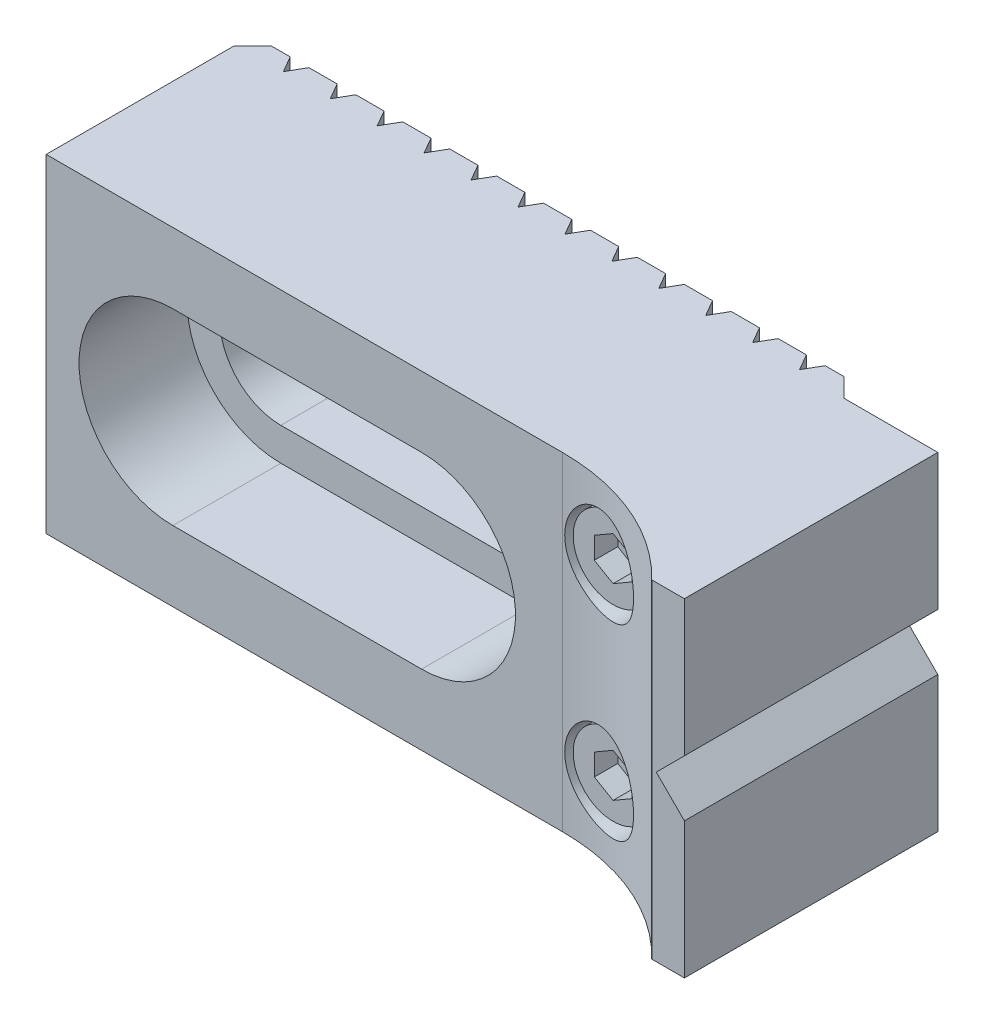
ISO-10303-21;
HEADER;
FILE_DESCRIPTION(('STEP AP214'),'2;1');
FILE_NAME('part.step','',(''),(''),'','','');
FILE_SCHEMA(('AUTOMOTIVE_DESIGN { 1 0 10303 214 1 1 1 1 }'));
ENDSEC;
DATA;
#1=APPLICATION_CONTEXT('core data for automotive mechanical design processes');
#2=APPLICATION_PROTOCOL_DEFINITION('international standard','automotive_design',2000,#1);
#3=PRODUCT_CONTEXT('',#1,'mechanical');
#4=PRODUCT('Part','Part','',(#3));
#5=PRODUCT_RELATED_PRODUCT_CATEGORY('part','',(#4));
#6=PRODUCT_DEFINITION_FORMATION('','',#4);
#7=PRODUCT_DEFINITION_CONTEXT('part definition',#1,'design');
#8=PRODUCT_DEFINITION('design','',#6,#7);
#9=PRODUCT_DEFINITION_SHAPE('','',#8);
#10=(LENGTH_UNIT() NAMED_UNIT(*) SI_UNIT(.MILLI.,.METRE.));
#11=(NAMED_UNIT(*) PLANE_ANGLE_UNIT() SI_UNIT($,.RADIAN.));
#12=(NAMED_UNIT(*) SI_UNIT($,.STERADIAN.) SOLID_ANGLE_UNIT());
#13=UNCERTAINTY_MEASURE_WITH_UNIT(LENGTH_MEASURE(1.E-05),#10,'distance_accuracy_value','');
#14=(GEOMETRIC_REPRESENTATION_CONTEXT(3) GLOBAL_UNCERTAINTY_ASSIGNED_CONTEXT((#13)) GLOBAL_UNIT_ASSIGNED_CONTEXT((#10,
#11,#12)) REPRESENTATION_CONTEXT('',''));
#15=CARTESIAN_POINT('',(0.,0.,0.));
#16=DIRECTION('',(0.,0.,1.));
#17=DIRECTION('',(1.,0.,0.));
#18=AXIS2_PLACEMENT_3D('',#15,#16,#17);
#19=CARTESIAN_POINT('',(-38.,17.5,0.));
#20=DIRECTION('',(0.,0.,-1.));
#21=DIRECTION('',(-1.,0.,0.));
#22=AXIS2_PLACEMENT_3D('',#19,#20,#21);
#23=PLANE('',#22);
#24=DIRECTION('',(0.,1.,0.));
#25=VECTOR('',#24,1.);
#26=CARTESIAN_POINT('',(19.001184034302,-17.5,0.));
#27=LINE('',#26,#25);
#28=CARTESIAN_POINT('',(19.0011840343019,12.2918042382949,0.));
#29=VERTEX_POINT('',#28);
#30=CARTESIAN_POINT('',(19.001184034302,17.5,0.));
#31=VERTEX_POINT('',#30);
#32=EDGE_CURVE('E789',#29,#31,#27,.T.);
#33=ORIENTED_EDGE('',*,*,#32,.F.);
#34=CARTESIAN_POINT('',(20.,10.,0.));
#35=DIRECTION('',(0.,0.,1.));
#36=DIRECTION('',(1.,0.,0.));
#37=AXIS2_PLACEMENT_3D('',#34,#35,#36);
#38=CIRCLE('',#37,2.5);
#39=CARTESIAN_POINT('',(19.0011840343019,7.70819576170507,0.));
#40=VERTEX_POINT('',#39);
#41=EDGE_CURVE('E655',#29,#40,#38,.T.);
#42=ORIENTED_EDGE('',*,*,#41,.T.);
#43=CARTESIAN_POINT('',(19.0011840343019,-7.70819576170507,0.));
#44=VERTEX_POINT('',#43);
#45=EDGE_CURVE('E795',#44,#40,#27,.T.);
#46=ORIENTED_EDGE('',*,*,#45,.F.);
#47=CARTESIAN_POINT('',(20.,-10.,0.));
#48=DIRECTION('',(0.,0.,1.));
#49=DIRECTION('',(1.,0.,0.));
#50=AXIS2_PLACEMENT_3D('',#47,#48,#49);
#51=CIRCLE('',#50,2.5);
#52=CARTESIAN_POINT('',(19.0011840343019,-12.2918042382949,0.));
#53=VERTEX_POINT('',#52);
#54=EDGE_CURVE('E663',#44,#53,#51,.T.);
#55=ORIENTED_EDGE('',*,*,#54,.T.);
#56=CARTESIAN_POINT('',(19.001184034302,-17.5,0.));
#57=VERTEX_POINT('',#56);
#58=EDGE_CURVE('E791',#57,#53,#27,.T.);
#59=ORIENTED_EDGE('',*,*,#58,.F.);
#60=DIRECTION('',(1.,0.,0.));
#61=VECTOR('',#60,1.);
#62=CARTESIAN_POINT('',(-38.,-17.5,0.));
#63=LINE('',#62,#61);
#64=CARTESIAN_POINT('',(15.9988159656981,-17.5,0.));
#65=VERTEX_POINT('',#64);
#66=EDGE_CURVE('E1407',#65,#57,#63,.T.);
#67=ORIENTED_EDGE('',*,*,#66,.F.);
#68=DIRECTION('',(0.,1.,0.));
#69=VECTOR('',#68,1.);
#70=CARTESIAN_POINT('',(15.9988159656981,-17.5,0.));
#71=LINE('',#70,#69);
#72=CARTESIAN_POINT('',(15.9988159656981,17.5,0.));
#73=VERTEX_POINT('',#72);
#74=EDGE_CURVE('E807',#65,#73,#71,.T.);
#75=ORIENTED_EDGE('',*,*,#74,.T.);
#76=DIRECTION('',(1.,0.,0.));
#77=VECTOR('',#76,1.);
#78=CARTESIAN_POINT('',(-38.,17.5,0.));
#79=LINE('',#78,#77);
#80=EDGE_CURVE('E1297',#73,#31,#79,.T.);
#81=ORIENTED_EDGE('',*,*,#80,.T.);
#82=EDGE_LOOP('',(#33,#42,#46,#55,#59,#67,#75,#81));
#83=FACE_BOUND('',#82,.T.);
#84=ADVANCED_FACE('F15',(#83),#23,.T.);
#85=DIRECTION('',(0.,1.,0.));
#86=VECTOR('',#85,1.);
#87=CARTESIAN_POINT('',(20.9988159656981,-17.5,0.));
#88=LINE('',#87,#86);
#89=CARTESIAN_POINT('',(20.9988159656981,-7.70819576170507,0.));
#90=VERTEX_POINT('',#89);
#91=CARTESIAN_POINT('',(20.9988159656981,7.70819576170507,0.));
#92=VERTEX_POINT('',#91);
#93=EDGE_CURVE('E790',#90,#92,#88,.T.);
#94=ORIENTED_EDGE('',*,*,#93,.T.);
#95=CARTESIAN_POINT('',(20.9988159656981,12.2918042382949,0.));
#96=VERTEX_POINT('',#95);
#97=EDGE_CURVE('E652',#92,#96,#38,.T.);
#98=ORIENTED_EDGE('',*,*,#97,.T.);
#99=CARTESIAN_POINT('',(20.9988159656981,17.5,0.));
#100=VERTEX_POINT('',#99);
#101=EDGE_CURVE('E784',#96,#100,#88,.T.);
#102=ORIENTED_EDGE('',*,*,#101,.T.);
#103=CARTESIAN_POINT('',(23.,17.5,0.));
#104=VERTEX_POINT('',#103);
#105=EDGE_CURVE('E1053',#100,#104,#79,.T.);
#106=ORIENTED_EDGE('',*,*,#105,.T.);
#107=DIRECTION('',(0.,-1.,0.));
#108=VECTOR('',#107,1.);
#109=CARTESIAN_POINT('',(23.,17.5,0.));
#110=LINE('',#109,#108);
#111=CARTESIAN_POINT('',(23.,-17.5,0.));
#112=VERTEX_POINT('',#111);
#113=EDGE_CURVE('E1065',#104,#112,#110,.T.);
#114=ORIENTED_EDGE('',*,*,#113,.T.);
#115=CARTESIAN_POINT('',(20.9988159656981,-17.5,0.));
#116=VERTEX_POINT('',#115);
#117=EDGE_CURVE('E1039',#116,#112,#63,.T.);
#118=ORIENTED_EDGE('',*,*,#117,.F.);
#119=CARTESIAN_POINT('',(20.9988159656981,-12.2918042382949,0.));
#120=VERTEX_POINT('',#119);
#121=EDGE_CURVE('E786',#116,#120,#88,.T.);
#122=ORIENTED_EDGE('',*,*,#121,.T.);
#123=EDGE_CURVE('E660',#120,#90,#51,.T.);
#124=ORIENTED_EDGE('',*,*,#123,.T.);
#125=EDGE_LOOP('',(#94,#98,#102,#106,#114,#118,#122,#124));
#126=FACE_BOUND('',#125,.T.);
#127=ADVANCED_FACE('F1226',(#126),#23,.T.);
#128=CARTESIAN_POINT('',(20.,-17.5,1.73));
#129=DIRECTION('',(0.866025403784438,0.,-0.5));
#130=DIRECTION('',(-0.5,0.,-0.866025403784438));
#131=AXIS2_PLACEMENT_3D('',#128,#129,#130);
#132=PLANE('',#131);
#133=DIRECTION('',(0.,1.,0.));
#134=VECTOR('',#133,1.);
#135=CARTESIAN_POINT('',(20.,-17.5,1.73));
#136=LINE('',#135,#134);
#137=CARTESIAN_POINT('',(20.,12.5,1.73));
#138=VERTEX_POINT('',#137);
#139=CARTESIAN_POINT('',(20.,17.5,1.73));
#140=VERTEX_POINT('',#139);
#141=EDGE_CURVE('E779',#138,#140,#136,.T.);
#142=ORIENTED_EDGE('',*,*,#141,.F.);
#143=CARTESIAN_POINT('',(20.,10.,1.73));
#144=DIRECTION('',(0.866025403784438,0.,-0.5));
#145=DIRECTION('',(0.5,0.,0.866025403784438));
#146=AXIS2_PLACEMENT_3D('',#143,#144,#145);
#147=ELLIPSE('',#146,5.,2.5);
#148=EDGE_CURVE('E659',#138,#29,#147,.F.);
#149=ORIENTED_EDGE('',*,*,#148,.T.);
#150=ORIENTED_EDGE('',*,*,#32,.T.);
#151=DIRECTION('',(-0.5,0.,-0.866025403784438));
#152=VECTOR('',#151,1.);
#153=CARTESIAN_POINT('',(20.,17.5,1.73));
#154=LINE('',#153,#152);
#155=EDGE_CURVE('E769',#140,#31,#154,.T.);
#156=ORIENTED_EDGE('',*,*,#155,.F.);
#157=EDGE_LOOP('',(#142,#149,#150,#156));
#158=FACE_BOUND('',#157,.T.);
#159=ADVANCED_FACE('F1234',(#158),#132,.T.);
#160=ORIENTED_EDGE('',*,*,#45,.T.);
#161=CARTESIAN_POINT('',(20.,7.5,1.73));
#162=VERTEX_POINT('',#161);
#163=EDGE_CURVE('E656',#40,#162,#147,.F.);
#164=ORIENTED_EDGE('',*,*,#163,.T.);
#165=CARTESIAN_POINT('',(20.,-7.5,1.73));
#166=VERTEX_POINT('',#165);
#167=EDGE_CURVE('E785',#166,#162,#136,.T.);
#168=ORIENTED_EDGE('',*,*,#167,.F.);
#169=CARTESIAN_POINT('',(20.,-10.,1.73));
#170=DIRECTION('',(0.866025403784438,0.,-0.5));
#171=DIRECTION('',(0.5,0.,0.866025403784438));
#172=AXIS2_PLACEMENT_3D('',#169,#170,#171);
#173=ELLIPSE('',#172,5.,2.5);
#174=EDGE_CURVE('E667',#166,#44,#173,.F.);
#175=ORIENTED_EDGE('',*,*,#174,.T.);
#176=EDGE_LOOP('',(#160,#164,#168,#175));
#177=FACE_BOUND('',#176,.T.);
#178=ADVANCED_FACE('F1429',(#177),#132,.T.);
#179=CARTESIAN_POINT('',(20.,-17.5,1.73));
#180=DIRECTION('',(0.866025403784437,0.,0.5));
#181=DIRECTION('',(0.5,0.,-0.866025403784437));
#182=AXIS2_PLACEMENT_3D('',#179,#180,#181);
#183=PLANE('',#182);
#184=CARTESIAN_POINT('',(20.,10.,1.73));
#185=DIRECTION('',(0.866025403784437,0.,0.5));
#186=DIRECTION('',(-0.5,0.,0.866025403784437));
#187=AXIS2_PLACEMENT_3D('',#184,#185,#186);
#188=ELLIPSE('',#187,5.,2.5);
#189=EDGE_CURVE('E1087',#138,#96,#188,.F.);
#190=ORIENTED_EDGE('',*,*,#189,.F.);
#191=ORIENTED_EDGE('',*,*,#141,.T.);
#192=DIRECTION('',(0.5,0.,-0.866025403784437));
#193=VECTOR('',#192,1.);
#194=CARTESIAN_POINT('',(20.,17.5,1.73));
#195=LINE('',#194,#193);
#196=EDGE_CURVE('E770',#140,#100,#195,.T.);
#197=ORIENTED_EDGE('',*,*,#196,.T.);
#198=ORIENTED_EDGE('',*,*,#101,.F.);
#199=EDGE_LOOP('',(#190,#191,#197,#198));
#200=FACE_BOUND('',#199,.T.);
#201=ADVANCED_FACE('F1440',(#200),#183,.F.);
#202=EDGE_CURVE('E1085',#92,#162,#188,.F.);
#203=ORIENTED_EDGE('',*,*,#202,.F.);
#204=ORIENTED_EDGE('',*,*,#93,.F.);
#205=CARTESIAN_POINT('',(20.,-10.,1.73));
#206=DIRECTION('',(0.866025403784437,0.,0.5));
#207=DIRECTION('',(-0.5,0.,0.866025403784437));
#208=AXIS2_PLACEMENT_3D('',#205,#206,#207);
#209=ELLIPSE('',#208,5.,2.5);
#210=EDGE_CURVE('E1084',#166,#90,#209,.F.);
#211=ORIENTED_EDGE('',*,*,#210,.F.);
#212=ORIENTED_EDGE('',*,*,#167,.T.);
#213=EDGE_LOOP('',(#203,#204,#211,#212));
#214=FACE_BOUND('',#213,.T.);
#215=ADVANCED_FACE('F1422',(#214),#183,.F.);
#216=ORIENTED_EDGE('',*,*,#58,.T.);
#217=CARTESIAN_POINT('',(20.,-12.5,1.73));
#218=VERTEX_POINT('',#217);
#219=EDGE_CURVE('E664',#53,#218,#173,.F.);
#220=ORIENTED_EDGE('',*,*,#219,.T.);
#221=CARTESIAN_POINT('',(20.,-17.5,1.73));
#222=VERTEX_POINT('',#221);
#223=EDGE_CURVE('E781',#222,#218,#136,.T.);
#224=ORIENTED_EDGE('',*,*,#223,.F.);
#225=DIRECTION('',(-0.5,0.,-0.866025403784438));
#226=VECTOR('',#225,1.);
#227=CARTESIAN_POINT('',(20.,-17.5,1.73));
#228=LINE('',#227,#226);
#229=EDGE_CURVE('E773',#222,#57,#228,.T.);
#230=ORIENTED_EDGE('',*,*,#229,.T.);
#231=EDGE_LOOP('',(#216,#220,#224,#230));
#232=FACE_BOUND('',#231,.T.);
#233=ADVANCED_FACE('F1448',(#232),#132,.T.);
#234=EDGE_CURVE('E1082',#120,#218,#209,.F.);
#235=ORIENTED_EDGE('',*,*,#234,.F.);
#236=ORIENTED_EDGE('',*,*,#121,.F.);
#237=DIRECTION('',(0.5,0.,-0.866025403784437));
#238=VECTOR('',#237,1.);
#239=CARTESIAN_POINT('',(20.,-17.5,1.73));
#240=LINE('',#239,#238);
#241=EDGE_CURVE('E776',#222,#116,#240,.T.);
#242=ORIENTED_EDGE('',*,*,#241,.F.);
#243=ORIENTED_EDGE('',*,*,#223,.T.);
#244=EDGE_LOOP('',(#235,#236,#242,#243));
#245=FACE_BOUND('',#244,.T.);
#246=ADVANCED_FACE('F1416',(#245),#183,.F.);
#247=CARTESIAN_POINT('',(0.,0.,0.));
#248=DIRECTION('',(0.,0.,1.));
#249=DIRECTION('',(1.,0.,0.));
#250=AXIS2_PLACEMENT_3D('',#247,#248,#249);
#251=CIRCLE('',#250,6.5);
#252=CARTESIAN_POINT('',(4.00118403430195,5.12255076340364,0.));
#253=VERTEX_POINT('',#252);
#254=CARTESIAN_POINT('',(0.998815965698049,6.42280053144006,0.));
#255=VERTEX_POINT('',#254);
#256=EDGE_CURVE('E680',#253,#255,#251,.T.);
#257=ORIENTED_EDGE('',*,*,#256,.T.);
#258=DIRECTION('',(0.,1.,0.));
#259=VECTOR('',#258,1.);
#260=CARTESIAN_POINT('',(0.998815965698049,-17.5,0.));
#261=LINE('',#260,#259);
#262=CARTESIAN_POINT('',(0.998815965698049,17.5,0.));
#263=VERTEX_POINT('',#262);
#264=EDGE_CURVE('E867',#255,#263,#261,.T.);
#265=ORIENTED_EDGE('',*,*,#264,.T.);
#266=CARTESIAN_POINT('',(4.00118403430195,17.5,0.));
#267=VERTEX_POINT('',#266);
#268=EDGE_CURVE('E1307',#263,#267,#79,.T.);
#269=ORIENTED_EDGE('',*,*,#268,.T.);
#270=DIRECTION('',(0.,1.,0.));
#271=VECTOR('',#270,1.);
#272=CARTESIAN_POINT('',(4.00118403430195,-17.5,0.));
#273=LINE('',#272,#271);
#274=EDGE_CURVE('E848',#253,#267,#273,.T.);
#275=ORIENTED_EDGE('',*,*,#274,.F.);
#276=EDGE_LOOP('',(#257,#265,#269,#275));
#277=FACE_BOUND('',#276,.T.);
#278=ADVANCED_FACE('F1236',(#277),#23,.T.);
#279=DIRECTION('',(0.,1.,0.));
#280=VECTOR('',#279,1.);
#281=CARTESIAN_POINT('',(-4.00118403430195,-17.5,0.));
#282=LINE('',#281,#280);
#283=CARTESIAN_POINT('',(-4.00118403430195,-17.5,0.));
#284=VERTEX_POINT('',#283);
#285=CARTESIAN_POINT('',(-4.00118403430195,-6.5,0.));
#286=VERTEX_POINT('',#285);
#287=EDGE_CURVE('E891',#284,#286,#282,.T.);
#288=ORIENTED_EDGE('',*,*,#287,.T.);
#289=DIRECTION('',(-1.,0.,0.));
#290=VECTOR('',#289,1.);
#291=CARTESIAN_POINT('',(0.,-6.5,0.));
#292=LINE('',#291,#290);
#293=CARTESIAN_POINT('',(-0.998815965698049,-6.5,0.));
#294=VERTEX_POINT('',#293);
#295=EDGE_CURVE('E671',#294,#286,#292,.T.);
#296=ORIENTED_EDGE('',*,*,#295,.F.);
#297=DIRECTION('',(0.,1.,0.));
#298=VECTOR('',#297,1.);
#299=CARTESIAN_POINT('',(-0.998815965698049,-17.5,0.));
#300=LINE('',#299,#298);
#301=CARTESIAN_POINT('',(-0.998815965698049,-17.5,0.));
#302=VERTEX_POINT('',#301);
#303=EDGE_CURVE('E872',#302,#294,#300,.T.);
#304=ORIENTED_EDGE('',*,*,#303,.F.);
#305=EDGE_CURVE('E1405',#284,#302,#63,.T.);
#306=ORIENTED_EDGE('',*,*,#305,.F.);
#307=EDGE_LOOP('',(#288,#296,#304,#306));
#308=FACE_BOUND('',#307,.T.);
#309=ADVANCED_FACE('F1457',(#308),#23,.T.);
#310=CARTESIAN_POINT('',(-0.998815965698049,6.5,0.));
#311=VERTEX_POINT('',#310);
#312=CARTESIAN_POINT('',(-0.998815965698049,17.5,0.));
#313=VERTEX_POINT('',#312);
#314=EDGE_CURVE('E871',#311,#313,#300,.T.);
#315=ORIENTED_EDGE('',*,*,#314,.F.);
#316=DIRECTION('',(1.,0.,0.));
#317=VECTOR('',#316,1.);
#318=CARTESIAN_POINT('',(-26.5,6.5,0.));
#319=LINE('',#318,#317);
#320=CARTESIAN_POINT('',(-4.00118403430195,6.5,0.));
#321=VERTEX_POINT('',#320);
#322=EDGE_CURVE('E679',#321,#311,#319,.T.);
#323=ORIENTED_EDGE('',*,*,#322,.F.);
#324=CARTESIAN_POINT('',(-4.00118403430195,17.5,0.));
#325=VERTEX_POINT('',#324);
#326=EDGE_CURVE('E890',#321,#325,#282,.T.);
#327=ORIENTED_EDGE('',*,*,#326,.T.);
#328=EDGE_CURVE('E1312',#325,#313,#79,.T.);
#329=ORIENTED_EDGE('',*,*,#328,.T.);
#330=EDGE_LOOP('',(#315,#323,#327,#329));
#331=FACE_BOUND('',#330,.T.);
#332=ADVANCED_FACE('F2463',(#331),#23,.T.);
#333=DIRECTION('',(0.,1.,0.));
#334=VECTOR('',#333,1.);
#335=CARTESIAN_POINT('',(-9.00118403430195,-17.5,0.));
#336=LINE('',#335,#334);
#337=CARTESIAN_POINT('',(-9.00118403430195,-17.5,0.));
#338=VERTEX_POINT('',#337);
#339=CARTESIAN_POINT('',(-9.00118403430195,-6.5,0.));
#340=VERTEX_POINT('',#339);
#341=EDGE_CURVE('E914',#338,#340,#336,.T.);
#342=ORIENTED_EDGE('',*,*,#341,.T.);
#343=CARTESIAN_POINT('',(-5.99881596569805,-6.5,0.));
#344=VERTEX_POINT('',#343);
#345=EDGE_CURVE('E2492',#344,#340,#292,.T.);
#346=ORIENTED_EDGE('',*,*,#345,.F.);
#347=DIRECTION('',(0.,1.,0.));
#348=VECTOR('',#347,1.);
#349=CARTESIAN_POINT('',(-5.99881596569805,-17.5,0.));
#350=LINE('',#349,#348);
#351=CARTESIAN_POINT('',(-5.99881596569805,-17.5,0.));
#352=VERTEX_POINT('',#351);
#353=EDGE_CURVE('E895',#352,#344,#350,.T.);
#354=ORIENTED_EDGE('',*,*,#353,.F.);
#355=EDGE_CURVE('E2489',#338,#352,#63,.T.);
#356=ORIENTED_EDGE('',*,*,#355,.F.);
#357=EDGE_LOOP('',(#342,#346,#354,#356));
#358=FACE_BOUND('',#357,.T.);
#359=ADVANCED_FACE('F2455',(#358),#23,.T.);
#360=CARTESIAN_POINT('',(-5.99881596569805,6.5,0.));
#361=VERTEX_POINT('',#360);
#362=CARTESIAN_POINT('',(-5.99881596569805,17.5,0.));
#363=VERTEX_POINT('',#362);
#364=EDGE_CURVE('E894',#361,#363,#350,.T.);
#365=ORIENTED_EDGE('',*,*,#364,.F.);
#366=CARTESIAN_POINT('',(-9.00118403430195,6.5,0.));
#367=VERTEX_POINT('',#366);
#368=EDGE_CURVE('E1374',#367,#361,#319,.T.);
#369=ORIENTED_EDGE('',*,*,#368,.F.);
#370=CARTESIAN_POINT('',(-9.00118403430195,17.5,0.));
#371=VERTEX_POINT('',#370);
#372=EDGE_CURVE('E913',#367,#371,#336,.T.);
#373=ORIENTED_EDGE('',*,*,#372,.T.);
#374=EDGE_CURVE('E1317',#371,#363,#79,.T.);
#375=ORIENTED_EDGE('',*,*,#374,.T.);
#376=EDGE_LOOP('',(#365,#369,#373,#375));
#377=FACE_BOUND('',#376,.T.);
#378=ADVANCED_FACE('F2446',(#377),#23,.T.);
#379=DIRECTION('',(0.,1.,0.));
#380=VECTOR('',#379,1.);
#381=CARTESIAN_POINT('',(-14.0011840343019,-17.5,0.));
#382=LINE('',#381,#380);
#383=CARTESIAN_POINT('',(-14.0011840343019,-17.5,0.));
#384=VERTEX_POINT('',#383);
#385=CARTESIAN_POINT('',(-14.0011840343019,-6.5,0.));
#386=VERTEX_POINT('',#385);
#387=EDGE_CURVE('E937',#384,#386,#382,.T.);
#388=ORIENTED_EDGE('',*,*,#387,.T.);
#389=CARTESIAN_POINT('',(-10.998815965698,-6.5,0.));
#390=VERTEX_POINT('',#389);
#391=EDGE_CURVE('E2494',#390,#386,#292,.T.);
#392=ORIENTED_EDGE('',*,*,#391,.F.);
#393=DIRECTION('',(0.,1.,0.));
#394=VECTOR('',#393,1.);
#395=CARTESIAN_POINT('',(-10.998815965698,-17.5,0.));
#396=LINE('',#395,#394);
#397=CARTESIAN_POINT('',(-10.998815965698,-17.5,0.));
#398=VERTEX_POINT('',#397);
#399=EDGE_CURVE('E918',#398,#390,#396,.T.);
#400=ORIENTED_EDGE('',*,*,#399,.F.);
#401=EDGE_CURVE('E2512',#384,#398,#63,.T.);
#402=ORIENTED_EDGE('',*,*,#401,.F.);
#403=EDGE_LOOP('',(#388,#392,#400,#402));
#404=FACE_BOUND('',#403,.T.);
#405=ADVANCED_FACE('F2438',(#404),#23,.T.);
#406=CARTESIAN_POINT('',(-10.998815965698,6.5,0.));
#407=VERTEX_POINT('',#406);
#408=CARTESIAN_POINT('',(-10.998815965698,17.5,0.));
#409=VERTEX_POINT('',#408);
#410=EDGE_CURVE('E917',#407,#409,#396,.T.);
#411=ORIENTED_EDGE('',*,*,#410,.F.);
#412=CARTESIAN_POINT('',(-14.0011840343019,6.5,0.));
#413=VERTEX_POINT('',#412);
#414=EDGE_CURVE('E1372',#413,#407,#319,.T.);
#415=ORIENTED_EDGE('',*,*,#414,.F.);
#416=CARTESIAN_POINT('',(-14.0011840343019,17.5,0.));
#417=VERTEX_POINT('',#416);
#418=EDGE_CURVE('E936',#413,#417,#382,.T.);
#419=ORIENTED_EDGE('',*,*,#418,.T.);
#420=EDGE_CURVE('E1322',#417,#409,#79,.T.);
#421=ORIENTED_EDGE('',*,*,#420,.T.);
#422=EDGE_LOOP('',(#411,#415,#419,#421));
#423=FACE_BOUND('',#422,.T.);
#424=ADVANCED_FACE('F2429',(#423),#23,.T.);
#425=DIRECTION('',(0.,1.,0.));
#426=VECTOR('',#425,1.);
#427=CARTESIAN_POINT('',(-19.001184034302,-17.5,0.));
#428=LINE('',#427,#426);
#429=CARTESIAN_POINT('',(-19.001184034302,-17.5,0.));
#430=VERTEX_POINT('',#429);
#431=CARTESIAN_POINT('',(-19.001184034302,-6.5,0.));
#432=VERTEX_POINT('',#431);
#433=EDGE_CURVE('E960',#430,#432,#428,.T.);
#434=ORIENTED_EDGE('',*,*,#433,.T.);
#435=CARTESIAN_POINT('',(-15.998815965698,-6.5,0.));
#436=VERTEX_POINT('',#435);
#437=EDGE_CURVE('E2495',#436,#432,#292,.T.);
#438=ORIENTED_EDGE('',*,*,#437,.F.);
#439=DIRECTION('',(0.,1.,0.));
#440=VECTOR('',#439,1.);
#441=CARTESIAN_POINT('',(-15.998815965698,-17.5,0.));
#442=LINE('',#441,#440);
#443=CARTESIAN_POINT('',(-15.998815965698,-17.5,0.));
#444=VERTEX_POINT('',#443);
#445=EDGE_CURVE('E941',#444,#436,#442,.T.);
#446=ORIENTED_EDGE('',*,*,#445,.F.);
#447=EDGE_CURVE('E2509',#430,#444,#63,.T.);
#448=ORIENTED_EDGE('',*,*,#447,.F.);
#449=EDGE_LOOP('',(#434,#438,#446,#448));
#450=FACE_BOUND('',#449,.T.);
#451=ADVANCED_FACE('F2421',(#450),#23,.T.);
#452=CARTESIAN_POINT('',(-15.998815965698,6.5,0.));
#453=VERTEX_POINT('',#452);
#454=CARTESIAN_POINT('',(-15.998815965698,17.5,0.));
#455=VERTEX_POINT('',#454);
#456=EDGE_CURVE('E940',#453,#455,#442,.T.);
#457=ORIENTED_EDGE('',*,*,#456,.F.);
#458=CARTESIAN_POINT('',(-19.001184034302,6.5,0.));
#459=VERTEX_POINT('',#458);
#460=EDGE_CURVE('E1371',#459,#453,#319,.T.);
#461=ORIENTED_EDGE('',*,*,#460,.F.);
#462=CARTESIAN_POINT('',(-19.001184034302,17.5,0.));
#463=VERTEX_POINT('',#462);
#464=EDGE_CURVE('E959',#459,#463,#428,.T.);
#465=ORIENTED_EDGE('',*,*,#464,.T.);
#466=EDGE_CURVE('E1327',#463,#455,#79,.T.);
#467=ORIENTED_EDGE('',*,*,#466,.T.);
#468=EDGE_LOOP('',(#457,#461,#465,#467));
#469=FACE_BOUND('',#468,.T.);
#470=ADVANCED_FACE('F2412',(#469),#23,.T.);
#471=DIRECTION('',(0.,1.,0.));
#472=VECTOR('',#471,1.);
#473=CARTESIAN_POINT('',(-24.001184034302,-17.5,0.));
#474=LINE('',#473,#472);
#475=CARTESIAN_POINT('',(-24.001184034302,-17.5,0.));
#476=VERTEX_POINT('',#475);
#477=CARTESIAN_POINT('',(-24.001184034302,-6.5,0.));
#478=VERTEX_POINT('',#477);
#479=EDGE_CURVE('E983',#476,#478,#474,.T.);
#480=ORIENTED_EDGE('',*,*,#479,.T.);
#481=CARTESIAN_POINT('',(-20.998815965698,-6.5,0.));
#482=VERTEX_POINT('',#481);
#483=EDGE_CURVE('E669',#482,#478,#292,.T.);
#484=ORIENTED_EDGE('',*,*,#483,.F.);
#485=DIRECTION('',(0.,1.,0.));
#486=VECTOR('',#485,1.);
#487=CARTESIAN_POINT('',(-20.998815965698,-17.5,0.));
#488=LINE('',#487,#486);
#489=CARTESIAN_POINT('',(-20.998815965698,-17.5,0.));
#490=VERTEX_POINT('',#489);
#491=EDGE_CURVE('E964',#490,#482,#488,.T.);
#492=ORIENTED_EDGE('',*,*,#491,.F.);
#493=EDGE_CURVE('E2506',#476,#490,#63,.T.);
#494=ORIENTED_EDGE('',*,*,#493,.F.);
#495=EDGE_LOOP('',(#480,#484,#492,#494));
#496=FACE_BOUND('',#495,.T.);
#497=ADVANCED_FACE('F2404',(#496),#23,.T.);
#498=CARTESIAN_POINT('',(-20.998815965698,6.5,0.));
#499=VERTEX_POINT('',#498);
#500=CARTESIAN_POINT('',(-20.998815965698,17.5,0.));
#501=VERTEX_POINT('',#500);
#502=EDGE_CURVE('E963',#499,#501,#488,.T.);
#503=ORIENTED_EDGE('',*,*,#502,.F.);
#504=CARTESIAN_POINT('',(-24.001184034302,6.5,0.));
#505=VERTEX_POINT('',#504);
#506=EDGE_CURVE('E678',#505,#499,#319,.T.);
#507=ORIENTED_EDGE('',*,*,#506,.F.);
#508=CARTESIAN_POINT('',(-24.001184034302,17.5,0.));
#509=VERTEX_POINT('',#508);
#510=EDGE_CURVE('E982',#505,#509,#474,.T.);
#511=ORIENTED_EDGE('',*,*,#510,.T.);
#512=EDGE_CURVE('E1332',#509,#501,#79,.T.);
#513=ORIENTED_EDGE('',*,*,#512,.T.);
#514=EDGE_LOOP('',(#503,#507,#511,#513));
#515=FACE_BOUND('',#514,.T.);
#516=ADVANCED_FACE('F1370',(#515),#23,.T.);
#517=CARTESIAN_POINT('',(-26.5,0.,0.));
#518=DIRECTION('',(0.,0.,1.));
#519=DIRECTION('',(1.,0.,0.));
#520=AXIS2_PLACEMENT_3D('',#517,#518,#519);
#521=CIRCLE('',#520,6.5);
#522=CARTESIAN_POINT('',(-29.001184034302,-5.99950651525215,0.));
#523=VERTEX_POINT('',#522);
#524=CARTESIAN_POINT('',(-26.5,-6.5,0.));
#525=VERTEX_POINT('',#524);
#526=EDGE_CURVE('E675',#523,#525,#521,.T.);
#527=ORIENTED_EDGE('',*,*,#526,.T.);
#528=CARTESIAN_POINT('',(-25.998815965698,-6.5,0.));
#529=VERTEX_POINT('',#528);
#530=EDGE_CURVE('E623',#529,#525,#292,.T.);
#531=ORIENTED_EDGE('',*,*,#530,.F.);
#532=DIRECTION('',(0.,1.,0.));
#533=VECTOR('',#532,1.);
#534=CARTESIAN_POINT('',(-25.998815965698,-17.5,0.));
#535=LINE('',#534,#533);
#536=CARTESIAN_POINT('',(-25.998815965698,-17.5,0.));
#537=VERTEX_POINT('',#536);
#538=EDGE_CURVE('E987',#537,#529,#535,.T.);
#539=ORIENTED_EDGE('',*,*,#538,.F.);
#540=CARTESIAN_POINT('',(-29.001184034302,-17.5,0.));
#541=VERTEX_POINT('',#540);
#542=EDGE_CURVE('E2508',#541,#537,#63,.T.);
#543=ORIENTED_EDGE('',*,*,#542,.F.);
#544=DIRECTION('',(0.,1.,0.));
#545=VECTOR('',#544,1.);
#546=CARTESIAN_POINT('',(-29.001184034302,-17.5,0.));
#547=LINE('',#546,#545);
#548=EDGE_CURVE('E1006',#541,#523,#547,.T.);
#549=ORIENTED_EDGE('',*,*,#548,.T.);
#550=EDGE_LOOP('',(#527,#531,#539,#543,#549));
#551=FACE_BOUND('',#550,.T.);
#552=ADVANCED_FACE('F1938',(#551),#23,.T.);
#553=CARTESIAN_POINT('',(-30.,-17.5,1.73));
#554=DIRECTION('',(0.866025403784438,0.,-0.5));
#555=DIRECTION('',(-0.5,0.,-0.866025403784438));
#556=AXIS2_PLACEMENT_3D('',#553,#554,#555);
#557=PLANE('',#556);
#558=CARTESIAN_POINT('',(-26.5,0.,7.79217782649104));
#559=DIRECTION('',(0.866025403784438,0.,-0.5));
#560=DIRECTION('',(0.5,0.,0.866025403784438));
#561=AXIS2_PLACEMENT_3D('',#558,#559,#560);
#562=ELLIPSE('',#561,13.,6.5);
#563=CARTESIAN_POINT('',(-30.,-5.47722557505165,1.73));
#564=VERTEX_POINT('',#563);
#565=CARTESIAN_POINT('',(-30.9988159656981,-4.69155143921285,0.));
#566=VERTEX_POINT('',#565);
#567=EDGE_CURVE('E748',#564,#566,#562,.T.);
#568=ORIENTED_EDGE('',*,*,#567,.F.);
#569=DIRECTION('',(0.,1.,0.));
#570=VECTOR('',#569,1.);
#571=CARTESIAN_POINT('',(-30.,-17.5,1.73));
#572=LINE('',#571,#570);
#573=CARTESIAN_POINT('',(-30.,-17.5,1.73));
#574=VERTEX_POINT('',#573);
#575=EDGE_CURVE('E1002',#574,#564,#572,.T.);
#576=ORIENTED_EDGE('',*,*,#575,.F.);
#577=DIRECTION('',(-0.5,0.,-0.866025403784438));
#578=VECTOR('',#577,1.);
#579=CARTESIAN_POINT('',(-30.,-17.5,1.73));
#580=LINE('',#579,#578);
#581=CARTESIAN_POINT('',(-30.9988159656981,-17.5,0.));
#582=VERTEX_POINT('',#581);
#583=EDGE_CURVE('E994',#574,#582,#580,.T.);
#584=ORIENTED_EDGE('',*,*,#583,.T.);
#585=DIRECTION('',(0.,1.,0.));
#586=VECTOR('',#585,1.);
#587=CARTESIAN_POINT('',(-30.9988159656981,-17.5,0.));
#588=LINE('',#587,#586);
#589=EDGE_CURVE('E1010',#582,#566,#588,.T.);
#590=ORIENTED_EDGE('',*,*,#589,.T.);
#591=EDGE_LOOP('',(#568,#576,#584,#590));
#592=FACE_BOUND('',#591,.T.);
#593=ADVANCED_FACE('F2088',(#592),#557,.T.);
#594=CARTESIAN_POINT('',(-30.,-17.5,1.73));
#595=DIRECTION('',(0.866025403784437,0.,0.5));
#596=DIRECTION('',(0.5,0.,-0.866025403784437));
#597=AXIS2_PLACEMENT_3D('',#594,#595,#596);
#598=PLANE('',#597);
#599=ORIENTED_EDGE('',*,*,#575,.T.);
#600=CARTESIAN_POINT('',(-26.5,0.,-4.33217782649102));
#601=DIRECTION('',(0.866025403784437,0.,0.5));
#602=DIRECTION('',(-0.5,0.,0.866025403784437));
#603=AXIS2_PLACEMENT_3D('',#600,#601,#602);
#604=ELLIPSE('',#603,13.,6.5);
#605=EDGE_CURVE('E1081',#564,#523,#604,.T.);
#606=ORIENTED_EDGE('',*,*,#605,.T.);
#607=ORIENTED_EDGE('',*,*,#548,.F.);
#608=DIRECTION('',(0.5,0.,-0.866025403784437));
#609=VECTOR('',#608,1.);
#610=CARTESIAN_POINT('',(-30.,-17.5,1.73));
#611=LINE('',#610,#609);
#612=EDGE_CURVE('E997',#574,#541,#611,.T.);
#613=ORIENTED_EDGE('',*,*,#612,.F.);
#614=EDGE_LOOP('',(#599,#606,#607,#613));
#615=FACE_BOUND('',#614,.T.);
#616=ADVANCED_FACE('F2080',(#615),#598,.F.);
#617=CARTESIAN_POINT('',(-25.,-17.5,1.73));
#618=DIRECTION('',(0.866025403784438,0.,-0.5));
#619=DIRECTION('',(-0.5,0.,-0.866025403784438));
#620=AXIS2_PLACEMENT_3D('',#617,#618,#619);
#621=PLANE('',#620);
#622=ORIENTED_EDGE('',*,*,#538,.T.);
#623=DIRECTION('',(0.5,0.,0.866025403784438));
#624=VECTOR('',#623,1.);
#625=CARTESIAN_POINT('',(-25.,-6.5,1.73));
#626=LINE('',#625,#624);
#627=CARTESIAN_POINT('',(-25.,-6.5,1.73));
#628=VERTEX_POINT('',#627);
#629=EDGE_CURVE('E743',#529,#628,#626,.T.);
#630=ORIENTED_EDGE('',*,*,#629,.T.);
#631=DIRECTION('',(0.,1.,0.));
#632=VECTOR('',#631,1.);
#633=CARTESIAN_POINT('',(-25.,-17.5,1.73));
#634=LINE('',#633,#632);
#635=CARTESIAN_POINT('',(-25.,-17.5,1.73));
#636=VERTEX_POINT('',#635);
#637=EDGE_CURVE('E979',#636,#628,#634,.T.);
#638=ORIENTED_EDGE('',*,*,#637,.F.);
#639=DIRECTION('',(-0.5,0.,-0.866025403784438));
#640=VECTOR('',#639,1.);
#641=CARTESIAN_POINT('',(-25.,-17.5,1.73));
#642=LINE('',#641,#640);
#643=EDGE_CURVE('E971',#636,#537,#642,.T.);
#644=ORIENTED_EDGE('',*,*,#643,.T.);
#645=EDGE_LOOP('',(#622,#630,#638,#644));
#646=FACE_BOUND('',#645,.T.);
#647=ADVANCED_FACE('F2363',(#646),#621,.T.);
#648=CARTESIAN_POINT('',(-25.,6.5,1.73));
#649=VERTEX_POINT('',#648);
#650=CARTESIAN_POINT('',(-25.,17.5,1.73));
#651=VERTEX_POINT('',#650);
#652=EDGE_CURVE('E977',#649,#651,#634,.T.);
#653=ORIENTED_EDGE('',*,*,#652,.F.);
#654=DIRECTION('',(-0.5,0.,-0.866025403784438));
#655=VECTOR('',#654,1.);
#656=CARTESIAN_POINT('',(-25.,6.5,1.73));
#657=LINE('',#656,#655);
#658=CARTESIAN_POINT('',(-25.998815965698,6.5,0.));
#659=VERTEX_POINT('',#658);
#660=EDGE_CURVE('E718',#649,#659,#657,.T.);
#661=ORIENTED_EDGE('',*,*,#660,.T.);
#662=CARTESIAN_POINT('',(-25.998815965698,17.5,0.));
#663=VERTEX_POINT('',#662);
#664=EDGE_CURVE('E986',#659,#663,#535,.T.);
#665=ORIENTED_EDGE('',*,*,#664,.T.);
#666=DIRECTION('',(-0.5,0.,-0.866025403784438));
#667=VECTOR('',#666,1.);
#668=CARTESIAN_POINT('',(-25.,17.5,1.73));
#669=LINE('',#668,#667);
#670=EDGE_CURVE('E967',#651,#663,#669,.T.);
#671=ORIENTED_EDGE('',*,*,#670,.F.);
#672=EDGE_LOOP('',(#653,#661,#665,#671));
#673=FACE_BOUND('',#672,.T.);
#674=ADVANCED_FACE('F1363',(#673),#621,.T.);
#675=CARTESIAN_POINT('',(-25.,-17.5,1.73));
#676=DIRECTION('',(0.866025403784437,0.,0.5));
#677=DIRECTION('',(0.5,0.,-0.866025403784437));
#678=AXIS2_PLACEMENT_3D('',#675,#676,#677);
#679=PLANE('',#678);
#680=DIRECTION('',(-0.5,0.,0.866025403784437));
#681=VECTOR('',#680,1.);
#682=CARTESIAN_POINT('',(-25.,-6.5,1.73));
#683=LINE('',#682,#681);
#684=EDGE_CURVE('E741',#478,#628,#683,.T.);
#685=ORIENTED_EDGE('',*,*,#684,.F.);
#686=ORIENTED_EDGE('',*,*,#479,.F.);
#687=DIRECTION('',(0.5,0.,-0.866025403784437));
#688=VECTOR('',#687,1.);
#689=CARTESIAN_POINT('',(-25.,-17.5,1.73));
#690=LINE('',#689,#688);
#691=EDGE_CURVE('E974',#636,#476,#690,.T.);
#692=ORIENTED_EDGE('',*,*,#691,.F.);
#693=ORIENTED_EDGE('',*,*,#637,.T.);
#694=EDGE_LOOP('',(#685,#686,#692,#693));
#695=FACE_BOUND('',#694,.T.);
#696=ADVANCED_FACE('F2346',(#695),#679,.F.);
#697=DIRECTION('',(0.5,0.,-0.866025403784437));
#698=VECTOR('',#697,1.);
#699=CARTESIAN_POINT('',(-25.,6.5,1.73));
#700=LINE('',#699,#698);
#701=EDGE_CURVE('E716',#649,#505,#700,.T.);
#702=ORIENTED_EDGE('',*,*,#701,.F.);
#703=ORIENTED_EDGE('',*,*,#652,.T.);
#704=DIRECTION('',(0.5,0.,-0.866025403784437));
#705=VECTOR('',#704,1.);
#706=CARTESIAN_POINT('',(-25.,17.5,1.73));
#707=LINE('',#706,#705);
#708=EDGE_CURVE('E968',#651,#509,#707,.T.);
#709=ORIENTED_EDGE('',*,*,#708,.T.);
#710=ORIENTED_EDGE('',*,*,#510,.F.);
#711=EDGE_LOOP('',(#702,#703,#709,#710));
#712=FACE_BOUND('',#711,.T.);
#713=ADVANCED_FACE('F1367',(#712),#679,.F.);
#714=CARTESIAN_POINT('',(-20.,-17.5,1.73));
#715=DIRECTION('',(0.866025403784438,0.,-0.5));
#716=DIRECTION('',(-0.5,0.,-0.866025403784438));
#717=AXIS2_PLACEMENT_3D('',#714,#715,#716);
#718=PLANE('',#717);
#719=ORIENTED_EDGE('',*,*,#491,.T.);
#720=DIRECTION('',(0.5,0.,0.866025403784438));
#721=VECTOR('',#720,1.);
#722=CARTESIAN_POINT('',(-20.,-6.5,1.73));
#723=LINE('',#722,#721);
#724=CARTESIAN_POINT('',(-20.,-6.5,1.73));
#725=VERTEX_POINT('',#724);
#726=EDGE_CURVE('E738',#482,#725,#723,.T.);
#727=ORIENTED_EDGE('',*,*,#726,.T.);
#728=DIRECTION('',(0.,1.,0.));
#729=VECTOR('',#728,1.);
#730=CARTESIAN_POINT('',(-20.,-17.5,1.73));
#731=LINE('',#730,#729);
#732=CARTESIAN_POINT('',(-20.,-17.5,1.73));
#733=VERTEX_POINT('',#732);
#734=EDGE_CURVE('E956',#733,#725,#731,.T.);
#735=ORIENTED_EDGE('',*,*,#734,.F.);
#736=DIRECTION('',(-0.5,0.,-0.866025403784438));
#737=VECTOR('',#736,1.);
#738=CARTESIAN_POINT('',(-20.,-17.5,1.73));
#739=LINE('',#738,#737);
#740=EDGE_CURVE('E948',#733,#490,#739,.T.);
#741=ORIENTED_EDGE('',*,*,#740,.T.);
#742=EDGE_LOOP('',(#719,#727,#735,#741));
#743=FACE_BOUND('',#742,.T.);
#744=ADVANCED_FACE('F2328',(#743),#718,.T.);
#745=CARTESIAN_POINT('',(-20.,6.5,1.73));
#746=VERTEX_POINT('',#745);
#747=CARTESIAN_POINT('',(-20.,17.5,1.73));
#748=VERTEX_POINT('',#747);
#749=EDGE_CURVE('E954',#746,#748,#731,.T.);
#750=ORIENTED_EDGE('',*,*,#749,.F.);
#751=DIRECTION('',(-0.5,0.,-0.866025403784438));
#752=VECTOR('',#751,1.);
#753=CARTESIAN_POINT('',(-20.,6.5,1.73));
#754=LINE('',#753,#752);
#755=EDGE_CURVE('E713',#746,#499,#754,.T.);
#756=ORIENTED_EDGE('',*,*,#755,.T.);
#757=ORIENTED_EDGE('',*,*,#502,.T.);
#758=DIRECTION('',(-0.5,0.,-0.866025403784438));
#759=VECTOR('',#758,1.);
#760=CARTESIAN_POINT('',(-20.,17.5,1.73));
#761=LINE('',#760,#759);
#762=EDGE_CURVE('E944',#748,#501,#761,.T.);
#763=ORIENTED_EDGE('',*,*,#762,.F.);
#764=EDGE_LOOP('',(#750,#756,#757,#763));
#765=FACE_BOUND('',#764,.T.);
#766=ADVANCED_FACE('F2319',(#765),#718,.T.);
#767=CARTESIAN_POINT('',(-20.,-17.5,1.73));
#768=DIRECTION('',(0.866025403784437,0.,0.5));
#769=DIRECTION('',(0.5,0.,-0.866025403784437));
#770=AXIS2_PLACEMENT_3D('',#767,#768,#769);
#771=PLANE('',#770);
#772=DIRECTION('',(-0.5,0.,0.866025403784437));
#773=VECTOR('',#772,1.);
#774=CARTESIAN_POINT('',(-20.,-6.5,1.73));
#775=LINE('',#774,#773);
#776=EDGE_CURVE('E736',#432,#725,#775,.T.);
#777=ORIENTED_EDGE('',*,*,#776,.F.);
#778=ORIENTED_EDGE('',*,*,#433,.F.);
#779=DIRECTION('',(0.5,0.,-0.866025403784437));
#780=VECTOR('',#779,1.);
#781=CARTESIAN_POINT('',(-20.,-17.5,1.73));
#782=LINE('',#781,#780);
#783=EDGE_CURVE('E951',#733,#430,#782,.T.);
#784=ORIENTED_EDGE('',*,*,#783,.F.);
#785=ORIENTED_EDGE('',*,*,#734,.T.);
#786=EDGE_LOOP('',(#777,#778,#784,#785));
#787=FACE_BOUND('',#786,.T.);
#788=ADVANCED_FACE('F2309',(#787),#771,.F.);
#789=DIRECTION('',(0.5,0.,-0.866025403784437));
#790=VECTOR('',#789,1.);
#791=CARTESIAN_POINT('',(-20.,6.5,1.73));
#792=LINE('',#791,#790);
#793=EDGE_CURVE('E711',#746,#459,#792,.T.);
#794=ORIENTED_EDGE('',*,*,#793,.F.);
#795=ORIENTED_EDGE('',*,*,#749,.T.);
#796=DIRECTION('',(0.5,0.,-0.866025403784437));
#797=VECTOR('',#796,1.);
#798=CARTESIAN_POINT('',(-20.,17.5,1.73));
#799=LINE('',#798,#797);
#800=EDGE_CURVE('E945',#748,#463,#799,.T.);
#801=ORIENTED_EDGE('',*,*,#800,.T.);
#802=ORIENTED_EDGE('',*,*,#464,.F.);
#803=EDGE_LOOP('',(#794,#795,#801,#802));
#804=FACE_BOUND('',#803,.T.);
#805=ADVANCED_FACE('F2300',(#804),#771,.F.);
#806=CARTESIAN_POINT('',(-15.,-17.5,1.73));
#807=DIRECTION('',(0.866025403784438,0.,-0.5));
#808=DIRECTION('',(-0.5,0.,-0.866025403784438));
#809=AXIS2_PLACEMENT_3D('',#806,#807,#808);
#810=PLANE('',#809);
#811=ORIENTED_EDGE('',*,*,#445,.T.);
#812=DIRECTION('',(0.5,0.,0.866025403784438));
#813=VECTOR('',#812,1.);
#814=CARTESIAN_POINT('',(-15.,-6.5,1.73));
#815=LINE('',#814,#813);
#816=CARTESIAN_POINT('',(-15.,-6.5,1.73));
#817=VERTEX_POINT('',#816);
#818=EDGE_CURVE('E733',#436,#817,#815,.T.);
#819=ORIENTED_EDGE('',*,*,#818,.T.);
#820=DIRECTION('',(0.,1.,0.));
#821=VECTOR('',#820,1.);
#822=CARTESIAN_POINT('',(-15.,-17.5,1.73));
#823=LINE('',#822,#821);
#824=CARTESIAN_POINT('',(-15.,-17.5,1.73));
#825=VERTEX_POINT('',#824);
#826=EDGE_CURVE('E933',#825,#817,#823,.T.);
#827=ORIENTED_EDGE('',*,*,#826,.F.);
#828=DIRECTION('',(-0.5,0.,-0.866025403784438));
#829=VECTOR('',#828,1.);
#830=CARTESIAN_POINT('',(-15.,-17.5,1.73));
#831=LINE('',#830,#829);
#832=EDGE_CURVE('E925',#825,#444,#831,.T.);
#833=ORIENTED_EDGE('',*,*,#832,.T.);
#834=EDGE_LOOP('',(#811,#819,#827,#833));
#835=FACE_BOUND('',#834,.T.);
#836=ADVANCED_FACE('F2290',(#835),#810,.T.);
#837=CARTESIAN_POINT('',(-15.,6.5,1.73));
#838=VERTEX_POINT('',#837);
#839=CARTESIAN_POINT('',(-15.,17.5,1.73));
#840=VERTEX_POINT('',#839);
#841=EDGE_CURVE('E931',#838,#840,#823,.T.);
#842=ORIENTED_EDGE('',*,*,#841,.F.);
#843=DIRECTION('',(-0.5,0.,-0.866025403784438));
#844=VECTOR('',#843,1.);
#845=CARTESIAN_POINT('',(-15.,6.5,1.73));
#846=LINE('',#845,#844);
#847=EDGE_CURVE('E708',#838,#453,#846,.T.);
#848=ORIENTED_EDGE('',*,*,#847,.T.);
#849=ORIENTED_EDGE('',*,*,#456,.T.);
#850=DIRECTION('',(-0.5,0.,-0.866025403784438));
#851=VECTOR('',#850,1.);
#852=CARTESIAN_POINT('',(-15.,17.5,1.73));
#853=LINE('',#852,#851);
#854=EDGE_CURVE('E921',#840,#455,#853,.T.);
#855=ORIENTED_EDGE('',*,*,#854,.F.);
#856=EDGE_LOOP('',(#842,#848,#849,#855));
#857=FACE_BOUND('',#856,.T.);
#858=ADVANCED_FACE('F2281',(#857),#810,.T.);
#859=CARTESIAN_POINT('',(-15.,-17.5,1.73));
#860=DIRECTION('',(0.866025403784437,0.,0.5));
#861=DIRECTION('',(0.5,0.,-0.866025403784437));
#862=AXIS2_PLACEMENT_3D('',#859,#860,#861);
#863=PLANE('',#862);
#864=DIRECTION('',(-0.5,0.,0.866025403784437));
#865=VECTOR('',#864,1.);
#866=CARTESIAN_POINT('',(-15.,-6.5,1.73));
#867=LINE('',#866,#865);
#868=EDGE_CURVE('E731',#386,#817,#867,.T.);
#869=ORIENTED_EDGE('',*,*,#868,.F.);
#870=ORIENTED_EDGE('',*,*,#387,.F.);
#871=DIRECTION('',(0.5,0.,-0.866025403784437));
#872=VECTOR('',#871,1.);
#873=CARTESIAN_POINT('',(-15.,-17.5,1.73));
#874=LINE('',#873,#872);
#875=EDGE_CURVE('E928',#825,#384,#874,.T.);
#876=ORIENTED_EDGE('',*,*,#875,.F.);
#877=ORIENTED_EDGE('',*,*,#826,.T.);
#878=EDGE_LOOP('',(#869,#870,#876,#877));
#879=FACE_BOUND('',#878,.T.);
#880=ADVANCED_FACE('F2271',(#879),#863,.F.);
#881=DIRECTION('',(0.5,0.,-0.866025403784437));
#882=VECTOR('',#881,1.);
#883=CARTESIAN_POINT('',(-15.,6.5,1.73));
#884=LINE('',#883,#882);
#885=EDGE_CURVE('E706',#838,#413,#884,.T.);
#886=ORIENTED_EDGE('',*,*,#885,.F.);
#887=ORIENTED_EDGE('',*,*,#841,.T.);
#888=DIRECTION('',(0.5,0.,-0.866025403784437));
#889=VECTOR('',#888,1.);
#890=CARTESIAN_POINT('',(-15.,17.5,1.73));
#891=LINE('',#890,#889);
#892=EDGE_CURVE('E922',#840,#417,#891,.T.);
#893=ORIENTED_EDGE('',*,*,#892,.T.);
#894=ORIENTED_EDGE('',*,*,#418,.F.);
#895=EDGE_LOOP('',(#886,#887,#893,#894));
#896=FACE_BOUND('',#895,.T.);
#897=ADVANCED_FACE('F2262',(#896),#863,.F.);
#898=CARTESIAN_POINT('',(-10.,-17.5,1.73));
#899=DIRECTION('',(0.866025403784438,0.,-0.5));
#900=DIRECTION('',(-0.5,0.,-0.866025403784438));
#901=AXIS2_PLACEMENT_3D('',#898,#899,#900);
#902=PLANE('',#901);
#903=ORIENTED_EDGE('',*,*,#399,.T.);
#904=DIRECTION('',(0.5,0.,0.866025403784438));
#905=VECTOR('',#904,1.);
#906=CARTESIAN_POINT('',(-10.,-6.5,1.73));
#907=LINE('',#906,#905);
#908=CARTESIAN_POINT('',(-10.,-6.5,1.73));
#909=VERTEX_POINT('',#908);
#910=EDGE_CURVE('E728',#390,#909,#907,.T.);
#911=ORIENTED_EDGE('',*,*,#910,.T.);
#912=DIRECTION('',(0.,1.,0.));
#913=VECTOR('',#912,1.);
#914=CARTESIAN_POINT('',(-10.,-17.5,1.73));
#915=LINE('',#914,#913);
#916=CARTESIAN_POINT('',(-10.,-17.5,1.73));
#917=VERTEX_POINT('',#916);
#918=EDGE_CURVE('E910',#917,#909,#915,.T.);
#919=ORIENTED_EDGE('',*,*,#918,.F.);
#920=DIRECTION('',(-0.5,0.,-0.866025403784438));
#921=VECTOR('',#920,1.);
#922=CARTESIAN_POINT('',(-10.,-17.5,1.73));
#923=LINE('',#922,#921);
#924=EDGE_CURVE('E902',#917,#398,#923,.T.);
#925=ORIENTED_EDGE('',*,*,#924,.T.);
#926=EDGE_LOOP('',(#903,#911,#919,#925));
#927=FACE_BOUND('',#926,.T.);
#928=ADVANCED_FACE('F2252',(#927),#902,.T.);
#929=CARTESIAN_POINT('',(-10.,6.5,1.73));
#930=VERTEX_POINT('',#929);
#931=CARTESIAN_POINT('',(-10.,17.5,1.73));
#932=VERTEX_POINT('',#931);
#933=EDGE_CURVE('E908',#930,#932,#915,.T.);
#934=ORIENTED_EDGE('',*,*,#933,.F.);
#935=DIRECTION('',(-0.5,0.,-0.866025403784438));
#936=VECTOR('',#935,1.);
#937=CARTESIAN_POINT('',(-10.,6.5,1.73));
#938=LINE('',#937,#936);
#939=EDGE_CURVE('E703',#930,#407,#938,.T.);
#940=ORIENTED_EDGE('',*,*,#939,.T.);
#941=ORIENTED_EDGE('',*,*,#410,.T.);
#942=DIRECTION('',(-0.5,0.,-0.866025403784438));
#943=VECTOR('',#942,1.);
#944=CARTESIAN_POINT('',(-10.,17.5,1.73));
#945=LINE('',#944,#943);
#946=EDGE_CURVE('E898',#932,#409,#945,.T.);
#947=ORIENTED_EDGE('',*,*,#946,.F.);
#948=EDGE_LOOP('',(#934,#940,#941,#947));
#949=FACE_BOUND('',#948,.T.);
#950=ADVANCED_FACE('F2243',(#949),#902,.T.);
#951=CARTESIAN_POINT('',(-10.,-17.5,1.73));
#952=DIRECTION('',(0.866025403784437,0.,0.5));
#953=DIRECTION('',(0.5,0.,-0.866025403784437));
#954=AXIS2_PLACEMENT_3D('',#951,#952,#953);
#955=PLANE('',#954);
#956=DIRECTION('',(-0.5,0.,0.866025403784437));
#957=VECTOR('',#956,1.);
#958=CARTESIAN_POINT('',(-10.,-6.5,1.73));
#959=LINE('',#958,#957);
#960=EDGE_CURVE('E726',#340,#909,#959,.T.);
#961=ORIENTED_EDGE('',*,*,#960,.F.);
#962=ORIENTED_EDGE('',*,*,#341,.F.);
#963=DIRECTION('',(0.5,0.,-0.866025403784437));
#964=VECTOR('',#963,1.);
#965=CARTESIAN_POINT('',(-10.,-17.5,1.73));
#966=LINE('',#965,#964);
#967=EDGE_CURVE('E905',#917,#338,#966,.T.);
#968=ORIENTED_EDGE('',*,*,#967,.F.);
#969=ORIENTED_EDGE('',*,*,#918,.T.);
#970=EDGE_LOOP('',(#961,#962,#968,#969));
#971=FACE_BOUND('',#970,.T.);
#972=ADVANCED_FACE('F2233',(#971),#955,.F.);
#973=DIRECTION('',(0.5,0.,-0.866025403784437));
#974=VECTOR('',#973,1.);
#975=CARTESIAN_POINT('',(-10.,6.5,1.73));
#976=LINE('',#975,#974);
#977=EDGE_CURVE('E701',#930,#367,#976,.T.);
#978=ORIENTED_EDGE('',*,*,#977,.F.);
#979=ORIENTED_EDGE('',*,*,#933,.T.);
#980=DIRECTION('',(0.5,0.,-0.866025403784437));
#981=VECTOR('',#980,1.);
#982=CARTESIAN_POINT('',(-10.,17.5,1.73));
#983=LINE('',#982,#981);
#984=EDGE_CURVE('E899',#932,#371,#983,.T.);
#985=ORIENTED_EDGE('',*,*,#984,.T.);
#986=ORIENTED_EDGE('',*,*,#372,.F.);
#987=EDGE_LOOP('',(#978,#979,#985,#986));
#988=FACE_BOUND('',#987,.T.);
#989=ADVANCED_FACE('F2224',(#988),#955,.F.);
#990=CARTESIAN_POINT('',(-5.,-17.5,1.73));
#991=DIRECTION('',(0.866025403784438,0.,-0.5));
#992=DIRECTION('',(-0.5,0.,-0.866025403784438));
#993=AXIS2_PLACEMENT_3D('',#990,#991,#992);
#994=PLANE('',#993);
#995=ORIENTED_EDGE('',*,*,#353,.T.);
#996=DIRECTION('',(0.5,0.,0.866025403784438));
#997=VECTOR('',#996,1.);
#998=CARTESIAN_POINT('',(-5.,-6.5,1.73));
#999=LINE('',#998,#997);
#1000=CARTESIAN_POINT('',(-5.,-6.5,1.73));
#1001=VERTEX_POINT('',#1000);
#1002=EDGE_CURVE('E723',#344,#1001,#999,.T.);
#1003=ORIENTED_EDGE('',*,*,#1002,.T.);
#1004=DIRECTION('',(0.,1.,0.));
#1005=VECTOR('',#1004,1.);
#1006=CARTESIAN_POINT('',(-5.,-17.5,1.73));
#1007=LINE('',#1006,#1005);
#1008=CARTESIAN_POINT('',(-5.,-17.5,1.73));
#1009=VERTEX_POINT('',#1008);
#1010=EDGE_CURVE('E887',#1009,#1001,#1007,.T.);
#1011=ORIENTED_EDGE('',*,*,#1010,.F.);
#1012=DIRECTION('',(-0.5,0.,-0.866025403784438));
#1013=VECTOR('',#1012,1.);
#1014=CARTESIAN_POINT('',(-5.,-17.5,1.73));
#1015=LINE('',#1014,#1013);
#1016=EDGE_CURVE('E879',#1009,#352,#1015,.T.);
#1017=ORIENTED_EDGE('',*,*,#1016,.T.);
#1018=EDGE_LOOP('',(#995,#1003,#1011,#1017));
#1019=FACE_BOUND('',#1018,.T.);
#1020=ADVANCED_FACE('F2214',(#1019),#994,.T.);
#1021=CARTESIAN_POINT('',(-5.,6.5,1.73));
#1022=VERTEX_POINT('',#1021);
#1023=CARTESIAN_POINT('',(-5.,17.5,1.73));
#1024=VERTEX_POINT('',#1023);
#1025=EDGE_CURVE('E885',#1022,#1024,#1007,.T.);
#1026=ORIENTED_EDGE('',*,*,#1025,.F.);
#1027=DIRECTION('',(-0.5,0.,-0.866025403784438));
#1028=VECTOR('',#1027,1.);
#1029=CARTESIAN_POINT('',(-5.,6.5,1.73));
#1030=LINE('',#1029,#1028);
#1031=EDGE_CURVE('E698',#1022,#361,#1030,.T.);
#1032=ORIENTED_EDGE('',*,*,#1031,.T.);
#1033=ORIENTED_EDGE('',*,*,#364,.T.);
#1034=DIRECTION('',(-0.5,0.,-0.866025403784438));
#1035=VECTOR('',#1034,1.);
#1036=CARTESIAN_POINT('',(-5.,17.5,1.73));
#1037=LINE('',#1036,#1035);
#1038=EDGE_CURVE('E875',#1024,#363,#1037,.T.);
#1039=ORIENTED_EDGE('',*,*,#1038,.F.);
#1040=EDGE_LOOP('',(#1026,#1032,#1033,#1039));
#1041=FACE_BOUND('',#1040,.T.);
#1042=ADVANCED_FACE('F2205',(#1041),#994,.T.);
#1043=CARTESIAN_POINT('',(-5.,-17.5,1.73));
#1044=DIRECTION('',(0.866025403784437,0.,0.5));
#1045=DIRECTION('',(0.5,0.,-0.866025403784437));
#1046=AXIS2_PLACEMENT_3D('',#1043,#1044,#1045);
#1047=PLANE('',#1046);
#1048=DIRECTION('',(-0.5,0.,0.866025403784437));
#1049=VECTOR('',#1048,1.);
#1050=CARTESIAN_POINT('',(-5.,-6.5,1.73));
#1051=LINE('',#1050,#1049);
#1052=EDGE_CURVE('E721',#286,#1001,#1051,.T.);
#1053=ORIENTED_EDGE('',*,*,#1052,.F.);
#1054=ORIENTED_EDGE('',*,*,#287,.F.);
#1055=DIRECTION('',(0.5,0.,-0.866025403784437));
#1056=VECTOR('',#1055,1.);
#1057=CARTESIAN_POINT('',(-5.,-17.5,1.73));
#1058=LINE('',#1057,#1056);
#1059=EDGE_CURVE('E882',#1009,#284,#1058,.T.);
#1060=ORIENTED_EDGE('',*,*,#1059,.F.);
#1061=ORIENTED_EDGE('',*,*,#1010,.T.);
#1062=EDGE_LOOP('',(#1053,#1054,#1060,#1061));
#1063=FACE_BOUND('',#1062,.T.);
#1064=ADVANCED_FACE('F2195',(#1063),#1047,.F.);
#1065=DIRECTION('',(0.5,0.,-0.866025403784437));
#1066=VECTOR('',#1065,1.);
#1067=CARTESIAN_POINT('',(-5.,6.5,1.73));
#1068=LINE('',#1067,#1066);
#1069=EDGE_CURVE('E696',#1022,#321,#1068,.T.);
#1070=ORIENTED_EDGE('',*,*,#1069,.F.);
#1071=ORIENTED_EDGE('',*,*,#1025,.T.);
#1072=DIRECTION('',(0.5,0.,-0.866025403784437));
#1073=VECTOR('',#1072,1.);
#1074=CARTESIAN_POINT('',(-5.,17.5,1.73));
#1075=LINE('',#1074,#1073);
#1076=EDGE_CURVE('E876',#1024,#325,#1075,.T.);
#1077=ORIENTED_EDGE('',*,*,#1076,.T.);
#1078=ORIENTED_EDGE('',*,*,#326,.F.);
#1079=EDGE_LOOP('',(#1070,#1071,#1077,#1078));
#1080=FACE_BOUND('',#1079,.T.);
#1081=ADVANCED_FACE('F2186',(#1080),#1047,.F.);
#1082=CARTESIAN_POINT('',(0.,-17.5,1.73));
#1083=DIRECTION('',(0.866025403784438,0.,-0.5));
#1084=DIRECTION('',(-0.5,0.,-0.866025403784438));
#1085=AXIS2_PLACEMENT_3D('',#1082,#1083,#1084);
#1086=PLANE('',#1085);
#1087=ORIENTED_EDGE('',*,*,#303,.T.);
#1088=DIRECTION('',(0.5,0.,0.866025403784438));
#1089=VECTOR('',#1088,1.);
#1090=CARTESIAN_POINT('',(0.,-6.5,1.73));
#1091=LINE('',#1090,#1089);
#1092=CARTESIAN_POINT('',(0.,-6.5,1.73));
#1093=VERTEX_POINT('',#1092);
#1094=EDGE_CURVE('E1075',#294,#1093,#1091,.T.);
#1095=ORIENTED_EDGE('',*,*,#1094,.T.);
#1096=DIRECTION('',(0.,1.,0.));
#1097=VECTOR('',#1096,1.);
#1098=CARTESIAN_POINT('',(0.,-17.5,1.73));
#1099=LINE('',#1098,#1097);
#1100=CARTESIAN_POINT('',(0.,-17.5,1.73));
#1101=VERTEX_POINT('',#1100);
#1102=EDGE_CURVE('E864',#1101,#1093,#1099,.T.);
#1103=ORIENTED_EDGE('',*,*,#1102,.F.);
#1104=DIRECTION('',(-0.5,0.,-0.866025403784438));
#1105=VECTOR('',#1104,1.);
#1106=CARTESIAN_POINT('',(0.,-17.5,1.73));
#1107=LINE('',#1106,#1105);
#1108=EDGE_CURVE('E856',#1101,#302,#1107,.T.);
#1109=ORIENTED_EDGE('',*,*,#1108,.T.);
#1110=EDGE_LOOP('',(#1087,#1095,#1103,#1109));
#1111=FACE_BOUND('',#1110,.T.);
#1112=ADVANCED_FACE('F2177',(#1111),#1086,.T.);
#1113=CARTESIAN_POINT('',(0.,6.5,1.73));
#1114=VERTEX_POINT('',#1113);
#1115=CARTESIAN_POINT('',(0.,17.5,1.73));
#1116=VERTEX_POINT('',#1115);
#1117=EDGE_CURVE('E862',#1114,#1116,#1099,.T.);
#1118=ORIENTED_EDGE('',*,*,#1117,.F.);
#1119=DIRECTION('',(-0.5,0.,-0.866025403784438));
#1120=VECTOR('',#1119,1.);
#1121=CARTESIAN_POINT('',(0.,6.5,1.73));
#1122=LINE('',#1121,#1120);
#1123=EDGE_CURVE('E1072',#1114,#311,#1122,.T.);
#1124=ORIENTED_EDGE('',*,*,#1123,.T.);
#1125=ORIENTED_EDGE('',*,*,#314,.T.);
#1126=DIRECTION('',(-0.5,0.,-0.866025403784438));
#1127=VECTOR('',#1126,1.);
#1128=CARTESIAN_POINT('',(0.,17.5,1.73));
#1129=LINE('',#1128,#1127);
#1130=EDGE_CURVE('E852',#1116,#313,#1129,.T.);
#1131=ORIENTED_EDGE('',*,*,#1130,.F.);
#1132=EDGE_LOOP('',(#1118,#1124,#1125,#1131));
#1133=FACE_BOUND('',#1132,.T.);
#1134=ADVANCED_FACE('F2168',(#1133),#1086,.T.);
#1135=CARTESIAN_POINT('',(0.,-17.5,1.73));
#1136=DIRECTION('',(0.866025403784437,0.,0.5));
#1137=DIRECTION('',(0.5,0.,-0.866025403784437));
#1138=AXIS2_PLACEMENT_3D('',#1135,#1136,#1137);
#1139=PLANE('',#1138);
#1140=ORIENTED_EDGE('',*,*,#1102,.T.);
#1141=CARTESIAN_POINT('',(0.,0.,1.73));
#1142=DIRECTION('',(0.866025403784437,0.,0.5));
#1143=DIRECTION('',(-0.5,0.,0.866025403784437));
#1144=AXIS2_PLACEMENT_3D('',#1141,#1142,#1143);
#1145=ELLIPSE('',#1144,13.,6.5);
#1146=CARTESIAN_POINT('',(0.998815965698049,-6.42280053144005,0.));
#1147=VERTEX_POINT('',#1146);
#1148=EDGE_CURVE('E695',#1093,#1147,#1145,.T.);
#1149=ORIENTED_EDGE('',*,*,#1148,.T.);
#1150=CARTESIAN_POINT('',(0.998815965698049,-17.5,0.));
#1151=VERTEX_POINT('',#1150);
#1152=EDGE_CURVE('E868',#1151,#1147,#261,.T.);
#1153=ORIENTED_EDGE('',*,*,#1152,.F.);
#1154=DIRECTION('',(0.5,0.,-0.866025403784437));
#1155=VECTOR('',#1154,1.);
#1156=CARTESIAN_POINT('',(0.,-17.5,1.73));
#1157=LINE('',#1156,#1155);
#1158=EDGE_CURVE('E859',#1101,#1151,#1157,.T.);
#1159=ORIENTED_EDGE('',*,*,#1158,.F.);
#1160=EDGE_LOOP('',(#1140,#1149,#1153,#1159));
#1161=FACE_BOUND('',#1160,.T.);
#1162=ADVANCED_FACE('F1959',(#1161),#1139,.F.);
#1163=CARTESIAN_POINT('',(5.,-17.5,1.73));
#1164=DIRECTION('',(0.866025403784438,0.,-0.5));
#1165=DIRECTION('',(-0.5,0.,-0.866025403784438));
#1166=AXIS2_PLACEMENT_3D('',#1163,#1164,#1165);
#1167=PLANE('',#1166);
#1168=CARTESIAN_POINT('',(0.,0.,-6.93025403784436));
#1169=DIRECTION('',(0.866025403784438,0.,-0.5));
#1170=DIRECTION('',(0.5,0.,0.866025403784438));
#1171=AXIS2_PLACEMENT_3D('',#1168,#1169,#1170);
#1172=ELLIPSE('',#1171,13.,6.5);
#1173=CARTESIAN_POINT('',(5.,-4.15331193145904,1.73));
#1174=VERTEX_POINT('',#1173);
#1175=CARTESIAN_POINT('',(4.00118403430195,-5.12255076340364,0.));
#1176=VERTEX_POINT('',#1175);
#1177=EDGE_CURVE('E691',#1174,#1176,#1172,.T.);
#1178=ORIENTED_EDGE('',*,*,#1177,.F.);
#1179=DIRECTION('',(0.,1.,0.));
#1180=VECTOR('',#1179,1.);
#1181=CARTESIAN_POINT('',(5.,-17.5,1.73));
#1182=LINE('',#1181,#1180);
#1183=CARTESIAN_POINT('',(5.,-17.5,1.73));
#1184=VERTEX_POINT('',#1183);
#1185=EDGE_CURVE('E841',#1184,#1174,#1182,.T.);
#1186=ORIENTED_EDGE('',*,*,#1185,.F.);
#1187=DIRECTION('',(-0.5,0.,-0.866025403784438));
#1188=VECTOR('',#1187,1.);
#1189=CARTESIAN_POINT('',(5.,-17.5,1.73));
#1190=LINE('',#1189,#1188);
#1191=CARTESIAN_POINT('',(4.00118403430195,-17.5,0.));
#1192=VERTEX_POINT('',#1191);
#1193=EDGE_CURVE('E833',#1184,#1192,#1190,.T.);
#1194=ORIENTED_EDGE('',*,*,#1193,.T.);
#1195=EDGE_CURVE('E849',#1192,#1176,#273,.T.);
#1196=ORIENTED_EDGE('',*,*,#1195,.T.);
#1197=EDGE_LOOP('',(#1178,#1186,#1194,#1196));
#1198=FACE_BOUND('',#1197,.T.);
#1199=ADVANCED_FACE('F1952',(#1198),#1167,.T.);
#1200=CARTESIAN_POINT('',(5.,-17.5,1.73));
#1201=DIRECTION('',(0.866025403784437,0.,0.5));
#1202=DIRECTION('',(0.5,0.,-0.866025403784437));
#1203=AXIS2_PLACEMENT_3D('',#1200,#1201,#1202);
#1204=PLANE('',#1203);
#1205=ORIENTED_EDGE('',*,*,#1185,.T.);
#1206=CARTESIAN_POINT('',(0.,0.,10.3902540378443));
#1207=DIRECTION('',(0.866025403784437,0.,0.5));
#1208=DIRECTION('',(-0.5,0.,0.866025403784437));
#1209=AXIS2_PLACEMENT_3D('',#1206,#1207,#1208);
#1210=ELLIPSE('',#1209,13.,6.5);
#1211=CARTESIAN_POINT('',(5.9988159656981,-2.50283978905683,0.));
#1212=VERTEX_POINT('',#1211);
#1213=EDGE_CURVE('E1071',#1174,#1212,#1210,.T.);
#1214=ORIENTED_EDGE('',*,*,#1213,.T.);
#1215=DIRECTION('',(0.,1.,0.));
#1216=VECTOR('',#1215,1.);
#1217=CARTESIAN_POINT('',(5.9988159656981,-17.5,0.));
#1218=LINE('',#1217,#1216);
#1219=CARTESIAN_POINT('',(5.9988159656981,-17.5,0.));
#1220=VERTEX_POINT('',#1219);
#1221=EDGE_CURVE('E845',#1220,#1212,#1218,.T.);
#1222=ORIENTED_EDGE('',*,*,#1221,.F.);
#1223=DIRECTION('',(0.5,0.,-0.866025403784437));
#1224=VECTOR('',#1223,1.);
#1225=CARTESIAN_POINT('',(5.,-17.5,1.73));
#1226=LINE('',#1225,#1224);
#1227=EDGE_CURVE('E836',#1184,#1220,#1226,.T.);
#1228=ORIENTED_EDGE('',*,*,#1227,.F.);
#1229=EDGE_LOOP('',(#1205,#1214,#1222,#1228));
#1230=FACE_BOUND('',#1229,.T.);
#1231=ADVANCED_FACE('F1947',(#1230),#1204,.F.);
#1232=CARTESIAN_POINT('',(0.,0.,9.));
#1233=DIRECTION('',(0.,0.,1.));
#1234=DIRECTION('',(1.,0.,0.));
#1235=AXIS2_PLACEMENT_3D('',#1232,#1233,#1234);
#1236=CYLINDRICAL_SURFACE('',#1235,10.);
#1237=DIRECTION('',(0.,0.,1.));
#1238=VECTOR('',#1237,1.);
#1239=CARTESIAN_POINT('',(0.,10.,9.));
#1240=LINE('',#1239,#1238);
#1241=CARTESIAN_POINT('',(0.,10.,10.5));
#1242=VERTEX_POINT('',#1241);
#1243=CARTESIAN_POINT('',(0.,10.,22.));
#1244=VERTEX_POINT('',#1243);
#1245=EDGE_CURVE('E752',#1242,#1244,#1240,.T.);
#1246=ORIENTED_EDGE('',*,*,#1245,.F.);
#1247=CARTESIAN_POINT('',(0.,0.,10.5));
#1248=DIRECTION('',(0.,0.,1.));
#1249=DIRECTION('',(1.,0.,0.));
#1250=AXIS2_PLACEMENT_3D('',#1247,#1248,#1249);
#1251=CIRCLE('',#1250,10.);
#1252=CARTESIAN_POINT('',(0.,-10.,10.5));
#1253=VERTEX_POINT('',#1252);
#1254=EDGE_CURVE('E31',#1253,#1242,#1251,.T.);
#1255=ORIENTED_EDGE('',*,*,#1254,.F.);
#1256=DIRECTION('',(0.,0.,1.));
#1257=VECTOR('',#1256,1.);
#1258=CARTESIAN_POINT('',(0.,-10.,9.));
#1259=LINE('',#1258,#1257);
#1260=CARTESIAN_POINT('',(0.,-10.,22.));
#1261=VERTEX_POINT('',#1260);
#1262=EDGE_CURVE('E767',#1253,#1261,#1259,.T.);
#1263=ORIENTED_EDGE('',*,*,#1262,.T.);
#1264=CARTESIAN_POINT('',(0.,0.,22.));
#1265=DIRECTION('',(0.,0.,1.));
#1266=DIRECTION('',(1.,0.,0.));
#1267=AXIS2_PLACEMENT_3D('',#1264,#1265,#1266);
#1268=CIRCLE('',#1267,10.);
#1269=EDGE_CURVE('E759',#1261,#1244,#1268,.T.);
#1270=ORIENTED_EDGE('',*,*,#1269,.T.);
#1271=EDGE_LOOP('',(#1246,#1255,#1263,#1270));
#1272=FACE_BOUND('',#1271,.T.);
#1273=ADVANCED_FACE('F1918',(#1272),#1236,.F.);
#1274=CARTESIAN_POINT('',(0.,-10.,9.));
#1275=DIRECTION('',(0.,1.,0.));
#1276=DIRECTION('',(-1.,0.,0.));
#1277=AXIS2_PLACEMENT_3D('',#1274,#1275,#1276);
#1278=PLANE('',#1277);
#1279=DIRECTION('',(1.,0.,0.));
#1280=VECTOR('',#1279,1.);
#1281=CARTESIAN_POINT('',(-26.5,-10.,10.5));
#1282=LINE('',#1281,#1280);
#1283=CARTESIAN_POINT('',(-26.5,-10.,10.5));
#1284=VERTEX_POINT('',#1283);
#1285=EDGE_CURVE('E650',#1284,#1253,#1282,.T.);
#1286=ORIENTED_EDGE('',*,*,#1285,.F.);
#1287=DIRECTION('',(0.,0.,1.));
#1288=VECTOR('',#1287,1.);
#1289=CARTESIAN_POINT('',(-26.5,-10.,9.));
#1290=LINE('',#1289,#1288);
#1291=CARTESIAN_POINT('',(-26.5,-10.,22.));
#1292=VERTEX_POINT('',#1291);
#1293=EDGE_CURVE('E765',#1284,#1292,#1290,.T.);
#1294=ORIENTED_EDGE('',*,*,#1293,.T.);
#1295=DIRECTION('',(-1.,0.,0.));
#1296=VECTOR('',#1295,1.);
#1297=CARTESIAN_POINT('',(0.,-10.,22.));
#1298=LINE('',#1297,#1296);
#1299=EDGE_CURVE('E749',#1261,#1292,#1298,.T.);
#1300=ORIENTED_EDGE('',*,*,#1299,.F.);
#1301=ORIENTED_EDGE('',*,*,#1262,.F.);
#1302=EDGE_LOOP('',(#1286,#1294,#1300,#1301));
#1303=FACE_BOUND('',#1302,.T.);
#1304=ADVANCED_FACE('F1922',(#1303),#1278,.T.);
#1305=CARTESIAN_POINT('',(-26.5,0.,9.));
#1306=DIRECTION('',(0.,0.,1.));
#1307=DIRECTION('',(1.,0.,0.));
#1308=AXIS2_PLACEMENT_3D('',#1305,#1306,#1307);
#1309=CYLINDRICAL_SURFACE('',#1308,10.);
#1310=ORIENTED_EDGE('',*,*,#1293,.F.);
#1311=CARTESIAN_POINT('',(-26.5,0.,10.5));
#1312=DIRECTION('',(0.,0.,1.));
#1313=DIRECTION('',(1.,0.,0.));
#1314=AXIS2_PLACEMENT_3D('',#1311,#1312,#1313);
#1315=CIRCLE('',#1314,10.);
#1316=CARTESIAN_POINT('',(-26.5,10.,10.5));
#1317=VERTEX_POINT('',#1316);
#1318=EDGE_CURVE('E648',#1317,#1284,#1315,.T.);
#1319=ORIENTED_EDGE('',*,*,#1318,.F.);
#1320=DIRECTION('',(0.,0.,1.));
#1321=VECTOR('',#1320,1.);
#1322=CARTESIAN_POINT('',(-26.5,10.,9.));
#1323=LINE('',#1322,#1321);
#1324=CARTESIAN_POINT('',(-26.5,10.,22.));
#1325=VERTEX_POINT('',#1324);
#1326=EDGE_CURVE('E763',#1317,#1325,#1323,.T.);
#1327=ORIENTED_EDGE('',*,*,#1326,.T.);
#1328=CARTESIAN_POINT('',(-26.5,0.,22.));
#1329=DIRECTION('',(0.,0.,1.));
#1330=DIRECTION('',(1.,0.,0.));
#1331=AXIS2_PLACEMENT_3D('',#1328,#1329,#1330);
#1332=CIRCLE('',#1331,10.);
#1333=EDGE_CURVE('E753',#1325,#1292,#1332,.T.);
#1334=ORIENTED_EDGE('',*,*,#1333,.T.);
#1335=EDGE_LOOP('',(#1310,#1319,#1327,#1334));
#1336=FACE_BOUND('',#1335,.T.);
#1337=ADVANCED_FACE('F1926',(#1336),#1309,.F.);
#1338=CARTESIAN_POINT('',(0.,10.,9.));
#1339=DIRECTION('',(0.,1.,0.));
#1340=DIRECTION('',(-1.,0.,0.));
#1341=AXIS2_PLACEMENT_3D('',#1338,#1339,#1340);
#1342=PLANE('',#1341);
#1343=ORIENTED_EDGE('',*,*,#1326,.F.);
#1344=DIRECTION('',(-1.,0.,0.));
#1345=VECTOR('',#1344,1.);
#1346=CARTESIAN_POINT('',(0.,10.,10.5));
#1347=LINE('',#1346,#1345);
#1348=EDGE_CURVE('E646',#1242,#1317,#1347,.T.);
#1349=ORIENTED_EDGE('',*,*,#1348,.F.);
#1350=ORIENTED_EDGE('',*,*,#1245,.T.);
#1351=DIRECTION('',(-1.,0.,0.));
#1352=VECTOR('',#1351,1.);
#1353=CARTESIAN_POINT('',(0.,10.,22.));
#1354=LINE('',#1353,#1352);
#1355=EDGE_CURVE('E756',#1244,#1325,#1354,.T.);
#1356=ORIENTED_EDGE('',*,*,#1355,.T.);
#1357=EDGE_LOOP('',(#1343,#1349,#1350,#1356));
#1358=FACE_BOUND('',#1357,.T.);
#1359=ADVANCED_FACE('F1929',(#1358),#1342,.F.);
#1360=CARTESIAN_POINT('',(10.9988159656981,17.5,0.));
#1361=VERTEX_POINT('',#1360);
#1362=CARTESIAN_POINT('',(14.0011840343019,17.5,0.));
#1363=VERTEX_POINT('',#1362);
#1364=EDGE_CURVE('E1299',#1361,#1363,#79,.T.);
#1365=ORIENTED_EDGE('',*,*,#1364,.T.);
#1366=DIRECTION('',(0.,1.,0.));
#1367=VECTOR('',#1366,1.);
#1368=CARTESIAN_POINT('',(14.0011840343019,-17.5,0.));
#1369=LINE('',#1368,#1367);
#1370=CARTESIAN_POINT('',(14.0011840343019,-17.5,0.));
#1371=VERTEX_POINT('',#1370);
#1372=EDGE_CURVE('E810',#1371,#1363,#1369,.T.);
#1373=ORIENTED_EDGE('',*,*,#1372,.F.);
#1374=CARTESIAN_POINT('',(10.9988159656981,-17.5,0.));
#1375=VERTEX_POINT('',#1374);
#1376=EDGE_CURVE('E1403',#1375,#1371,#63,.T.);
#1377=ORIENTED_EDGE('',*,*,#1376,.F.);
#1378=DIRECTION('',(0.,1.,0.));
#1379=VECTOR('',#1378,1.);
#1380=CARTESIAN_POINT('',(10.9988159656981,-17.5,0.));
#1381=LINE('',#1380,#1379);
#1382=EDGE_CURVE('E824',#1375,#1361,#1381,.T.);
#1383=ORIENTED_EDGE('',*,*,#1382,.T.);
#1384=EDGE_LOOP('',(#1365,#1373,#1377,#1383));
#1385=FACE_BOUND('',#1384,.T.);
#1386=ADVANCED_FACE('F1931',(#1385),#23,.T.);
#1387=CARTESIAN_POINT('',(5.9988159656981,2.50283978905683,0.));
#1388=VERTEX_POINT('',#1387);
#1389=EDGE_CURVE('E683',#1212,#1388,#251,.T.);
#1390=ORIENTED_EDGE('',*,*,#1389,.T.);
#1391=CARTESIAN_POINT('',(5.9988159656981,17.5,0.));
#1392=VERTEX_POINT('',#1391);
#1393=EDGE_CURVE('E844',#1388,#1392,#1218,.T.);
#1394=ORIENTED_EDGE('',*,*,#1393,.T.);
#1395=CARTESIAN_POINT('',(9.0011840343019,17.5,0.));
#1396=VERTEX_POINT('',#1395);
#1397=EDGE_CURVE('E1302',#1392,#1396,#79,.T.);
#1398=ORIENTED_EDGE('',*,*,#1397,.T.);
#1399=DIRECTION('',(0.,1.,0.));
#1400=VECTOR('',#1399,1.);
#1401=CARTESIAN_POINT('',(9.0011840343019,-17.5,0.));
#1402=LINE('',#1401,#1400);
#1403=CARTESIAN_POINT('',(9.0011840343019,-17.5,0.));
#1404=VERTEX_POINT('',#1403);
#1405=EDGE_CURVE('E827',#1404,#1396,#1402,.T.);
#1406=ORIENTED_EDGE('',*,*,#1405,.F.);
#1407=EDGE_CURVE('E1399',#1220,#1404,#63,.T.);
#1408=ORIENTED_EDGE('',*,*,#1407,.F.);
#1409=ORIENTED_EDGE('',*,*,#1221,.T.);
#1410=EDGE_LOOP('',(#1390,#1394,#1398,#1406,#1408,#1409));
#1411=FACE_BOUND('',#1410,.T.);
#1412=ADVANCED_FACE('F1383',(#1411),#23,.T.);
#1413=EDGE_CURVE('E684',#1147,#1176,#251,.T.);
#1414=ORIENTED_EDGE('',*,*,#1413,.T.);
#1415=ORIENTED_EDGE('',*,*,#1195,.F.);
#1416=EDGE_CURVE('E1402',#1151,#1192,#63,.T.);
#1417=ORIENTED_EDGE('',*,*,#1416,.F.);
#1418=ORIENTED_EDGE('',*,*,#1152,.T.);
#1419=EDGE_LOOP('',(#1414,#1415,#1417,#1418));
#1420=FACE_BOUND('',#1419,.T.);
#1421=ADVANCED_FACE('F2116',(#1420),#23,.T.);
#1422=CARTESIAN_POINT('',(-26.5,6.5,0.));
#1423=VERTEX_POINT('',#1422);
#1424=CARTESIAN_POINT('',(-29.001184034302,5.99950651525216,0.));
#1425=VERTEX_POINT('',#1424);
#1426=EDGE_CURVE('E670',#1423,#1425,#521,.T.);
#1427=ORIENTED_EDGE('',*,*,#1426,.T.);
#1428=CARTESIAN_POINT('',(-29.001184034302,17.5,0.));
#1429=VERTEX_POINT('',#1428);
#1430=EDGE_CURVE('E1005',#1425,#1429,#547,.T.);
#1431=ORIENTED_EDGE('',*,*,#1430,.T.);
#1432=EDGE_CURVE('E1337',#1429,#663,#79,.T.);
#1433=ORIENTED_EDGE('',*,*,#1432,.T.);
#1434=ORIENTED_EDGE('',*,*,#664,.F.);
#1435=EDGE_CURVE('E676',#1423,#659,#319,.T.);
#1436=ORIENTED_EDGE('',*,*,#1435,.F.);
#1437=EDGE_LOOP('',(#1427,#1431,#1433,#1434,#1436));
#1438=FACE_BOUND('',#1437,.T.);
#1439=ADVANCED_FACE('F1251',(#1438),#23,.T.);
#1440=CARTESIAN_POINT('',(-30.9988159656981,4.69155143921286,0.));
#1441=VERTEX_POINT('',#1440);
#1442=EDGE_CURVE('E674',#1441,#566,#521,.T.);
#1443=ORIENTED_EDGE('',*,*,#1442,.T.);
#1444=ORIENTED_EDGE('',*,*,#589,.F.);
#1445=CARTESIAN_POINT('',(-34.001184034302,-17.5,0.));
#1446=VERTEX_POINT('',#1445);
#1447=EDGE_CURVE('E1038',#1446,#582,#63,.T.);
#1448=ORIENTED_EDGE('',*,*,#1447,.F.);
#1449=DIRECTION('',(0.,1.,0.));
#1450=VECTOR('',#1449,1.);
#1451=CARTESIAN_POINT('',(-34.001184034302,-17.5,0.));
#1452=LINE('',#1451,#1450);
#1453=CARTESIAN_POINT('',(-34.001184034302,17.5,0.));
#1454=VERTEX_POINT('',#1453);
#1455=EDGE_CURVE('E1025',#1446,#1454,#1452,.T.);
#1456=ORIENTED_EDGE('',*,*,#1455,.T.);
#1457=CARTESIAN_POINT('',(-30.9988159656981,17.5,0.));
#1458=VERTEX_POINT('',#1457);
#1459=EDGE_CURVE('E1052',#1454,#1458,#79,.T.);
#1460=ORIENTED_EDGE('',*,*,#1459,.T.);
#1461=EDGE_CURVE('E1009',#1441,#1458,#588,.T.);
#1462=ORIENTED_EDGE('',*,*,#1461,.F.);
#1463=EDGE_LOOP('',(#1443,#1444,#1448,#1456,#1460,#1462));
#1464=FACE_BOUND('',#1463,.T.);
#1465=ADVANCED_FACE('F1242',(#1464),#23,.T.);
#1466=CARTESIAN_POINT('',(-38.,17.5,0.));
#1467=VERTEX_POINT('',#1466);
#1468=CARTESIAN_POINT('',(-35.998815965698,17.5,0.));
#1469=VERTEX_POINT('',#1468);
#1470=EDGE_CURVE('E1049',#1467,#1469,#79,.T.);
#1471=ORIENTED_EDGE('',*,*,#1470,.T.);
#1472=DIRECTION('',(0.,1.,0.));
#1473=VECTOR('',#1472,1.);
#1474=CARTESIAN_POINT('',(-35.998815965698,-17.5,0.));
#1475=LINE('',#1474,#1473);
#1476=CARTESIAN_POINT('',(-35.998815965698,-17.5,0.));
#1477=VERTEX_POINT('',#1476);
#1478=EDGE_CURVE('E1028',#1477,#1469,#1475,.T.);
#1479=ORIENTED_EDGE('',*,*,#1478,.F.);
#1480=CARTESIAN_POINT('',(-38.,-17.5,0.));
#1481=VERTEX_POINT('',#1480);
#1482=EDGE_CURVE('E1035',#1481,#1477,#63,.T.);
#1483=ORIENTED_EDGE('',*,*,#1482,.F.);
#1484=DIRECTION('',(0.,-1.,0.));
#1485=VECTOR('',#1484,1.);
#1486=CARTESIAN_POINT('',(-38.,17.5,0.));
#1487=LINE('',#1486,#1485);
#1488=EDGE_CURVE('E1063',#1467,#1481,#1487,.T.);
#1489=ORIENTED_EDGE('',*,*,#1488,.F.);
#1490=EDGE_LOOP('',(#1471,#1479,#1483,#1489));
#1491=FACE_BOUND('',#1490,.T.);
#1492=ADVANCED_FACE('F1229',(#1491),#23,.T.);
#1493=CARTESIAN_POINT('',(25.,17.5,2.));
#1494=DIRECTION('',(-0.707106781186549,0.,0.707106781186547));
#1495=DIRECTION('',(0.707106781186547,0.,0.707106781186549));
#1496=AXIS2_PLACEMENT_3D('',#1493,#1494,#1495);
#1497=PLANE('',#1496);
#1498=ORIENTED_EDGE('',*,*,#113,.F.);
#1499=DIRECTION('',(-0.707106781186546,0.,-0.707106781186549));
#1500=VECTOR('',#1499,1.);
#1501=CARTESIAN_POINT('',(25.,17.5,2.));
#1502=LINE('',#1501,#1500);
#1503=CARTESIAN_POINT('',(25.,17.5,2.));
#1504=VERTEX_POINT('',#1503);
#1505=EDGE_CURVE('E1045',#1504,#104,#1502,.T.);
#1506=ORIENTED_EDGE('',*,*,#1505,.F.);
#1507=DIRECTION('',(0.,-1.,0.));
#1508=VECTOR('',#1507,1.);
#1509=CARTESIAN_POINT('',(25.,17.5,2.));
#1510=LINE('',#1509,#1508);
#1511=CARTESIAN_POINT('',(25.,-17.5,2.));
#1512=VERTEX_POINT('',#1511);
#1513=EDGE_CURVE('E1139',#1504,#1512,#1510,.T.);
#1514=ORIENTED_EDGE('',*,*,#1513,.T.);
#1515=DIRECTION('',(-0.707106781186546,0.,-0.707106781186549));
#1516=VECTOR('',#1515,1.);
#1517=CARTESIAN_POINT('',(25.,-17.5,2.));
#1518=LINE('',#1517,#1516);
#1519=EDGE_CURVE('E1031',#1512,#112,#1518,.T.);
#1520=ORIENTED_EDGE('',*,*,#1519,.T.);
#1521=EDGE_LOOP('',(#1498,#1506,#1514,#1520));
#1522=FACE_BOUND('',#1521,.T.);
#1523=ADVANCED_FACE('F1241',(#1522),#1497,.F.);
#1524=CARTESIAN_POINT('',(-38.,17.5,0.));
#1525=DIRECTION('',(0.707106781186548,0.,0.707106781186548));
#1526=DIRECTION('',(0.707106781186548,0.,-0.707106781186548));
#1527=AXIS2_PLACEMENT_3D('',#1524,#1525,#1526);
#1528=PLANE('',#1527);
#1529=DIRECTION('',(0.,-1.,0.));
#1530=VECTOR('',#1529,1.);
#1531=CARTESIAN_POINT('',(-40.,17.5,2.));
#1532=LINE('',#1531,#1530);
#1533=CARTESIAN_POINT('',(-40.,17.5,2.));
#1534=VERTEX_POINT('',#1533);
#1535=CARTESIAN_POINT('',(-40.,-17.5,2.));
#1536=VERTEX_POINT('',#1535);
#1537=EDGE_CURVE('E1061',#1534,#1536,#1532,.T.);
#1538=ORIENTED_EDGE('',*,*,#1537,.F.);
#1539=DIRECTION('',(-0.707106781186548,0.,0.707106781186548));
#1540=VECTOR('',#1539,1.);
#1541=CARTESIAN_POINT('',(-38.,17.5,0.));
#1542=LINE('',#1541,#1540);
#1543=EDGE_CURVE('E1054',#1467,#1534,#1542,.T.);
#1544=ORIENTED_EDGE('',*,*,#1543,.F.);
#1545=ORIENTED_EDGE('',*,*,#1488,.T.);
#1546=DIRECTION('',(-0.707106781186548,0.,0.707106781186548));
#1547=VECTOR('',#1546,1.);
#1548=CARTESIAN_POINT('',(-38.,-17.5,0.));
#1549=LINE('',#1548,#1547);
#1550=EDGE_CURVE('E1040',#1481,#1536,#1549,.T.);
#1551=ORIENTED_EDGE('',*,*,#1550,.T.);
#1552=EDGE_LOOP('',(#1538,#1544,#1545,#1551));
#1553=FACE_BOUND('',#1552,.T.);
#1554=ADVANCED_FACE('F1249',(#1553),#1528,.F.);
#1555=CARTESIAN_POINT('',(-40.,17.5,22.));
#1556=DIRECTION('',(-1.,0.,0.));
#1557=DIRECTION('',(0.,0.,1.));
#1558=AXIS2_PLACEMENT_3D('',#1555,#1556,#1557);
#1559=PLANE('',#1558);
#1560=DIRECTION('',(0.,-1.,0.));
#1561=VECTOR('',#1560,1.);
#1562=CARTESIAN_POINT('',(-40.,17.5,22.));
#1563=LINE('',#1562,#1561);
#1564=CARTESIAN_POINT('',(-40.,17.5,22.));
#1565=VERTEX_POINT('',#1564);
#1566=CARTESIAN_POINT('',(-40.,-17.5,22.));
#1567=VERTEX_POINT('',#1566);
#1568=EDGE_CURVE('E1048',#1565,#1567,#1563,.T.);
#1569=ORIENTED_EDGE('',*,*,#1568,.F.);
#1570=DIRECTION('',(0.,0.,-1.));
#1571=VECTOR('',#1570,1.);
#1572=CARTESIAN_POINT('',(-40.,17.5,22.));
#1573=LINE('',#1572,#1571);
#1574=EDGE_CURVE('E1034',#1565,#1534,#1573,.T.);
#1575=ORIENTED_EDGE('',*,*,#1574,.T.);
#1576=ORIENTED_EDGE('',*,*,#1537,.T.);
#1577=DIRECTION('',(0.,0.,-1.));
#1578=VECTOR('',#1577,1.);
#1579=CARTESIAN_POINT('',(-40.,-17.5,22.));
#1580=LINE('',#1579,#1578);
#1581=EDGE_CURVE('E1030',#1567,#1536,#1580,.T.);
#1582=ORIENTED_EDGE('',*,*,#1581,.F.);
#1583=EDGE_LOOP('',(#1569,#1575,#1576,#1582));
#1584=FACE_BOUND('',#1583,.T.);
#1585=ADVANCED_FACE('F1273',(#1584),#1559,.T.);
#1586=CARTESIAN_POINT('',(-35.,-17.5,1.73));
#1587=DIRECTION('',(0.866025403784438,0.,-0.5));
#1588=DIRECTION('',(-0.5,0.,-0.866025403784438));
#1589=AXIS2_PLACEMENT_3D('',#1586,#1587,#1588);
#1590=PLANE('',#1589);
#1591=ORIENTED_EDGE('',*,*,#1478,.T.);
#1592=DIRECTION('',(-0.5,0.,-0.866025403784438));
#1593=VECTOR('',#1592,1.);
#1594=CARTESIAN_POINT('',(-35.,17.5,1.73));
#1595=LINE('',#1594,#1593);
#1596=CARTESIAN_POINT('',(-35.,17.5,1.73));
#1597=VERTEX_POINT('',#1596);
#1598=EDGE_CURVE('E1013',#1597,#1469,#1595,.T.);
#1599=ORIENTED_EDGE('',*,*,#1598,.F.);
#1600=DIRECTION('',(0.,1.,0.));
#1601=VECTOR('',#1600,1.);
#1602=CARTESIAN_POINT('',(-35.,-17.5,1.73));
#1603=LINE('',#1602,#1601);
#1604=CARTESIAN_POINT('',(-35.,-17.5,1.73));
#1605=VERTEX_POINT('',#1604);
#1606=EDGE_CURVE('E1022',#1605,#1597,#1603,.T.);
#1607=ORIENTED_EDGE('',*,*,#1606,.F.);
#1608=DIRECTION('',(-0.5,0.,-0.866025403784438));
#1609=VECTOR('',#1608,1.);
#1610=CARTESIAN_POINT('',(-35.,-17.5,1.73));
#1611=LINE('',#1610,#1609);
#1612=EDGE_CURVE('E1016',#1605,#1477,#1611,.T.);
#1613=ORIENTED_EDGE('',*,*,#1612,.T.);
#1614=EDGE_LOOP('',(#1591,#1599,#1607,#1613));
#1615=FACE_BOUND('',#1614,.T.);
#1616=ADVANCED_FACE('F1263',(#1615),#1590,.T.);
#1617=CARTESIAN_POINT('',(-35.,-17.5,1.73));
#1618=DIRECTION('',(0.866025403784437,0.,0.5));
#1619=DIRECTION('',(0.5,0.,-0.866025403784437));
#1620=AXIS2_PLACEMENT_3D('',#1617,#1618,#1619);
#1621=PLANE('',#1620);
#1622=DIRECTION('',(0.5,0.,-0.866025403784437));
#1623=VECTOR('',#1622,1.);
#1624=CARTESIAN_POINT('',(-35.,-17.5,1.73));
#1625=LINE('',#1624,#1623);
#1626=EDGE_CURVE('E1019',#1605,#1446,#1625,.T.);
#1627=ORIENTED_EDGE('',*,*,#1626,.F.);
#1628=ORIENTED_EDGE('',*,*,#1606,.T.);
#1629=DIRECTION('',(0.5,0.,-0.866025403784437));
#1630=VECTOR('',#1629,1.);
#1631=CARTESIAN_POINT('',(-35.,17.5,1.73));
#1632=LINE('',#1631,#1630);
#1633=EDGE_CURVE('E1014',#1597,#1454,#1632,.T.);
#1634=ORIENTED_EDGE('',*,*,#1633,.T.);
#1635=ORIENTED_EDGE('',*,*,#1455,.F.);
#1636=EDGE_LOOP('',(#1627,#1628,#1634,#1635));
#1637=FACE_BOUND('',#1636,.T.);
#1638=ADVANCED_FACE('F2086',(#1637),#1621,.F.);
#1639=CARTESIAN_POINT('',(-30.,5.47722557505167,1.73));
#1640=VERTEX_POINT('',#1639);
#1641=EDGE_CURVE('E746',#1441,#1640,#562,.T.);
#1642=ORIENTED_EDGE('',*,*,#1641,.F.);
#1643=ORIENTED_EDGE('',*,*,#1461,.T.);
#1644=DIRECTION('',(-0.5,0.,-0.866025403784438));
#1645=VECTOR('',#1644,1.);
#1646=CARTESIAN_POINT('',(-30.,17.5,1.73));
#1647=LINE('',#1646,#1645);
#1648=CARTESIAN_POINT('',(-30.,17.5,1.73));
#1649=VERTEX_POINT('',#1648);
#1650=EDGE_CURVE('E990',#1649,#1458,#1647,.T.);
#1651=ORIENTED_EDGE('',*,*,#1650,.F.);
#1652=EDGE_CURVE('E1000',#1640,#1649,#572,.T.);
#1653=ORIENTED_EDGE('',*,*,#1652,.F.);
#1654=EDGE_LOOP('',(#1642,#1643,#1651,#1653));
#1655=FACE_BOUND('',#1654,.T.);
#1656=ADVANCED_FACE('F1353',(#1655),#557,.T.);
#1657=ORIENTED_EDGE('',*,*,#1430,.F.);
#1658=EDGE_CURVE('E1078',#1425,#1640,#604,.T.);
#1659=ORIENTED_EDGE('',*,*,#1658,.T.);
#1660=ORIENTED_EDGE('',*,*,#1652,.T.);
#1661=DIRECTION('',(0.5,0.,-0.866025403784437));
#1662=VECTOR('',#1661,1.);
#1663=CARTESIAN_POINT('',(-30.,17.5,1.73));
#1664=LINE('',#1663,#1662);
#1665=EDGE_CURVE('E991',#1649,#1429,#1664,.T.);
#1666=ORIENTED_EDGE('',*,*,#1665,.T.);
#1667=EDGE_LOOP('',(#1657,#1659,#1660,#1666));
#1668=FACE_BOUND('',#1667,.T.);
#1669=ADVANCED_FACE('F1356',(#1668),#598,.F.);
#1670=ORIENTED_EDGE('',*,*,#264,.F.);
#1671=EDGE_CURVE('E692',#255,#1114,#1145,.T.);
#1672=ORIENTED_EDGE('',*,*,#1671,.T.);
#1673=ORIENTED_EDGE('',*,*,#1117,.T.);
#1674=DIRECTION('',(0.5,0.,-0.866025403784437));
#1675=VECTOR('',#1674,1.);
#1676=CARTESIAN_POINT('',(0.,17.5,1.73));
#1677=LINE('',#1676,#1675);
#1678=EDGE_CURVE('E853',#1116,#263,#1677,.T.);
#1679=ORIENTED_EDGE('',*,*,#1678,.T.);
#1680=EDGE_LOOP('',(#1670,#1672,#1673,#1679));
#1681=FACE_BOUND('',#1680,.T.);
#1682=ADVANCED_FACE('F1972',(#1681),#1139,.F.);
#1683=CARTESIAN_POINT('',(5.,4.15331193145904,1.73));
#1684=VERTEX_POINT('',#1683);
#1685=EDGE_CURVE('E689',#253,#1684,#1172,.T.);
#1686=ORIENTED_EDGE('',*,*,#1685,.F.);
#1687=ORIENTED_EDGE('',*,*,#274,.T.);
#1688=DIRECTION('',(-0.5,0.,-0.866025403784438));
#1689=VECTOR('',#1688,1.);
#1690=CARTESIAN_POINT('',(5.,17.5,1.73));
#1691=LINE('',#1690,#1689);
#1692=CARTESIAN_POINT('',(5.,17.5,1.73));
#1693=VERTEX_POINT('',#1692);
#1694=EDGE_CURVE('E829',#1693,#267,#1691,.T.);
#1695=ORIENTED_EDGE('',*,*,#1694,.F.);
#1696=EDGE_CURVE('E839',#1684,#1693,#1182,.T.);
#1697=ORIENTED_EDGE('',*,*,#1696,.F.);
#1698=EDGE_LOOP('',(#1686,#1687,#1695,#1697));
#1699=FACE_BOUND('',#1698,.T.);
#1700=ADVANCED_FACE('F1962',(#1699),#1167,.T.);
#1701=ORIENTED_EDGE('',*,*,#1393,.F.);
#1702=EDGE_CURVE('E1068',#1388,#1684,#1210,.T.);
#1703=ORIENTED_EDGE('',*,*,#1702,.T.);
#1704=ORIENTED_EDGE('',*,*,#1696,.T.);
#1705=DIRECTION('',(0.5,0.,-0.866025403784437));
#1706=VECTOR('',#1705,1.);
#1707=CARTESIAN_POINT('',(5.,17.5,1.73));
#1708=LINE('',#1707,#1706);
#1709=EDGE_CURVE('E830',#1693,#1392,#1708,.T.);
#1710=ORIENTED_EDGE('',*,*,#1709,.T.);
#1711=EDGE_LOOP('',(#1701,#1703,#1704,#1710));
#1712=FACE_BOUND('',#1711,.T.);
#1713=ADVANCED_FACE('F1388',(#1712),#1204,.F.);
#1714=CARTESIAN_POINT('',(10.,-17.5,1.73));
#1715=DIRECTION('',(0.866025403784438,0.,-0.5));
#1716=DIRECTION('',(-0.5,0.,-0.866025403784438));
#1717=AXIS2_PLACEMENT_3D('',#1714,#1715,#1716);
#1718=PLANE('',#1717);
#1719=ORIENTED_EDGE('',*,*,#1405,.T.);
#1720=DIRECTION('',(-0.5,0.,-0.866025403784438));
#1721=VECTOR('',#1720,1.);
#1722=CARTESIAN_POINT('',(10.,17.5,1.73));
#1723=LINE('',#1722,#1721);
#1724=CARTESIAN_POINT('',(10.,17.5,1.73));
#1725=VERTEX_POINT('',#1724);
#1726=EDGE_CURVE('E812',#1725,#1396,#1723,.T.);
#1727=ORIENTED_EDGE('',*,*,#1726,.F.);
#1728=DIRECTION('',(0.,1.,0.));
#1729=VECTOR('',#1728,1.);
#1730=CARTESIAN_POINT('',(10.,-17.5,1.73));
#1731=LINE('',#1730,#1729);
#1732=CARTESIAN_POINT('',(10.,-17.5,1.73));
#1733=VERTEX_POINT('',#1732);
#1734=EDGE_CURVE('E821',#1733,#1725,#1731,.T.);
#1735=ORIENTED_EDGE('',*,*,#1734,.F.);
#1736=DIRECTION('',(-0.5,0.,-0.866025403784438));
#1737=VECTOR('',#1736,1.);
#1738=CARTESIAN_POINT('',(10.,-17.5,1.73));
#1739=LINE('',#1738,#1737);
#1740=EDGE_CURVE('E815',#1733,#1404,#1739,.T.);
#1741=ORIENTED_EDGE('',*,*,#1740,.T.);
#1742=EDGE_LOOP('',(#1719,#1727,#1735,#1741));
#1743=FACE_BOUND('',#1742,.T.);
#1744=ADVANCED_FACE('F1395',(#1743),#1718,.T.);
#1745=CARTESIAN_POINT('',(10.,-17.5,1.73));
#1746=DIRECTION('',(0.866025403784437,0.,0.5));
#1747=DIRECTION('',(0.5,0.,-0.866025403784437));
#1748=AXIS2_PLACEMENT_3D('',#1745,#1746,#1747);
#1749=PLANE('',#1748);
#1750=DIRECTION('',(0.5,0.,-0.866025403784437));
#1751=VECTOR('',#1750,1.);
#1752=CARTESIAN_POINT('',(10.,-17.5,1.73));
#1753=LINE('',#1752,#1751);
#1754=EDGE_CURVE('E818',#1733,#1375,#1753,.T.);
#1755=ORIENTED_EDGE('',*,*,#1754,.F.);
#1756=ORIENTED_EDGE('',*,*,#1734,.T.);
#1757=DIRECTION('',(0.5,0.,-0.866025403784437));
#1758=VECTOR('',#1757,1.);
#1759=CARTESIAN_POINT('',(10.,17.5,1.73));
#1760=LINE('',#1759,#1758);
#1761=EDGE_CURVE('E813',#1725,#1361,#1760,.T.);
#1762=ORIENTED_EDGE('',*,*,#1761,.T.);
#1763=ORIENTED_EDGE('',*,*,#1382,.F.);
#1764=EDGE_LOOP('',(#1755,#1756,#1762,#1763));
#1765=FACE_BOUND('',#1764,.T.);
#1766=ADVANCED_FACE('F1970',(#1765),#1749,.F.);
#1767=CARTESIAN_POINT('',(15.,-17.5,1.73));
#1768=DIRECTION('',(0.866025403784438,0.,-0.5));
#1769=DIRECTION('',(-0.5,0.,-0.866025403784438));
#1770=AXIS2_PLACEMENT_3D('',#1767,#1768,#1769);
#1771=PLANE('',#1770);
#1772=ORIENTED_EDGE('',*,*,#1372,.T.);
#1773=DIRECTION('',(-0.5,0.,-0.866025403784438));
#1774=VECTOR('',#1773,1.);
#1775=CARTESIAN_POINT('',(15.,17.5,1.73));
#1776=LINE('',#1775,#1774);
#1777=CARTESIAN_POINT('',(15.,17.5,1.73));
#1778=VERTEX_POINT('',#1777);
#1779=EDGE_CURVE('E794',#1778,#1363,#1776,.T.);
#1780=ORIENTED_EDGE('',*,*,#1779,.F.);
#1781=DIRECTION('',(0.,1.,0.));
#1782=VECTOR('',#1781,1.);
#1783=CARTESIAN_POINT('',(15.,-17.5,1.73));
#1784=LINE('',#1783,#1782);
#1785=CARTESIAN_POINT('',(15.,-17.5,1.73));
#1786=VERTEX_POINT('',#1785);
#1787=EDGE_CURVE('E804',#1786,#1778,#1784,.T.);
#1788=ORIENTED_EDGE('',*,*,#1787,.F.);
#1789=DIRECTION('',(-0.5,0.,-0.866025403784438));
#1790=VECTOR('',#1789,1.);
#1791=CARTESIAN_POINT('',(15.,-17.5,1.73));
#1792=LINE('',#1791,#1790);
#1793=EDGE_CURVE('E798',#1786,#1371,#1792,.T.);
#1794=ORIENTED_EDGE('',*,*,#1793,.T.);
#1795=EDGE_LOOP('',(#1772,#1780,#1788,#1794));
#1796=FACE_BOUND('',#1795,.T.);
#1797=ADVANCED_FACE('F1983',(#1796),#1771,.T.);
#1798=CARTESIAN_POINT('',(15.,-17.5,1.73));
#1799=DIRECTION('',(0.866025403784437,0.,0.5));
#1800=DIRECTION('',(0.5,0.,-0.866025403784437));
#1801=AXIS2_PLACEMENT_3D('',#1798,#1799,#1800);
#1802=PLANE('',#1801);
#1803=DIRECTION('',(0.5,0.,-0.866025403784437));
#1804=VECTOR('',#1803,1.);
#1805=CARTESIAN_POINT('',(15.,-17.5,1.73));
#1806=LINE('',#1805,#1804);
#1807=EDGE_CURVE('E801',#1786,#65,#1806,.T.);
#1808=ORIENTED_EDGE('',*,*,#1807,.F.);
#1809=ORIENTED_EDGE('',*,*,#1787,.T.);
#1810=DIRECTION('',(0.5,0.,-0.866025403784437));
#1811=VECTOR('',#1810,1.);
#1812=CARTESIAN_POINT('',(15.,17.5,1.73));
#1813=LINE('',#1812,#1811);
#1814=EDGE_CURVE('E796',#1778,#73,#1813,.T.);
#1815=ORIENTED_EDGE('',*,*,#1814,.T.);
#1816=ORIENTED_EDGE('',*,*,#74,.F.);
#1817=EDGE_LOOP('',(#1808,#1809,#1815,#1816));
#1818=FACE_BOUND('',#1817,.T.);
#1819=ADVANCED_FACE('F1986',(#1818),#1802,.F.);
#1820=CARTESIAN_POINT('',(0.,0.,0.));
#1821=DIRECTION('',(0.,0.,1.));
#1822=DIRECTION('',(1.,0.,0.));
#1823=AXIS2_PLACEMENT_3D('',#1820,#1821,#1822);
#1824=CYLINDRICAL_SURFACE('',#1823,6.5);
#1825=DIRECTION('',(0.,0.,1.));
#1826=VECTOR('',#1825,1.);
#1827=CARTESIAN_POINT('',(0.,-6.5,0.));
#1828=LINE('',#1827,#1826);
#1829=CARTESIAN_POINT('',(0.,-6.5,10.5));
#1830=VERTEX_POINT('',#1829);
#1831=EDGE_CURVE('E626',#1093,#1830,#1828,.T.);
#1832=ORIENTED_EDGE('',*,*,#1831,.T.);
#1833=CARTESIAN_POINT('',(0.,0.,10.5));
#1834=DIRECTION('',(0.,0.,1.));
#1835=DIRECTION('',(1.,0.,0.));
#1836=AXIS2_PLACEMENT_3D('',#1833,#1834,#1835);
#1837=CIRCLE('',#1836,6.5);
#1838=CARTESIAN_POINT('',(0.,6.5,10.5));
#1839=VERTEX_POINT('',#1838);
#1840=EDGE_CURVE('E639',#1830,#1839,#1837,.T.);
#1841=ORIENTED_EDGE('',*,*,#1840,.T.);
#1842=DIRECTION('',(0.,0.,1.));
#1843=VECTOR('',#1842,1.);
#1844=CARTESIAN_POINT('',(0.,6.5,0.));
#1845=LINE('',#1844,#1843);
#1846=EDGE_CURVE('E685',#1114,#1839,#1845,.T.);
#1847=ORIENTED_EDGE('',*,*,#1846,.F.);
#1848=ORIENTED_EDGE('',*,*,#1671,.F.);
#1849=ORIENTED_EDGE('',*,*,#256,.F.);
#1850=ORIENTED_EDGE('',*,*,#1685,.T.);
#1851=ORIENTED_EDGE('',*,*,#1702,.F.);
#1852=ORIENTED_EDGE('',*,*,#1389,.F.);
#1853=ORIENTED_EDGE('',*,*,#1213,.F.);
#1854=ORIENTED_EDGE('',*,*,#1177,.T.);
#1855=ORIENTED_EDGE('',*,*,#1413,.F.);
#1856=ORIENTED_EDGE('',*,*,#1148,.F.);
#1857=EDGE_LOOP('',(#1832,#1841,#1847,#1848,#1849,#1850,#1851,#1852,#1853,#1854,#1855,#1856));
#1858=FACE_BOUND('',#1857,.T.);
#1859=ADVANCED_FACE('F1988',(#1858),#1824,.F.);
#1860=CARTESIAN_POINT('',(0.,-6.5,0.));
#1861=DIRECTION('',(0.,1.,0.));
#1862=DIRECTION('',(-1.,0.,0.));
#1863=AXIS2_PLACEMENT_3D('',#1860,#1861,#1862);
#1864=PLANE('',#1863);
#1865=ORIENTED_EDGE('',*,*,#530,.T.);
#1866=DIRECTION('',(0.,0.,1.));
#1867=VECTOR('',#1866,1.);
#1868=CARTESIAN_POINT('',(-26.5,-6.5,0.));
#1869=LINE('',#1868,#1867);
#1870=CARTESIAN_POINT('',(-26.5,-6.5,10.5));
#1871=VERTEX_POINT('',#1870);
#1872=EDGE_CURVE('E615',#525,#1871,#1869,.T.);
#1873=ORIENTED_EDGE('',*,*,#1872,.T.);
#1874=DIRECTION('',(1.,0.,0.));
#1875=VECTOR('',#1874,1.);
#1876=CARTESIAN_POINT('',(0.,-6.5,10.5));
#1877=LINE('',#1876,#1875);
#1878=EDGE_CURVE('E620',#1871,#1830,#1877,.T.);
#1879=ORIENTED_EDGE('',*,*,#1878,.T.);
#1880=ORIENTED_EDGE('',*,*,#1831,.F.);
#1881=ORIENTED_EDGE('',*,*,#1094,.F.);
#1882=ORIENTED_EDGE('',*,*,#295,.T.);
#1883=ORIENTED_EDGE('',*,*,#1052,.T.);
#1884=ORIENTED_EDGE('',*,*,#1002,.F.);
#1885=ORIENTED_EDGE('',*,*,#345,.T.);
#1886=ORIENTED_EDGE('',*,*,#960,.T.);
#1887=ORIENTED_EDGE('',*,*,#910,.F.);
#1888=ORIENTED_EDGE('',*,*,#391,.T.);
#1889=ORIENTED_EDGE('',*,*,#868,.T.);
#1890=ORIENTED_EDGE('',*,*,#818,.F.);
#1891=ORIENTED_EDGE('',*,*,#437,.T.);
#1892=ORIENTED_EDGE('',*,*,#776,.T.);
#1893=ORIENTED_EDGE('',*,*,#726,.F.);
#1894=ORIENTED_EDGE('',*,*,#483,.T.);
#1895=ORIENTED_EDGE('',*,*,#684,.T.);
#1896=ORIENTED_EDGE('',*,*,#629,.F.);
#1897=EDGE_LOOP('',(#1865,#1873,#1879,#1880,#1881,#1882,#1883,#1884,#1885,#1886,#1887,#1888,
#1889,#1890,#1891,#1892,#1893,#1894,#1895,#1896));
#1898=FACE_BOUND('',#1897,.T.);
#1899=ADVANCED_FACE('F617',(#1898),#1864,.T.);
#1900=CARTESIAN_POINT('',(-26.5,0.,0.));
#1901=DIRECTION('',(0.,0.,1.));
#1902=DIRECTION('',(1.,0.,0.));
#1903=AXIS2_PLACEMENT_3D('',#1900,#1901,#1902);
#1904=CYLINDRICAL_SURFACE('',#1903,6.5);
#1905=ORIENTED_EDGE('',*,*,#567,.T.);
#1906=ORIENTED_EDGE('',*,*,#1442,.F.);
#1907=ORIENTED_EDGE('',*,*,#1641,.T.);
#1908=ORIENTED_EDGE('',*,*,#1658,.F.);
#1909=ORIENTED_EDGE('',*,*,#1426,.F.);
#1910=DIRECTION('',(0.,0.,1.));
#1911=VECTOR('',#1910,1.);
#1912=CARTESIAN_POINT('',(-26.5,6.5,0.));
#1913=LINE('',#1912,#1911);
#1914=CARTESIAN_POINT('',(-26.5,6.5,10.5));
#1915=VERTEX_POINT('',#1914);
#1916=EDGE_CURVE('E627',#1423,#1915,#1913,.T.);
#1917=ORIENTED_EDGE('',*,*,#1916,.T.);
#1918=CARTESIAN_POINT('',(-26.5,0.,10.5));
#1919=DIRECTION('',(0.,0.,1.));
#1920=DIRECTION('',(1.,0.,0.));
#1921=AXIS2_PLACEMENT_3D('',#1918,#1919,#1920);
#1922=CIRCLE('',#1921,6.5);
#1923=EDGE_CURVE('E630',#1915,#1871,#1922,.T.);
#1924=ORIENTED_EDGE('',*,*,#1923,.T.);
#1925=ORIENTED_EDGE('',*,*,#1872,.F.);
#1926=ORIENTED_EDGE('',*,*,#526,.F.);
#1927=ORIENTED_EDGE('',*,*,#605,.F.);
#1928=EDGE_LOOP('',(#1905,#1906,#1907,#1908,#1909,#1917,#1924,#1925,#1926,#1927));
#1929=FACE_BOUND('',#1928,.T.);
#1930=ADVANCED_FACE('F631',(#1929),#1904,.F.);
#1931=CARTESIAN_POINT('',(-26.5,6.5,0.));
#1932=DIRECTION('',(0.,-1.,0.));
#1933=DIRECTION('',(0.,0.,-1.));
#1934=AXIS2_PLACEMENT_3D('',#1931,#1932,#1933);
#1935=PLANE('',#1934);
#1936=ORIENTED_EDGE('',*,*,#701,.T.);
#1937=ORIENTED_EDGE('',*,*,#506,.T.);
#1938=ORIENTED_EDGE('',*,*,#755,.F.);
#1939=ORIENTED_EDGE('',*,*,#793,.T.);
#1940=ORIENTED_EDGE('',*,*,#460,.T.);
#1941=ORIENTED_EDGE('',*,*,#847,.F.);
#1942=ORIENTED_EDGE('',*,*,#885,.T.);
#1943=ORIENTED_EDGE('',*,*,#414,.T.);
#1944=ORIENTED_EDGE('',*,*,#939,.F.);
#1945=ORIENTED_EDGE('',*,*,#977,.T.);
#1946=ORIENTED_EDGE('',*,*,#368,.T.);
#1947=ORIENTED_EDGE('',*,*,#1031,.F.);
#1948=ORIENTED_EDGE('',*,*,#1069,.T.);
#1949=ORIENTED_EDGE('',*,*,#322,.T.);
#1950=ORIENTED_EDGE('',*,*,#1123,.F.);
#1951=ORIENTED_EDGE('',*,*,#1846,.T.);
#1952=DIRECTION('',(-1.,0.,0.));
#1953=VECTOR('',#1952,1.);
#1954=CARTESIAN_POINT('',(-26.5,6.5,10.5));
#1955=LINE('',#1954,#1953);
#1956=EDGE_CURVE('E641',#1839,#1915,#1955,.T.);
#1957=ORIENTED_EDGE('',*,*,#1956,.T.);
#1958=ORIENTED_EDGE('',*,*,#1916,.F.);
#1959=ORIENTED_EDGE('',*,*,#1435,.T.);
#1960=ORIENTED_EDGE('',*,*,#660,.F.);
#1961=EDGE_LOOP('',(#1936,#1937,#1938,#1939,#1940,#1941,#1942,#1943,#1944,#1945,#1946,#1947,
#1948,#1949,#1950,#1951,#1957,#1958,#1959,#1960));
#1962=FACE_BOUND('',#1961,.T.);
#1963=ADVANCED_FACE('F1359',(#1962),#1935,.T.);
#1964=CARTESIAN_POINT('',(20.,-10.,10.));
#1965=DIRECTION('',(0.,0.,1.));
#1966=DIRECTION('',(1.,0.,0.));
#1967=AXIS2_PLACEMENT_3D('',#1964,#1965,#1966);
#1968=CYLINDRICAL_SURFACE('',#1967,2.5);
#1969=CARTESIAN_POINT('',(20.,-10.,4.6));
#1970=DIRECTION('',(0.,0.,1.));
#1971=DIRECTION('',(1.,0.,0.));
#1972=AXIS2_PLACEMENT_3D('',#1969,#1970,#1971);
#1973=CIRCLE('',#1972,2.5);
#1974=CARTESIAN_POINT('',(22.5,-10.,4.6));
#1975=VERTEX_POINT('',#1974);
#1976=EDGE_CURVE('E2579',#1975,#1975,#1973,.T.);
#1977=ORIENTED_EDGE('',*,*,#1976,.T.);
#1978=EDGE_LOOP('',(#1977));
#1979=FACE_BOUND('',#1978,.T.);
#1980=ORIENTED_EDGE('',*,*,#210,.T.);
#1981=ORIENTED_EDGE('',*,*,#123,.F.);
#1982=ORIENTED_EDGE('',*,*,#234,.T.);
#1983=ORIENTED_EDGE('',*,*,#219,.F.);
#1984=ORIENTED_EDGE('',*,*,#54,.F.);
#1985=ORIENTED_EDGE('',*,*,#174,.F.);
#1986=EDGE_LOOP('',(#1980,#1981,#1982,#1983,#1984,#1985));
#1987=FACE_BOUND('',#1986,.T.);
#1988=ADVANCED_FACE('F1998',(#1979,#1987),#1968,.F.);
#1989=CARTESIAN_POINT('',(20.,10.,10.));
#1990=DIRECTION('',(0.,0.,1.));
#1991=DIRECTION('',(1.,0.,0.));
#1992=AXIS2_PLACEMENT_3D('',#1989,#1990,#1991);
#1993=CYLINDRICAL_SURFACE('',#1992,2.5);
#1994=CARTESIAN_POINT('',(20.,10.,4.6));
#1995=DIRECTION('',(0.,0.,1.));
#1996=DIRECTION('',(1.,0.,0.));
#1997=AXIS2_PLACEMENT_3D('',#1994,#1995,#1996);
#1998=CIRCLE('',#1997,2.5);
#1999=CARTESIAN_POINT('',(22.5,10.,4.6));
#2000=VERTEX_POINT('',#1999);
#2001=EDGE_CURVE('E2671',#2000,#2000,#1998,.T.);
#2002=ORIENTED_EDGE('',*,*,#2001,.T.);
#2003=EDGE_LOOP('',(#2002));
#2004=FACE_BOUND('',#2003,.T.);
#2005=ORIENTED_EDGE('',*,*,#189,.T.);
#2006=ORIENTED_EDGE('',*,*,#97,.F.);
#2007=ORIENTED_EDGE('',*,*,#202,.T.);
#2008=ORIENTED_EDGE('',*,*,#163,.F.);
#2009=ORIENTED_EDGE('',*,*,#41,.F.);
#2010=ORIENTED_EDGE('',*,*,#148,.F.);
#2011=EDGE_LOOP('',(#2005,#2006,#2007,#2008,#2009,#2010));
#2012=FACE_BOUND('',#2011,.T.);
#2013=ADVANCED_FACE('F1223',(#2004,#2012),#1993,.F.);
#2014=CARTESIAN_POINT('',(15.,17.5,45.));
#2015=DIRECTION('',(0.,-1.,0.));
#2016=DIRECTION('',(0.,0.,-1.));
#2017=AXIS2_PLACEMENT_3D('',#2014,#2015,#2016);
#2018=CYLINDRICAL_SURFACE('',#2017,23.);
#2019=CARTESIAN_POINT('',(15.25,10.,22.0013587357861));
#2020=CARTESIAN_POINT('',(15.2500090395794,10.2667356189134,22.0013555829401));
#2021=CARTESIAN_POINT('',(15.2725352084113,10.5335910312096,22.0015697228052));
#2022=CARTESIAN_POINT('',(15.3620575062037,11.0598789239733,22.0028077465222));
#2023=CARTESIAN_POINT('',(15.4290873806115,11.3193056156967,22.0038322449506));
#2024=CARTESIAN_POINT('',(15.6057139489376,11.8231795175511,22.0078085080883));
#2025=CARTESIAN_POINT('',(15.7153012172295,12.0676300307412,22.0107598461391));
#2026=CARTESIAN_POINT('',(15.9738875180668,12.5345885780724,22.0202653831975));
#2027=CARTESIAN_POINT('',(16.1228802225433,12.7571001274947,22.0268190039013));
#2028=CARTESIAN_POINT('',(16.4556062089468,13.1734257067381,22.0455051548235));
#2029=CARTESIAN_POINT('',(16.6392683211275,13.3672971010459,22.057626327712));
#2030=CARTESIAN_POINT('',(17.0360634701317,13.7213256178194,22.0894355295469));
#2031=CARTESIAN_POINT('',(17.2491949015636,13.8814845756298,22.1091231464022));
#2032=CARTESIAN_POINT('',(17.6968416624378,14.1626099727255,22.1575550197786));
#2033=CARTESIAN_POINT('',(17.9311945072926,14.2838464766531,22.1862340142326));
#2034=CARTESIAN_POINT('',(18.41543804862,14.485583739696,22.2536929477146));
#2035=CARTESIAN_POINT('',(18.6653281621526,14.566086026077,22.2924725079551));
#2036=CARTESIAN_POINT('',(19.1732860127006,14.6847740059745,22.3803157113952));
#2037=CARTESIAN_POINT('',(19.4313567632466,14.722943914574,22.4293831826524));
#2038=CARTESIAN_POINT('',(19.9482716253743,14.756778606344,22.5370452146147));
#2039=CARTESIAN_POINT('',(20.2071158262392,14.7524382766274,22.5956409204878));
#2040=CARTESIAN_POINT('',(20.7253906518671,14.7016865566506,22.7223677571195));
#2041=CARTESIAN_POINT('',(20.9846636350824,14.6541910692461,22.7907061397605));
#2042=CARTESIAN_POINT('',(21.4903915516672,14.5177281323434,22.9331942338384));
#2043=CARTESIAN_POINT('',(21.7368432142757,14.4287501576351,23.0073454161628));
#2044=CARTESIAN_POINT('',(22.2217360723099,14.2072088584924,23.1616360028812));
#2045=CARTESIAN_POINT('',(22.4593324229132,14.0728817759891,23.2418950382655));
#2046=CARTESIAN_POINT('',(22.9085613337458,13.765212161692,23.4011234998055));
#2047=CARTESIAN_POINT('',(23.1201864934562,13.5918585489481,23.4800925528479));
#2048=CARTESIAN_POINT('',(23.4156831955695,13.3038044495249,23.594677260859));
#2049=CARTESIAN_POINT('',(23.5114059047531,13.2018979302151,23.6326025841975));
#2050=CARTESIAN_POINT('',(23.6938421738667,12.9895800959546,23.7061803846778));
#2051=CARTESIAN_POINT('',(23.780559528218,12.8791723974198,23.7418338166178));
#2052=CARTESIAN_POINT('',(23.9442718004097,12.65047324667,23.8101938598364));
#2053=CARTESIAN_POINT('',(24.0212643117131,12.5321798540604,23.8428997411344));
#2054=CARTESIAN_POINT('',(24.1647366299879,12.288545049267,23.9046521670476));
#2055=CARTESIAN_POINT('',(24.231221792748,12.1632072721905,23.9337005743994));
#2056=CARTESIAN_POINT('',(24.350096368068,11.9124551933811,23.9862016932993));
#2057=CARTESIAN_POINT('',(24.4030071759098,11.7873301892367,24.0098553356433));
#2058=CARTESIAN_POINT('',(24.4980873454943,11.5323861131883,24.0527076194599));
#2059=CARTESIAN_POINT('',(24.5402619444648,11.4025693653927,24.0719084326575));
#2060=CARTESIAN_POINT('',(24.6133815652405,11.1392430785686,24.1053950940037));
#2061=CARTESIAN_POINT('',(24.6443310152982,11.0057350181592,24.1196828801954));
#2062=CARTESIAN_POINT('',(24.6946204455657,10.7360989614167,24.1429842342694));
#2063=CARTESIAN_POINT('',(24.7139613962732,10.5999711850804,24.1519982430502));
#2064=CARTESIAN_POINT('',(24.7396004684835,10.338278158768,24.1639648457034));
#2065=CARTESIAN_POINT('',(24.7468912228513,10.212830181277,24.1673785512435));
#2066=CARTESIAN_POINT('',(24.7515060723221,9.96166573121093,24.169538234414));
#2067=CARTESIAN_POINT('',(24.7488268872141,9.83594918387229,24.1682826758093));
#2068=CARTESIAN_POINT('',(24.7335291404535,9.58532448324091,24.1611305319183));
#2069=CARTESIAN_POINT('',(24.7209158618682,9.46041593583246,24.1552364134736));
#2070=CARTESIAN_POINT('',(24.6858975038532,9.21223245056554,24.1389415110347));
#2071=CARTESIAN_POINT('',(24.6634887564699,9.08895814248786,24.1285390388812));
#2072=CARTESIAN_POINT('',(24.6100354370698,8.84906057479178,24.1038746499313));
#2073=CARTESIAN_POINT('',(24.5793049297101,8.73235278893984,24.089753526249));
#2074=CARTESIAN_POINT('',(24.5092330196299,8.50205903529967,24.0577947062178));
#2075=CARTESIAN_POINT('',(24.4698886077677,8.38847417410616,24.0399557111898));
#2076=CARTESIAN_POINT('',(24.3394628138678,8.0534980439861,23.9813518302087));
#2077=CARTESIAN_POINT('',(24.2359457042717,7.83769388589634,23.9354796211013));
#2078=CARTESIAN_POINT('',(23.9928232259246,7.41493487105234,23.8305053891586));
#2079=CARTESIAN_POINT('',(23.8515800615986,7.20907544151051,23.7708257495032));
#2080=CARTESIAN_POINT('',(23.5401271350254,6.82328978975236,23.6436306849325));
#2081=CARTESIAN_POINT('',(23.3699061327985,6.64337368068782,23.5761122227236));
#2082=CARTESIAN_POINT('',(22.9891730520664,6.29882631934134,23.4310885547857));
#2083=CARTESIAN_POINT('',(22.776474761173,6.13675959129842,23.3532212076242));
#2084=CARTESIAN_POINT('',(22.3270649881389,5.85050791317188,23.1970021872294));
#2085=CARTESIAN_POINT('',(22.0903465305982,5.7263340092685,23.1186503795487));
#2086=CARTESIAN_POINT('',(21.5880525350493,5.51469891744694,22.9620883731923));
#2087=CARTESIAN_POINT('',(21.3216802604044,5.42901093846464,22.8840240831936));
#2088=CARTESIAN_POINT('',(20.7760547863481,5.30548812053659,22.735295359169));
#2089=CARTESIAN_POINT('',(20.4968032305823,5.26764719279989,22.6646299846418));
#2090=CARTESIAN_POINT('',(19.9398709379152,5.24239202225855,22.5349696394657));
#2091=CARTESIAN_POINT('',(19.6622936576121,5.25387379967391,22.475749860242));
#2092=CARTESIAN_POINT('',(19.1112805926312,5.32562303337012,22.3686923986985));
#2093=CARTESIAN_POINT('',(18.8378436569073,5.38587666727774,22.3208514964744));
#2094=CARTESIAN_POINT('',(18.3161459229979,5.55043874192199,22.2388517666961));
#2095=CARTESIAN_POINT('',(18.0673061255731,5.6526590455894,22.204177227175));
#2096=CARTESIAN_POINT('',(17.5895399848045,5.89825731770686,22.1449729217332));
#2097=CARTESIAN_POINT('',(17.3606107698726,6.04162933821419,22.1204416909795));
#2098=CARTESIAN_POINT('',(16.9346832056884,6.36190017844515,22.080535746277));
#2099=CARTESIAN_POINT('',(16.7370884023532,6.53798328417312,22.0649696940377));
#2100=CARTESIAN_POINT('',(16.3736432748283,6.92076439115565,22.0403318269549));
#2101=CARTESIAN_POINT('',(16.2077979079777,7.12746716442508,22.0312610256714));
#2102=CARTESIAN_POINT('',(15.9123035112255,7.56619709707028,22.0176217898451));
#2103=CARTESIAN_POINT('',(15.7827502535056,7.79828905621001,22.0130651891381));
#2104=CARTESIAN_POINT('',(15.5641672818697,8.28072076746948,22.0066584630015));
#2105=CARTESIAN_POINT('',(15.4751087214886,8.53104738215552,22.0048064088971));
#2106=CARTESIAN_POINT('',(15.3552822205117,8.98463107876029,22.0026863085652));
#2107=CARTESIAN_POINT('',(15.3158650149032,9.18564995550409,22.0021538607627));
#2108=CARTESIAN_POINT('',(15.2632203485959,9.59108906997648,22.0014912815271));
#2109=CARTESIAN_POINT('',(15.2499930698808,9.79550933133,22.0013611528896));
#2110=CARTESIAN_POINT('',(15.25,10.,22.0013587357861));
#2111=B_SPLINE_CURVE_WITH_KNOTS('',3,(#2019,#2020,#2021,#2022,#2023,#2024,#2025,#2026,#2027,
#2028,#2029,#2030,#2031,#2032,#2033,#2034,#2035,#2036,#2037,#2038,#2039,#2040,#2041,#2042,#2043,
#2044,#2045,#2046,#2047,#2048,#2049,#2050,#2051,#2052,#2053,#2054,#2055,#2056,#2057,#2058,#2059,
#2060,#2061,#2062,#2063,#2064,#2065,#2066,#2067,#2068,#2069,#2070,#2071,#2072,#2073,#2074,#2075,
#2076,#2077,#2078,#2079,#2080,#2081,#2082,#2083,#2084,#2085,#2086,#2087,#2088,#2089,#2090,#2091,
#2092,#2093,#2094,#2095,#2096,#2097,#2098,#2099,#2100,#2101,#2102,#2103,#2104,#2105,#2106,#2107,
#2108,#2109,#2110),.UNSPECIFIED.,.T.,.F.,(4,2,2,2,2,2,2,2,2,2,2,2,2,2,2,2,2,2,2,2,2,2,2,2,2,2,2,
2,2,2,2,2,2,2,2,2,2,2,2,2,2,2,2,2,2,4),(0.,0.799471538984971,1.59954997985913,2.39945132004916,
3.19922428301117,3.99737297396,4.7954782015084,5.58791966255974,6.38033141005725,
7.17303853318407,7.96584099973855,8.77912718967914,9.59261984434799,10.442322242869,
11.2922662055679,11.7264124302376,12.160374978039,12.594444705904,13.0282924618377,
13.4414288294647,13.8543632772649,14.2671346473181,14.6798715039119,15.0565167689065,
15.4332859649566,15.8098549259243,16.186565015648,16.5506695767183,16.9149015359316,
17.6427806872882,18.4096993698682,19.1769162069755,20.0087663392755,20.8408587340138,
21.7081147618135,22.5752604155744,23.4230992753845,24.2706979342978,25.0804347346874,
25.8900545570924,26.6816854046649,27.4734397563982,28.2672642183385,29.0605223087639,
29.6734263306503,30.2863346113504),.UNSPECIFIED.);
#2112=CARTESIAN_POINT('',(15.25,10.,22.0013587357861));
#2113=VERTEX_POINT('',#2112);
#2114=EDGE_CURVE('E1101',#2113,#2113,#2111,.T.);
#2115=ORIENTED_EDGE('',*,*,#2114,.T.);
#2116=EDGE_LOOP('',(#2115));
#2117=FACE_BOUND('',#2116,.T.);
#2118=DIRECTION('',(0.,-1.,0.));
#2119=VECTOR('',#2118,1.);
#2120=CARTESIAN_POINT('',(31.5227116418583,17.5,29.));
#2121=LINE('',#2120,#2119);
#2122=CARTESIAN_POINT('',(31.5227116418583,17.5,29.));
#2123=VERTEX_POINT('',#2122);
#2124=CARTESIAN_POINT('',(31.5227116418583,-17.5,29.));
#2125=VERTEX_POINT('',#2124);
#2126=EDGE_CURVE('E1159',#2123,#2125,#2121,.T.);
#2127=ORIENTED_EDGE('',*,*,#2126,.F.);
#2128=CARTESIAN_POINT('',(15.,17.5,45.));
#2129=DIRECTION('',(0.,1.,0.));
#2130=DIRECTION('',(0.,0.,1.));
#2131=AXIS2_PLACEMENT_3D('',#2128,#2129,#2130);
#2132=CIRCLE('',#2131,23.);
#2133=CARTESIAN_POINT('',(15.,17.5,22.));
#2134=VERTEX_POINT('',#2133);
#2135=EDGE_CURVE('E1146',#2123,#2134,#2132,.T.);
#2136=ORIENTED_EDGE('',*,*,#2135,.T.);
#2137=DIRECTION('',(0.,-1.,0.));
#2138=VECTOR('',#2137,1.);
#2139=CARTESIAN_POINT('',(15.,17.5,22.));
#2140=LINE('',#2139,#2138);
#2141=CARTESIAN_POINT('',(15.,-17.5,22.));
#2142=VERTEX_POINT('',#2141);
#2143=EDGE_CURVE('E1161',#2134,#2142,#2140,.T.);
#2144=ORIENTED_EDGE('',*,*,#2143,.T.);
#2145=CARTESIAN_POINT('',(15.,-17.5,45.));
#2146=DIRECTION('',(0.,1.,0.));
#2147=DIRECTION('',(0.,0.,1.));
#2148=AXIS2_PLACEMENT_3D('',#2145,#2146,#2147);
#2149=CIRCLE('',#2148,23.);
#2150=EDGE_CURVE('E1132',#2125,#2142,#2149,.T.);
#2151=ORIENTED_EDGE('',*,*,#2150,.F.);
#2152=EDGE_LOOP('',(#2127,#2136,#2144,#2151));
#2153=FACE_BOUND('',#2152,.T.);
#2154=CARTESIAN_POINT('',(15.25,-10.,22.0013587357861));
#2155=CARTESIAN_POINT('',(15.2500090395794,-9.7332643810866,22.0013555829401));
#2156=CARTESIAN_POINT('',(15.2725352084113,-9.46640896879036,22.0015697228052));
#2157=CARTESIAN_POINT('',(15.3620575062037,-8.94012107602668,22.0028077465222));
#2158=CARTESIAN_POINT('',(15.4290873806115,-8.68069438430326,22.0038322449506));
#2159=CARTESIAN_POINT('',(15.6057139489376,-8.17682048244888,22.0078085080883));
#2160=CARTESIAN_POINT('',(15.7153012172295,-7.93236996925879,22.0107598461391));
#2161=CARTESIAN_POINT('',(15.9738875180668,-7.46541142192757,22.0202653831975));
#2162=CARTESIAN_POINT('',(16.1228802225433,-7.24289987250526,22.0268190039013));
#2163=CARTESIAN_POINT('',(16.4556062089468,-6.82657429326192,22.0455051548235));
#2164=CARTESIAN_POINT('',(16.6392683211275,-6.63270289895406,22.057626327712));
#2165=CARTESIAN_POINT('',(17.0360634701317,-6.27867438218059,22.0894355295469));
#2166=CARTESIAN_POINT('',(17.2491949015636,-6.11851542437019,22.1091231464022));
#2167=CARTESIAN_POINT('',(17.6968416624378,-5.83739002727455,22.1575550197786));
#2168=CARTESIAN_POINT('',(17.9311945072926,-5.71615352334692,22.1862340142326));
#2169=CARTESIAN_POINT('',(18.41543804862,-5.51441626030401,22.2536929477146));
#2170=CARTESIAN_POINT('',(18.6653281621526,-5.43391397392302,22.2924725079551));
#2171=CARTESIAN_POINT('',(19.1732860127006,-5.31522599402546,22.3803157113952));
#2172=CARTESIAN_POINT('',(19.4313567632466,-5.27705608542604,22.4293831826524));
#2173=CARTESIAN_POINT('',(19.9482716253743,-5.24322139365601,22.5370452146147));
#2174=CARTESIAN_POINT('',(20.2071158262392,-5.24756172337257,22.5956409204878));
#2175=CARTESIAN_POINT('',(20.7253906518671,-5.29831344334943,22.7223677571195));
#2176=CARTESIAN_POINT('',(20.9846636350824,-5.34580893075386,22.7907061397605));
#2177=CARTESIAN_POINT('',(21.4903915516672,-5.48227186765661,22.9331942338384));
#2178=CARTESIAN_POINT('',(21.7368432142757,-5.57124984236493,23.0073454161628));
#2179=CARTESIAN_POINT('',(22.2217360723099,-5.79279114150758,23.1616360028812));
#2180=CARTESIAN_POINT('',(22.4593324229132,-5.92711822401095,23.2418950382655));
#2181=CARTESIAN_POINT('',(22.9085613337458,-6.23478783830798,23.4011234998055));
#2182=CARTESIAN_POINT('',(23.1201864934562,-6.40814145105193,23.4800925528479));
#2183=CARTESIAN_POINT('',(23.4156831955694,-6.69619555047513,23.594677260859));
#2184=CARTESIAN_POINT('',(23.5114059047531,-6.79810206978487,23.6326025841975));
#2185=CARTESIAN_POINT('',(23.6938421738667,-7.01041990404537,23.7061803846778));
#2186=CARTESIAN_POINT('',(23.780559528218,-7.12082760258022,23.7418338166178));
#2187=CARTESIAN_POINT('',(23.9442718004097,-7.34952675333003,23.8101938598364));
#2188=CARTESIAN_POINT('',(24.0212643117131,-7.46782014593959,23.8428997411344));
#2189=CARTESIAN_POINT('',(24.1647366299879,-7.71145495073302,23.9046521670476));
#2190=CARTESIAN_POINT('',(24.231221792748,-7.83679272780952,23.9337005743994));
#2191=CARTESIAN_POINT('',(24.350096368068,-8.08754480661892,23.9862016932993));
#2192=CARTESIAN_POINT('',(24.4030071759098,-8.21266981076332,24.0098553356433));
#2193=CARTESIAN_POINT('',(24.4980873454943,-8.46761388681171,24.0527076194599));
#2194=CARTESIAN_POINT('',(24.5402619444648,-8.59743063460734,24.0719084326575));
#2195=CARTESIAN_POINT('',(24.6133815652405,-8.86075692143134,24.1053950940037));
#2196=CARTESIAN_POINT('',(24.6443310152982,-8.99426498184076,24.1196828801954));
#2197=CARTESIAN_POINT('',(24.6946204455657,-9.26390103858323,24.1429842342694));
#2198=CARTESIAN_POINT('',(24.7139613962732,-9.40002881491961,24.1519982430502));
#2199=CARTESIAN_POINT('',(24.7396004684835,-9.661721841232,24.1639648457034));
#2200=CARTESIAN_POINT('',(24.7468912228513,-9.78716981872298,24.1673785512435));
#2201=CARTESIAN_POINT('',(24.7515060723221,-10.038334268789,24.169538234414));
#2202=CARTESIAN_POINT('',(24.7488268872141,-10.1640508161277,24.1682826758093));
#2203=CARTESIAN_POINT('',(24.7335291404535,-10.4146755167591,24.1611305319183));
#2204=CARTESIAN_POINT('',(24.7209158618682,-10.5395840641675,24.1552364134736));
#2205=CARTESIAN_POINT('',(24.6858975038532,-10.7877675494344,24.1389415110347));
#2206=CARTESIAN_POINT('',(24.6634887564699,-10.9110418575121,24.1285390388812));
#2207=CARTESIAN_POINT('',(24.6100354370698,-11.1509394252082,24.1038746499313));
#2208=CARTESIAN_POINT('',(24.5793049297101,-11.2676472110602,24.089753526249));
#2209=CARTESIAN_POINT('',(24.5092330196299,-11.4979409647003,24.0577947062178));
#2210=CARTESIAN_POINT('',(24.4698886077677,-11.6115258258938,24.0399557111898));
#2211=CARTESIAN_POINT('',(24.3394628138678,-11.9465019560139,23.9813518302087));
#2212=CARTESIAN_POINT('',(24.2359457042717,-12.1623061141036,23.9354796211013));
#2213=CARTESIAN_POINT('',(23.9928232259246,-12.5850651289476,23.8305053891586));
#2214=CARTESIAN_POINT('',(23.8515800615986,-12.7909245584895,23.7708257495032));
#2215=CARTESIAN_POINT('',(23.5401271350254,-13.1767102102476,23.6436306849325));
#2216=CARTESIAN_POINT('',(23.3699061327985,-13.3566263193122,23.5761122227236));
#2217=CARTESIAN_POINT('',(22.9891730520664,-13.7011736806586,23.4310885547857));
#2218=CARTESIAN_POINT('',(22.776474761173,-13.8632404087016,23.3532212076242));
#2219=CARTESIAN_POINT('',(22.3270649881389,-14.1494920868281,23.1970021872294));
#2220=CARTESIAN_POINT('',(22.0903465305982,-14.2736659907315,23.1186503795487));
#2221=CARTESIAN_POINT('',(21.5880525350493,-14.4853010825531,22.9620883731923));
#2222=CARTESIAN_POINT('',(21.3216802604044,-14.5709890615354,22.8840240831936));
#2223=CARTESIAN_POINT('',(20.7760547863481,-14.6945118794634,22.735295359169));
#2224=CARTESIAN_POINT('',(20.4968032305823,-14.7323528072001,22.6646299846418));
#2225=CARTESIAN_POINT('',(19.9398709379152,-14.7576079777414,22.5349696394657));
#2226=CARTESIAN_POINT('',(19.6622936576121,-14.7461262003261,22.475749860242));
#2227=CARTESIAN_POINT('',(19.1112805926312,-14.6743769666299,22.3686923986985));
#2228=CARTESIAN_POINT('',(18.8378436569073,-14.6141233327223,22.3208514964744));
#2229=CARTESIAN_POINT('',(18.3161459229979,-14.449561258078,22.2388517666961));
#2230=CARTESIAN_POINT('',(18.0673061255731,-14.3473409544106,22.204177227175));
#2231=CARTESIAN_POINT('',(17.5895399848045,-14.1017426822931,22.1449729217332));
#2232=CARTESIAN_POINT('',(17.3606107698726,-13.9583706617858,22.1204416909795));
#2233=CARTESIAN_POINT('',(16.9346832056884,-13.6380998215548,22.080535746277));
#2234=CARTESIAN_POINT('',(16.7370884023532,-13.4620167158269,22.0649696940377));
#2235=CARTESIAN_POINT('',(16.3736432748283,-13.0792356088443,22.0403318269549));
#2236=CARTESIAN_POINT('',(16.2077979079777,-12.8725328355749,22.0312610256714));
#2237=CARTESIAN_POINT('',(15.9123035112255,-12.4338029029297,22.0176217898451));
#2238=CARTESIAN_POINT('',(15.7827502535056,-12.20171094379,22.0130651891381));
#2239=CARTESIAN_POINT('',(15.5641672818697,-11.7192792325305,22.0066584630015));
#2240=CARTESIAN_POINT('',(15.4751087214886,-11.4689526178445,22.0048064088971));
#2241=CARTESIAN_POINT('',(15.3552822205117,-11.0153689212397,22.0026863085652));
#2242=CARTESIAN_POINT('',(15.3158650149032,-10.8143500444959,22.0021538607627));
#2243=CARTESIAN_POINT('',(15.2632203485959,-10.4089109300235,22.0014912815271));
#2244=CARTESIAN_POINT('',(15.2499930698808,-10.20449066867,22.0013611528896));
#2245=CARTESIAN_POINT('',(15.25,-10.,22.0013587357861));
#2246=B_SPLINE_CURVE_WITH_KNOTS('',3,(#2154,#2155,#2156,#2157,#2158,#2159,#2160,#2161,#2162,
#2163,#2164,#2165,#2166,#2167,#2168,#2169,#2170,#2171,#2172,#2173,#2174,#2175,#2176,#2177,#2178,
#2179,#2180,#2181,#2182,#2183,#2184,#2185,#2186,#2187,#2188,#2189,#2190,#2191,#2192,#2193,#2194,
#2195,#2196,#2197,#2198,#2199,#2200,#2201,#2202,#2203,#2204,#2205,#2206,#2207,#2208,#2209,#2210,
#2211,#2212,#2213,#2214,#2215,#2216,#2217,#2218,#2219,#2220,#2221,#2222,#2223,#2224,#2225,#2226,
#2227,#2228,#2229,#2230,#2231,#2232,#2233,#2234,#2235,#2236,#2237,#2238,#2239,#2240,#2241,#2242,
#2243,#2244,#2245),.UNSPECIFIED.,.T.,.F.,(4,2,2,2,2,2,2,2,2,2,2,2,2,2,2,2,2,2,2,2,2,2,2,2,2,2,2,
2,2,2,2,2,2,2,2,2,2,2,2,2,2,2,2,2,2,4),(0.,0.799471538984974,1.59954997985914,2.39945132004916,
3.19922428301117,3.99737297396,4.79547820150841,5.58791966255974,6.38033141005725,
7.17303853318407,7.96584099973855,8.77912718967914,9.59261984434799,10.442322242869,
11.2922662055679,11.7264124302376,12.160374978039,12.594444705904,13.0282924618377,
13.4414288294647,13.8543632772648,14.2671346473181,14.6798715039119,15.0565167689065,
15.4332859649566,15.8098549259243,16.186565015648,16.5506695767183,16.9149015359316,
17.6427806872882,18.4096993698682,19.1769162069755,20.0087663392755,20.8408587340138,
21.7081147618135,22.5752604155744,23.4230992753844,24.2706979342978,25.0804347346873,
25.8900545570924,26.6816854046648,27.4734397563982,28.2672642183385,29.0605223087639,
29.6734263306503,30.2863346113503),.UNSPECIFIED.);
#2247=CARTESIAN_POINT('',(15.25,-10.,22.0013587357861));
#2248=VERTEX_POINT('',#2247);
#2249=EDGE_CURVE('E1097',#2248,#2248,#2246,.T.);
#2250=ORIENTED_EDGE('',*,*,#2249,.T.);
#2251=EDGE_LOOP('',(#2250));
#2252=FACE_BOUND('',#2251,.T.);
#2253=ADVANCED_FACE('F1176',(#2117,#2153,#2252),#2018,.F.);
#2254=CARTESIAN_POINT('',(35.,17.5,29.));
#2255=DIRECTION('',(0.,0.,1.));
#2256=DIRECTION('',(1.,0.,0.));
#2257=AXIS2_PLACEMENT_3D('',#2254,#2255,#2256);
#2258=PLANE('',#2257);
#2259=DIRECTION('',(-0.707106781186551,0.707106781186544,0.));
#2260=VECTOR('',#2259,1.);
#2261=CARTESIAN_POINT('',(35.,-3.,29.));
#2262=LINE('',#2261,#2260);
#2263=CARTESIAN_POINT('',(35.,-3.,29.));
#2264=VERTEX_POINT('',#2263);
#2265=CARTESIAN_POINT('',(32.,0.,29.));
#2266=VERTEX_POINT('',#2265);
#2267=EDGE_CURVE('E1109',#2264,#2266,#2262,.T.);
#2268=ORIENTED_EDGE('',*,*,#2267,.T.);
#2269=DIRECTION('',(-0.707106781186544,-0.707106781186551,0.));
#2270=VECTOR('',#2269,1.);
#2271=CARTESIAN_POINT('',(35.,3.00000000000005,29.));
#2272=LINE('',#2271,#2270);
#2273=CARTESIAN_POINT('',(35.,3.00000000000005,29.));
#2274=VERTEX_POINT('',#2273);
#2275=EDGE_CURVE('E1105',#2274,#2266,#2272,.T.);
#2276=ORIENTED_EDGE('',*,*,#2275,.F.);
#2277=DIRECTION('',(0.,-1.,0.));
#2278=VECTOR('',#2277,1.);
#2279=CARTESIAN_POINT('',(35.,17.5,29.));
#2280=LINE('',#2279,#2278);
#2281=CARTESIAN_POINT('',(35.,17.5,29.));
#2282=VERTEX_POINT('',#2281);
#2283=EDGE_CURVE('E1156',#2282,#2274,#2280,.T.);
#2284=ORIENTED_EDGE('',*,*,#2283,.F.);
#2285=DIRECTION('',(-1.,0.,0.));
#2286=VECTOR('',#2285,1.);
#2287=CARTESIAN_POINT('',(35.,17.5,29.));
#2288=LINE('',#2287,#2286);
#2289=EDGE_CURVE('E1143',#2282,#2123,#2288,.T.);
#2290=ORIENTED_EDGE('',*,*,#2289,.T.);
#2291=ORIENTED_EDGE('',*,*,#2126,.T.);
#2292=DIRECTION('',(-1.,0.,0.));
#2293=VECTOR('',#2292,1.);
#2294=CARTESIAN_POINT('',(35.,-17.5,29.));
#2295=LINE('',#2294,#2293);
#2296=CARTESIAN_POINT('',(35.,-17.5,29.));
#2297=VERTEX_POINT('',#2296);
#2298=EDGE_CURVE('E1129',#2297,#2125,#2295,.T.);
#2299=ORIENTED_EDGE('',*,*,#2298,.F.);
#2300=EDGE_CURVE('E1155',#2264,#2297,#2280,.T.);
#2301=ORIENTED_EDGE('',*,*,#2300,.F.);
#2302=EDGE_LOOP('',(#2268,#2276,#2284,#2290,#2291,#2299,#2301));
#2303=FACE_BOUND('',#2302,.T.);
#2304=ADVANCED_FACE('F1213',(#2303),#2258,.T.);
#2305=CARTESIAN_POINT('',(35.,17.5,29.));
#2306=DIRECTION('',(-1.,0.,0.));
#2307=DIRECTION('',(0.,0.,1.));
#2308=AXIS2_PLACEMENT_3D('',#2305,#2306,#2307);
#2309=PLANE('',#2308);
#2310=DIRECTION('',(0.,0.,-1.));
#2311=VECTOR('',#2310,1.);
#2312=CARTESIAN_POINT('',(35.,3.00000000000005,29.));
#2313=LINE('',#2312,#2311);
#2314=CARTESIAN_POINT('',(35.,3.00000000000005,2.));
#2315=VERTEX_POINT('',#2314);
#2316=EDGE_CURVE('E1118',#2274,#2315,#2313,.T.);
#2317=ORIENTED_EDGE('',*,*,#2316,.T.);
#2318=DIRECTION('',(0.,-1.,0.));
#2319=VECTOR('',#2318,1.);
#2320=CARTESIAN_POINT('',(35.,17.5,2.));
#2321=LINE('',#2320,#2319);
#2322=CARTESIAN_POINT('',(35.,17.5,2.));
#2323=VERTEX_POINT('',#2322);
#2324=EDGE_CURVE('E1152',#2323,#2315,#2321,.T.);
#2325=ORIENTED_EDGE('',*,*,#2324,.F.);
#2326=DIRECTION('',(0.,0.,-1.));
#2327=VECTOR('',#2326,1.);
#2328=CARTESIAN_POINT('',(35.,17.5,29.));
#2329=LINE('',#2328,#2327);
#2330=EDGE_CURVE('E1140',#2282,#2323,#2329,.T.);
#2331=ORIENTED_EDGE('',*,*,#2330,.F.);
#2332=ORIENTED_EDGE('',*,*,#2283,.T.);
#2333=EDGE_LOOP('',(#2317,#2325,#2331,#2332));
#2334=FACE_BOUND('',#2333,.T.);
#2335=ADVANCED_FACE('F1209',(#2334),#2309,.F.);
#2336=CARTESIAN_POINT('',(25.,17.5,2.));
#2337=DIRECTION('',(0.,0.,-1.));
#2338=DIRECTION('',(-1.,0.,0.));
#2339=AXIS2_PLACEMENT_3D('',#2336,#2337,#2338);
#2340=PLANE('',#2339);
#2341=ORIENTED_EDGE('',*,*,#2324,.T.);
#2342=DIRECTION('',(-0.707106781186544,-0.707106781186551,0.));
#2343=VECTOR('',#2342,1.);
#2344=CARTESIAN_POINT('',(35.,3.00000000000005,2.));
#2345=LINE('',#2344,#2343);
#2346=CARTESIAN_POINT('',(32.,0.,2.));
#2347=VERTEX_POINT('',#2346);
#2348=EDGE_CURVE('E1106',#2315,#2347,#2345,.T.);
#2349=ORIENTED_EDGE('',*,*,#2348,.T.);
#2350=DIRECTION('',(-0.707106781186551,0.707106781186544,0.));
#2351=VECTOR('',#2350,1.);
#2352=CARTESIAN_POINT('',(35.,-3.,2.));
#2353=LINE('',#2352,#2351);
#2354=CARTESIAN_POINT('',(35.,-3.,2.));
#2355=VERTEX_POINT('',#2354);
#2356=EDGE_CURVE('E1102',#2355,#2347,#2353,.T.);
#2357=ORIENTED_EDGE('',*,*,#2356,.F.);
#2358=CARTESIAN_POINT('',(35.,-17.5,2.));
#2359=VERTEX_POINT('',#2358);
#2360=EDGE_CURVE('E1151',#2355,#2359,#2321,.T.);
#2361=ORIENTED_EDGE('',*,*,#2360,.T.);
#2362=DIRECTION('',(1.,0.,0.));
#2363=VECTOR('',#2362,1.);
#2364=CARTESIAN_POINT('',(25.,-17.5,2.));
#2365=LINE('',#2364,#2363);
#2366=EDGE_CURVE('E1122',#1512,#2359,#2365,.T.);
#2367=ORIENTED_EDGE('',*,*,#2366,.F.);
#2368=ORIENTED_EDGE('',*,*,#1513,.F.);
#2369=DIRECTION('',(1.,0.,0.));
#2370=VECTOR('',#2369,1.);
#2371=CARTESIAN_POINT('',(25.,17.5,2.));
#2372=LINE('',#2371,#2370);
#2373=EDGE_CURVE('E1136',#1504,#2323,#2372,.T.);
#2374=ORIENTED_EDGE('',*,*,#2373,.T.);
#2375=EDGE_LOOP('',(#2341,#2349,#2357,#2361,#2367,#2368,#2374));
#2376=FACE_BOUND('',#2375,.T.);
#2377=ADVANCED_FACE('F1201',(#2376),#2340,.T.);
#2378=CARTESIAN_POINT('',(15.,-17.5,45.));
#2379=DIRECTION('',(0.,1.,0.));
#2380=DIRECTION('',(0.,0.,1.));
#2381=AXIS2_PLACEMENT_3D('',#2378,#2379,#2380);
#2382=PLANE('',#2381);
#2383=DIRECTION('',(-1.,0.,0.));
#2384=VECTOR('',#2383,1.);
#2385=CARTESIAN_POINT('',(15.,-17.5,22.));
#2386=LINE('',#2385,#2384);
#2387=EDGE_CURVE('E1121',#2142,#1567,#2386,.T.);
#2388=ORIENTED_EDGE('',*,*,#2387,.T.);
#2389=ORIENTED_EDGE('',*,*,#1581,.T.);
#2390=ORIENTED_EDGE('',*,*,#1550,.F.);
#2391=ORIENTED_EDGE('',*,*,#1482,.T.);
#2392=ORIENTED_EDGE('',*,*,#1612,.F.);
#2393=ORIENTED_EDGE('',*,*,#1626,.T.);
#2394=ORIENTED_EDGE('',*,*,#1447,.T.);
#2395=ORIENTED_EDGE('',*,*,#583,.F.);
#2396=ORIENTED_EDGE('',*,*,#612,.T.);
#2397=ORIENTED_EDGE('',*,*,#542,.T.);
#2398=ORIENTED_EDGE('',*,*,#643,.F.);
#2399=ORIENTED_EDGE('',*,*,#691,.T.);
#2400=ORIENTED_EDGE('',*,*,#493,.T.);
#2401=ORIENTED_EDGE('',*,*,#740,.F.);
#2402=ORIENTED_EDGE('',*,*,#783,.T.);
#2403=ORIENTED_EDGE('',*,*,#447,.T.);
#2404=ORIENTED_EDGE('',*,*,#832,.F.);
#2405=ORIENTED_EDGE('',*,*,#875,.T.);
#2406=ORIENTED_EDGE('',*,*,#401,.T.);
#2407=ORIENTED_EDGE('',*,*,#924,.F.);
#2408=ORIENTED_EDGE('',*,*,#967,.T.);
#2409=ORIENTED_EDGE('',*,*,#355,.T.);
#2410=ORIENTED_EDGE('',*,*,#1016,.F.);
#2411=ORIENTED_EDGE('',*,*,#1059,.T.);
#2412=ORIENTED_EDGE('',*,*,#305,.T.);
#2413=ORIENTED_EDGE('',*,*,#1108,.F.);
#2414=ORIENTED_EDGE('',*,*,#1158,.T.);
#2415=ORIENTED_EDGE('',*,*,#1416,.T.);
#2416=ORIENTED_EDGE('',*,*,#1193,.F.);
#2417=ORIENTED_EDGE('',*,*,#1227,.T.);
#2418=ORIENTED_EDGE('',*,*,#1407,.T.);
#2419=ORIENTED_EDGE('',*,*,#1740,.F.);
#2420=ORIENTED_EDGE('',*,*,#1754,.T.);
#2421=ORIENTED_EDGE('',*,*,#1376,.T.);
#2422=ORIENTED_EDGE('',*,*,#1793,.F.);
#2423=ORIENTED_EDGE('',*,*,#1807,.T.);
#2424=ORIENTED_EDGE('',*,*,#66,.T.);
#2425=ORIENTED_EDGE('',*,*,#229,.F.);
#2426=ORIENTED_EDGE('',*,*,#241,.T.);
#2427=ORIENTED_EDGE('',*,*,#117,.T.);
#2428=ORIENTED_EDGE('',*,*,#1519,.F.);
#2429=ORIENTED_EDGE('',*,*,#2366,.T.);
#2430=DIRECTION('',(0.,0.,-1.));
#2431=VECTOR('',#2430,1.);
#2432=CARTESIAN_POINT('',(35.,-17.5,29.));
#2433=LINE('',#2432,#2431);
#2434=EDGE_CURVE('E1126',#2297,#2359,#2433,.T.);
#2435=ORIENTED_EDGE('',*,*,#2434,.F.);
#2436=ORIENTED_EDGE('',*,*,#2298,.T.);
#2437=ORIENTED_EDGE('',*,*,#2150,.T.);
#2438=EDGE_LOOP('',(#2388,#2389,#2390,#2391,#2392,#2393,#2394,#2395,#2396,#2397,#2398,#2399,
#2400,#2401,#2402,#2403,#2404,#2405,#2406,#2407,#2408,#2409,#2410,#2411,#2412,#2413,#2414,#2415,
#2416,#2417,#2418,#2419,#2420,#2421,#2422,#2423,#2424,#2425,#2426,#2427,#2428,#2429,#2435,#2436,#2437));
#2439=FACE_BOUND('',#2438,.T.);
#2440=ADVANCED_FACE('F1197',(#2439),#2382,.F.);
#2441=CARTESIAN_POINT('',(15.,17.5,22.));
#2442=DIRECTION('',(0.,0.,1.));
#2443=DIRECTION('',(1.,0.,0.));
#2444=AXIS2_PLACEMENT_3D('',#2441,#2442,#2443);
#2445=PLANE('',#2444);
#2446=ORIENTED_EDGE('',*,*,#2143,.F.);
#2447=DIRECTION('',(-1.,0.,0.));
#2448=VECTOR('',#2447,1.);
#2449=CARTESIAN_POINT('',(15.,17.5,22.));
#2450=LINE('',#2449,#2448);
#2451=EDGE_CURVE('E1125',#2134,#1565,#2450,.T.);
#2452=ORIENTED_EDGE('',*,*,#2451,.T.);
#2453=ORIENTED_EDGE('',*,*,#1568,.T.);
#2454=ORIENTED_EDGE('',*,*,#2387,.F.);
#2455=EDGE_LOOP('',(#2446,#2452,#2453,#2454));
#2456=FACE_BOUND('',#2455,.T.);
#2457=ORIENTED_EDGE('',*,*,#1269,.F.);
#2458=ORIENTED_EDGE('',*,*,#1299,.T.);
#2459=ORIENTED_EDGE('',*,*,#1333,.F.);
#2460=ORIENTED_EDGE('',*,*,#1355,.F.);
#2461=EDGE_LOOP('',(#2457,#2458,#2459,#2460));
#2462=FACE_BOUND('',#2461,.T.);
#2463=ADVANCED_FACE('F1200',(#2456,#2462),#2445,.T.);
#2464=ORIENTED_EDGE('',*,*,#2360,.F.);
#2465=DIRECTION('',(0.,0.,-1.));
#2466=VECTOR('',#2465,1.);
#2467=CARTESIAN_POINT('',(35.,-3.,29.));
#2468=LINE('',#2467,#2466);
#2469=EDGE_CURVE('E1112',#2264,#2355,#2468,.T.);
#2470=ORIENTED_EDGE('',*,*,#2469,.F.);
#2471=ORIENTED_EDGE('',*,*,#2300,.T.);
#2472=ORIENTED_EDGE('',*,*,#2434,.T.);
#2473=EDGE_LOOP('',(#2464,#2470,#2471,#2472));
#2474=FACE_BOUND('',#2473,.T.);
#2475=ADVANCED_FACE('F1205',(#2474),#2309,.F.);
#2476=CARTESIAN_POINT('',(15.,17.5,45.));
#2477=DIRECTION('',(0.,1.,0.));
#2478=DIRECTION('',(0.,0.,1.));
#2479=AXIS2_PLACEMENT_3D('',#2476,#2477,#2478);
#2480=PLANE('',#2479);
#2481=ORIENTED_EDGE('',*,*,#2373,.F.);
#2482=ORIENTED_EDGE('',*,*,#1505,.T.);
#2483=ORIENTED_EDGE('',*,*,#105,.F.);
#2484=ORIENTED_EDGE('',*,*,#196,.F.);
#2485=ORIENTED_EDGE('',*,*,#155,.T.);
#2486=ORIENTED_EDGE('',*,*,#80,.F.);
#2487=ORIENTED_EDGE('',*,*,#1814,.F.);
#2488=ORIENTED_EDGE('',*,*,#1779,.T.);
#2489=ORIENTED_EDGE('',*,*,#1364,.F.);
#2490=ORIENTED_EDGE('',*,*,#1761,.F.);
#2491=ORIENTED_EDGE('',*,*,#1726,.T.);
#2492=ORIENTED_EDGE('',*,*,#1397,.F.);
#2493=ORIENTED_EDGE('',*,*,#1709,.F.);
#2494=ORIENTED_EDGE('',*,*,#1694,.T.);
#2495=ORIENTED_EDGE('',*,*,#268,.F.);
#2496=ORIENTED_EDGE('',*,*,#1678,.F.);
#2497=ORIENTED_EDGE('',*,*,#1130,.T.);
#2498=ORIENTED_EDGE('',*,*,#328,.F.);
#2499=ORIENTED_EDGE('',*,*,#1076,.F.);
#2500=ORIENTED_EDGE('',*,*,#1038,.T.);
#2501=ORIENTED_EDGE('',*,*,#374,.F.);
#2502=ORIENTED_EDGE('',*,*,#984,.F.);
#2503=ORIENTED_EDGE('',*,*,#946,.T.);
#2504=ORIENTED_EDGE('',*,*,#420,.F.);
#2505=ORIENTED_EDGE('',*,*,#892,.F.);
#2506=ORIENTED_EDGE('',*,*,#854,.T.);
#2507=ORIENTED_EDGE('',*,*,#466,.F.);
#2508=ORIENTED_EDGE('',*,*,#800,.F.);
#2509=ORIENTED_EDGE('',*,*,#762,.T.);
#2510=ORIENTED_EDGE('',*,*,#512,.F.);
#2511=ORIENTED_EDGE('',*,*,#708,.F.);
#2512=ORIENTED_EDGE('',*,*,#670,.T.);
#2513=ORIENTED_EDGE('',*,*,#1432,.F.);
#2514=ORIENTED_EDGE('',*,*,#1665,.F.);
#2515=ORIENTED_EDGE('',*,*,#1650,.T.);
#2516=ORIENTED_EDGE('',*,*,#1459,.F.);
#2517=ORIENTED_EDGE('',*,*,#1633,.F.);
#2518=ORIENTED_EDGE('',*,*,#1598,.T.);
#2519=ORIENTED_EDGE('',*,*,#1470,.F.);
#2520=ORIENTED_EDGE('',*,*,#1543,.T.);
#2521=ORIENTED_EDGE('',*,*,#1574,.F.);
#2522=ORIENTED_EDGE('',*,*,#2451,.F.);
#2523=ORIENTED_EDGE('',*,*,#2135,.F.);
#2524=ORIENTED_EDGE('',*,*,#2289,.F.);
#2525=ORIENTED_EDGE('',*,*,#2330,.T.);
#2526=EDGE_LOOP('',(#2481,#2482,#2483,#2484,#2485,#2486,#2487,#2488,#2489,#2490,#2491,#2492,
#2493,#2494,#2495,#2496,#2497,#2498,#2499,#2500,#2501,#2502,#2503,#2504,#2505,#2506,#2507,#2508,
#2509,#2510,#2511,#2512,#2513,#2514,#2515,#2516,#2517,#2518,#2519,#2520,#2521,#2522,#2523,#2524,#2525));
#2527=FACE_BOUND('',#2526,.T.);
#2528=ADVANCED_FACE('F1195',(#2527),#2480,.T.);
#2529=CARTESIAN_POINT('',(35.,3.00000000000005,29.));
#2530=DIRECTION('',(0.707106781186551,-0.707106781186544,0.));
#2531=DIRECTION('',(0.707106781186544,0.707106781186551,0.));
#2532=AXIS2_PLACEMENT_3D('',#2529,#2530,#2531);
#2533=PLANE('',#2532);
#2534=DIRECTION('',(0.,0.,-1.));
#2535=VECTOR('',#2534,1.);
#2536=CARTESIAN_POINT('',(32.,0.,29.));
#2537=LINE('',#2536,#2535);
#2538=EDGE_CURVE('E1116',#2266,#2347,#2537,.T.);
#2539=ORIENTED_EDGE('',*,*,#2538,.T.);
#2540=ORIENTED_EDGE('',*,*,#2348,.F.);
#2541=ORIENTED_EDGE('',*,*,#2316,.F.);
#2542=ORIENTED_EDGE('',*,*,#2275,.T.);
#2543=EDGE_LOOP('',(#2539,#2540,#2541,#2542));
#2544=FACE_BOUND('',#2543,.T.);
#2545=ADVANCED_FACE('F1191',(#2544),#2533,.T.);
#2546=CARTESIAN_POINT('',(35.,-3.,29.));
#2547=DIRECTION('',(-0.707106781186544,-0.707106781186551,0.));
#2548=DIRECTION('',(0.707106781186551,-0.707106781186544,0.));
#2549=AXIS2_PLACEMENT_3D('',#2546,#2547,#2548);
#2550=PLANE('',#2549);
#2551=ORIENTED_EDGE('',*,*,#2267,.F.);
#2552=ORIENTED_EDGE('',*,*,#2469,.T.);
#2553=ORIENTED_EDGE('',*,*,#2356,.T.);
#2554=ORIENTED_EDGE('',*,*,#2538,.F.);
#2555=EDGE_LOOP('',(#2551,#2552,#2553,#2554));
#2556=FACE_BOUND('',#2555,.T.);
#2557=ADVANCED_FACE('F1186',(#2556),#2550,.F.);
#2558=CARTESIAN_POINT('',(20.,10.,10.));
#2559=DIRECTION('',(0.,0.,-1.));
#2560=DIRECTION('',(-1.,0.,0.));
#2561=AXIS2_PLACEMENT_3D('',#2558,#2559,#2560);
#2562=CYLINDRICAL_SURFACE('',#2561,4.75);
#2563=ORIENTED_EDGE('',*,*,#2114,.F.);
#2564=EDGE_LOOP('',(#2563));
#2565=FACE_BOUND('',#2564,.T.);
#2566=CARTESIAN_POINT('',(20.,10.,16.6));
#2567=DIRECTION('',(0.,0.,-1.));
#2568=DIRECTION('',(-1.,0.,0.));
#2569=AXIS2_PLACEMENT_3D('',#2566,#2567,#2568);
#2570=CIRCLE('',#2569,4.75);
#2571=CARTESIAN_POINT('',(15.25,10.,16.6));
#2572=VERTEX_POINT('',#2571);
#2573=EDGE_CURVE('E1098',#2572,#2572,#2570,.T.);
#2574=ORIENTED_EDGE('',*,*,#2573,.T.);
#2575=EDGE_LOOP('',(#2574));
#2576=FACE_BOUND('',#2575,.T.);
#2577=ADVANCED_FACE('F1180',(#2565,#2576),#2562,.F.);
#2578=CARTESIAN_POINT('',(24.75,10.,16.6));
#2579=DIRECTION('',(0.,0.,1.));
#2580=DIRECTION('',(1.,0.,0.));
#2581=AXIS2_PLACEMENT_3D('',#2578,#2579,#2580);
#2582=PLANE('',#2581);
#2583=CARTESIAN_POINT('',(20.,10.,16.6));
#2584=DIRECTION('',(0.,0.,1.));
#2585=DIRECTION('',(1.,0.,0.));
#2586=AXIS2_PLACEMENT_3D('',#2583,#2584,#2585);
#2587=CIRCLE('',#2586,4.25);
#2588=CARTESIAN_POINT('',(24.25,10.,16.6));
#2589=VERTEX_POINT('',#2588);
#2590=EDGE_CURVE('E1163',#2589,#2589,#2587,.F.);
#2591=ORIENTED_EDGE('',*,*,#2590,.T.);
#2592=EDGE_LOOP('',(#2591));
#2593=FACE_BOUND('',#2592,.T.);
#2594=ORIENTED_EDGE('',*,*,#2573,.F.);
#2595=EDGE_LOOP('',(#2594));
#2596=FACE_BOUND('',#2595,.T.);
#2597=ADVANCED_FACE('F1185',(#2593,#2596),#2582,.T.);
#2598=CARTESIAN_POINT('',(20.,-10.,10.));
#2599=DIRECTION('',(0.,0.,-1.));
#2600=DIRECTION('',(-1.,0.,0.));
#2601=AXIS2_PLACEMENT_3D('',#2598,#2599,#2600);
#2602=CYLINDRICAL_SURFACE('',#2601,4.75);
#2603=ORIENTED_EDGE('',*,*,#2249,.F.);
#2604=EDGE_LOOP('',(#2603));
#2605=FACE_BOUND('',#2604,.T.);
#2606=CARTESIAN_POINT('',(20.,-10.,16.6));
#2607=DIRECTION('',(0.,0.,-1.));
#2608=DIRECTION('',(-1.,0.,0.));
#2609=AXIS2_PLACEMENT_3D('',#2606,#2607,#2608);
#2610=CIRCLE('',#2609,4.75);
#2611=CARTESIAN_POINT('',(15.25,-10.,16.6));
#2612=VERTEX_POINT('',#2611);
#2613=EDGE_CURVE('E1094',#2612,#2612,#2610,.T.);
#2614=ORIENTED_EDGE('',*,*,#2613,.T.);
#2615=EDGE_LOOP('',(#2614));
#2616=FACE_BOUND('',#2615,.T.);
#2617=ADVANCED_FACE('F1599',(#2605,#2616),#2602,.F.);
#2618=CARTESIAN_POINT('',(24.75,-10.,16.6));
#2619=DIRECTION('',(0.,0.,1.));
#2620=DIRECTION('',(1.,0.,0.));
#2621=AXIS2_PLACEMENT_3D('',#2618,#2619,#2620);
#2622=PLANE('',#2621);
#2623=CARTESIAN_POINT('',(20.,-10.,16.6));
#2624=DIRECTION('',(0.,0.,1.));
#2625=DIRECTION('',(1.,0.,0.));
#2626=AXIS2_PLACEMENT_3D('',#2623,#2624,#2625);
#2627=CIRCLE('',#2626,4.25);
#2628=CARTESIAN_POINT('',(24.25,-10.,16.6));
#2629=VERTEX_POINT('',#2628);
#2630=EDGE_CURVE('E2616',#2629,#2629,#2627,.F.);
#2631=ORIENTED_EDGE('',*,*,#2630,.T.);
#2632=EDGE_LOOP('',(#2631));
#2633=FACE_BOUND('',#2632,.T.);
#2634=ORIENTED_EDGE('',*,*,#2613,.F.);
#2635=EDGE_LOOP('',(#2634));
#2636=FACE_BOUND('',#2635,.T.);
#2637=ADVANCED_FACE('F1607',(#2633,#2636),#2622,.T.);
#2638=CARTESIAN_POINT('',(22.5,10.,4.6));
#2639=DIRECTION('',(0.,0.,-1.));
#2640=DIRECTION('',(-1.,0.,0.));
#2641=AXIS2_PLACEMENT_3D('',#2638,#2639,#2640);
#2642=PLANE('',#2641);
#2643=ORIENTED_EDGE('',*,*,#2001,.F.);
#2644=EDGE_LOOP('',(#2643));
#2645=FACE_BOUND('',#2644,.T.);
#2646=ADVANCED_FACE('F1615',(#2645),#2642,.T.);
#2647=CARTESIAN_POINT('',(20.,12.3094010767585,19.1));
#2648=DIRECTION('',(-0.5,-0.86602540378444,0.));
#2649=DIRECTION('',(0.86602540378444,-0.5,0.));
#2650=AXIS2_PLACEMENT_3D('',#2647,#2648,#2649);
#2651=PLANE('',#2650);
#2652=DIRECTION('',(0.,0.,1.));
#2653=VECTOR('',#2652,1.);
#2654=CARTESIAN_POINT('',(22.,11.1547005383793,19.1));
#2655=LINE('',#2654,#2653);
#2656=CARTESIAN_POINT('',(22.,11.1547005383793,19.1));
#2657=VERTEX_POINT('',#2656);
#2658=CARTESIAN_POINT('',(22.,11.1547005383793,21.6));
#2659=VERTEX_POINT('',#2658);
#2660=EDGE_CURVE('E2674',#2657,#2659,#2655,.T.);
#2661=ORIENTED_EDGE('',*,*,#2660,.T.);
#2662=DIRECTION('',(0.86602540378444,-0.5,0.));
#2663=VECTOR('',#2662,1.);
#2664=CARTESIAN_POINT('',(20.,12.3094010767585,21.6));
#2665=LINE('',#2664,#2663);
#2666=CARTESIAN_POINT('',(20.,12.3094010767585,21.6));
#2667=VERTEX_POINT('',#2666);
#2668=EDGE_CURVE('E2706',#2667,#2659,#2665,.T.);
#2669=ORIENTED_EDGE('',*,*,#2668,.F.);
#2670=DIRECTION('',(0.,0.,1.));
#2671=VECTOR('',#2670,1.);
#2672=CARTESIAN_POINT('',(20.,12.3094010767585,19.1));
#2673=LINE('',#2672,#2671);
#2674=CARTESIAN_POINT('',(20.,12.3094010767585,19.1));
#2675=VERTEX_POINT('',#2674);
#2676=EDGE_CURVE('E2684',#2675,#2667,#2673,.T.);
#2677=ORIENTED_EDGE('',*,*,#2676,.F.);
#2678=DIRECTION('',(0.86602540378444,-0.5,0.));
#2679=VECTOR('',#2678,1.);
#2680=CARTESIAN_POINT('',(20.,12.3094010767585,19.1));
#2681=LINE('',#2680,#2679);
#2682=EDGE_CURVE('E2688',#2675,#2657,#2681,.T.);
#2683=ORIENTED_EDGE('',*,*,#2682,.T.);
#2684=EDGE_LOOP('',(#2661,#2669,#2677,#2683));
#2685=FACE_BOUND('',#2684,.T.);
#2686=ADVANCED_FACE('F1624',(#2685),#2651,.T.);
#2687=CARTESIAN_POINT('',(22.,8.84529946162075,19.1));
#2688=DIRECTION('',(1.,0.,0.));
#2689=DIRECTION('',(0.,0.,-1.));
#2690=AXIS2_PLACEMENT_3D('',#2687,#2688,#2689);
#2691=PLANE('',#2690);
#2692=DIRECTION('',(0.,0.,1.));
#2693=VECTOR('',#2692,1.);
#2694=CARTESIAN_POINT('',(22.,8.84529946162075,19.1));
#2695=LINE('',#2694,#2693);
#2696=CARTESIAN_POINT('',(22.,8.84529946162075,19.1));
#2697=VERTEX_POINT('',#2696);
#2698=CARTESIAN_POINT('',(22.,8.84529946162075,21.6));
#2699=VERTEX_POINT('',#2698);
#2700=EDGE_CURVE('E2676',#2697,#2699,#2695,.T.);
#2701=ORIENTED_EDGE('',*,*,#2700,.T.);
#2702=DIRECTION('',(0.,1.,0.));
#2703=VECTOR('',#2702,1.);
#2704=CARTESIAN_POINT('',(22.,8.84529946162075,21.6));
#2705=LINE('',#2704,#2703);
#2706=EDGE_CURVE('E2709',#2699,#2659,#2705,.T.);
#2707=ORIENTED_EDGE('',*,*,#2706,.T.);
#2708=ORIENTED_EDGE('',*,*,#2660,.F.);
#2709=DIRECTION('',(0.,1.,0.));
#2710=VECTOR('',#2709,1.);
#2711=CARTESIAN_POINT('',(22.,8.84529946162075,19.1));
#2712=LINE('',#2711,#2710);
#2713=EDGE_CURVE('E2691',#2697,#2657,#2712,.T.);
#2714=ORIENTED_EDGE('',*,*,#2713,.F.);
#2715=EDGE_LOOP('',(#2701,#2707,#2708,#2714));
#2716=FACE_BOUND('',#2715,.T.);
#2717=ADVANCED_FACE('F1633',(#2716),#2691,.F.);
#2718=CARTESIAN_POINT('',(20.,7.6905989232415,19.1));
#2719=DIRECTION('',(0.5,-0.86602540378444,0.));
#2720=DIRECTION('',(0.86602540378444,0.5,0.));
#2721=AXIS2_PLACEMENT_3D('',#2718,#2719,#2720);
#2722=PLANE('',#2721);
#2723=DIRECTION('',(0.,0.,1.));
#2724=VECTOR('',#2723,1.);
#2725=CARTESIAN_POINT('',(20.,7.6905989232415,19.1));
#2726=LINE('',#2725,#2724);
#2727=CARTESIAN_POINT('',(20.,7.6905989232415,19.1));
#2728=VERTEX_POINT('',#2727);
#2729=CARTESIAN_POINT('',(20.,7.6905989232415,21.6));
#2730=VERTEX_POINT('',#2729);
#2731=EDGE_CURVE('E2678',#2728,#2730,#2726,.T.);
#2732=ORIENTED_EDGE('',*,*,#2731,.T.);
#2733=DIRECTION('',(0.86602540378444,0.5,0.));
#2734=VECTOR('',#2733,1.);
#2735=CARTESIAN_POINT('',(20.,7.6905989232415,21.6));
#2736=LINE('',#2735,#2734);
#2737=EDGE_CURVE('E2712',#2730,#2699,#2736,.T.);
#2738=ORIENTED_EDGE('',*,*,#2737,.T.);
#2739=ORIENTED_EDGE('',*,*,#2700,.F.);
#2740=DIRECTION('',(0.86602540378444,0.5,0.));
#2741=VECTOR('',#2740,1.);
#2742=CARTESIAN_POINT('',(20.,7.6905989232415,19.1));
#2743=LINE('',#2742,#2741);
#2744=EDGE_CURVE('E2695',#2728,#2697,#2743,.T.);
#2745=ORIENTED_EDGE('',*,*,#2744,.F.);
#2746=EDGE_LOOP('',(#2732,#2738,#2739,#2745));
#2747=FACE_BOUND('',#2746,.T.);
#2748=ADVANCED_FACE('F1642',(#2747),#2722,.F.);
#2749=CARTESIAN_POINT('',(20.,7.6905989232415,19.1));
#2750=DIRECTION('',(0.5,0.86602540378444,0.));
#2751=DIRECTION('',(-0.86602540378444,0.5,0.));
#2752=AXIS2_PLACEMENT_3D('',#2749,#2750,#2751);
#2753=PLANE('',#2752);
#2754=DIRECTION('',(0.,0.,1.));
#2755=VECTOR('',#2754,1.);
#2756=CARTESIAN_POINT('',(18.,8.84529946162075,19.1));
#2757=LINE('',#2756,#2755);
#2758=CARTESIAN_POINT('',(18.,8.84529946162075,19.1));
#2759=VERTEX_POINT('',#2758);
#2760=CARTESIAN_POINT('',(18.,8.84529946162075,21.6));
#2761=VERTEX_POINT('',#2760);
#2762=EDGE_CURVE('E2680',#2759,#2761,#2757,.T.);
#2763=ORIENTED_EDGE('',*,*,#2762,.T.);
#2764=DIRECTION('',(-0.86602540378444,0.5,0.));
#2765=VECTOR('',#2764,1.);
#2766=CARTESIAN_POINT('',(20.,7.6905989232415,21.6));
#2767=LINE('',#2766,#2765);
#2768=EDGE_CURVE('E2715',#2730,#2761,#2767,.T.);
#2769=ORIENTED_EDGE('',*,*,#2768,.F.);
#2770=ORIENTED_EDGE('',*,*,#2731,.F.);
#2771=DIRECTION('',(-0.86602540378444,0.5,0.));
#2772=VECTOR('',#2771,1.);
#2773=CARTESIAN_POINT('',(20.,7.6905989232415,19.1));
#2774=LINE('',#2773,#2772);
#2775=EDGE_CURVE('E2698',#2728,#2759,#2774,.T.);
#2776=ORIENTED_EDGE('',*,*,#2775,.T.);
#2777=EDGE_LOOP('',(#2763,#2769,#2770,#2776));
#2778=FACE_BOUND('',#2777,.T.);
#2779=ADVANCED_FACE('F1651',(#2778),#2753,.T.);
#2780=CARTESIAN_POINT('',(18.,11.1547005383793,19.1));
#2781=DIRECTION('',(-1.,0.,0.));
#2782=DIRECTION('',(0.,-1.,0.));
#2783=AXIS2_PLACEMENT_3D('',#2780,#2781,#2782);
#2784=PLANE('',#2783);
#2785=DIRECTION('',(0.,0.,1.));
#2786=VECTOR('',#2785,1.);
#2787=CARTESIAN_POINT('',(18.,11.1547005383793,19.1));
#2788=LINE('',#2787,#2786);
#2789=CARTESIAN_POINT('',(18.,11.1547005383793,19.1));
#2790=VERTEX_POINT('',#2789);
#2791=CARTESIAN_POINT('',(18.,11.1547005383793,21.6));
#2792=VERTEX_POINT('',#2791);
#2793=EDGE_CURVE('E2682',#2790,#2792,#2788,.T.);
#2794=ORIENTED_EDGE('',*,*,#2793,.T.);
#2795=DIRECTION('',(0.,-1.,0.));
#2796=VECTOR('',#2795,1.);
#2797=CARTESIAN_POINT('',(18.,11.1547005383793,21.6));
#2798=LINE('',#2797,#2796);
#2799=EDGE_CURVE('E2718',#2792,#2761,#2798,.T.);
#2800=ORIENTED_EDGE('',*,*,#2799,.T.);
#2801=ORIENTED_EDGE('',*,*,#2762,.F.);
#2802=DIRECTION('',(0.,-1.,0.));
#2803=VECTOR('',#2802,1.);
#2804=CARTESIAN_POINT('',(18.,11.1547005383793,19.1));
#2805=LINE('',#2804,#2803);
#2806=EDGE_CURVE('E2701',#2790,#2759,#2805,.T.);
#2807=ORIENTED_EDGE('',*,*,#2806,.F.);
#2808=EDGE_LOOP('',(#2794,#2800,#2801,#2807));
#2809=FACE_BOUND('',#2808,.T.);
#2810=ADVANCED_FACE('F1660',(#2809),#2784,.F.);
#2811=CARTESIAN_POINT('',(20.,12.3094010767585,19.1));
#2812=DIRECTION('',(-0.5,0.86602540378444,0.));
#2813=DIRECTION('',(-0.86602540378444,-0.5,0.));
#2814=AXIS2_PLACEMENT_3D('',#2811,#2812,#2813);
#2815=PLANE('',#2814);
#2816=DIRECTION('',(-0.86602540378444,-0.5,0.));
#2817=VECTOR('',#2816,1.);
#2818=CARTESIAN_POINT('',(20.,12.3094010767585,19.1));
#2819=LINE('',#2818,#2817);
#2820=EDGE_CURVE('E2687',#2675,#2790,#2819,.T.);
#2821=ORIENTED_EDGE('',*,*,#2820,.F.);
#2822=ORIENTED_EDGE('',*,*,#2676,.T.);
#2823=DIRECTION('',(-0.86602540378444,-0.5,0.));
#2824=VECTOR('',#2823,1.);
#2825=CARTESIAN_POINT('',(20.,12.3094010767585,21.6));
#2826=LINE('',#2825,#2824);
#2827=EDGE_CURVE('E2692',#2667,#2792,#2826,.T.);
#2828=ORIENTED_EDGE('',*,*,#2827,.T.);
#2829=ORIENTED_EDGE('',*,*,#2793,.F.);
#2830=EDGE_LOOP('',(#2821,#2822,#2828,#2829));
#2831=FACE_BOUND('',#2830,.T.);
#2832=ADVANCED_FACE('F1669',(#2831),#2815,.F.);
#2833=CARTESIAN_POINT('',(18.,13.4641016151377,19.1));
#2834=DIRECTION('',(0.,0.,-1.));
#2835=DIRECTION('',(-1.,0.,0.));
#2836=AXIS2_PLACEMENT_3D('',#2833,#2834,#2835);
#2837=PLANE('',#2836);
#2838=ORIENTED_EDGE('',*,*,#2682,.F.);
#2839=ORIENTED_EDGE('',*,*,#2820,.T.);
#2840=ORIENTED_EDGE('',*,*,#2806,.T.);
#2841=ORIENTED_EDGE('',*,*,#2775,.F.);
#2842=ORIENTED_EDGE('',*,*,#2744,.T.);
#2843=ORIENTED_EDGE('',*,*,#2713,.T.);
#2844=EDGE_LOOP('',(#2838,#2839,#2840,#2841,#2842,#2843));
#2845=FACE_BOUND('',#2844,.T.);
#2846=ADVANCED_FACE('F1672',(#2845),#2837,.F.);
#2847=CARTESIAN_POINT('',(20.,10.,21.6));
#2848=DIRECTION('',(0.,0.,1.));
#2849=DIRECTION('',(1.,0.,0.));
#2850=AXIS2_PLACEMENT_3D('',#2847,#2848,#2849);
#2851=PLANE('',#2850);
#2852=CARTESIAN_POINT('',(20.,10.,21.6));
#2853=DIRECTION('',(0.,0.,1.));
#2854=DIRECTION('',(1.,0.,0.));
#2855=AXIS2_PLACEMENT_3D('',#2852,#2853,#2854);
#2856=CIRCLE('',#2855,4.25);
#2857=CARTESIAN_POINT('',(24.25,10.,21.6));
#2858=VERTEX_POINT('',#2857);
#2859=EDGE_CURVE('E2663',#2858,#2858,#2856,.T.);
#2860=ORIENTED_EDGE('',*,*,#2859,.T.);
#2861=EDGE_LOOP('',(#2860));
#2862=FACE_BOUND('',#2861,.T.);
#2863=ORIENTED_EDGE('',*,*,#2827,.F.);
#2864=ORIENTED_EDGE('',*,*,#2668,.T.);
#2865=ORIENTED_EDGE('',*,*,#2706,.F.);
#2866=ORIENTED_EDGE('',*,*,#2737,.F.);
#2867=ORIENTED_EDGE('',*,*,#2768,.T.);
#2868=ORIENTED_EDGE('',*,*,#2799,.F.);
#2869=EDGE_LOOP('',(#2863,#2864,#2865,#2866,#2867,#2868));
#2870=FACE_BOUND('',#2869,.T.);
#2871=ADVANCED_FACE('F1681',(#2862,#2870),#2851,.T.);
#2872=CARTESIAN_POINT('',(20.,10.,24.6));
#2873=DIRECTION('',(0.,0.,1.));
#2874=DIRECTION('',(1.,0.,0.));
#2875=AXIS2_PLACEMENT_3D('',#2872,#2873,#2874);
#2876=CYLINDRICAL_SURFACE('',#2875,4.25);
#2877=ORIENTED_EDGE('',*,*,#2590,.F.);
#2878=EDGE_LOOP('',(#2877));
#2879=FACE_BOUND('',#2878,.T.);
#2880=ORIENTED_EDGE('',*,*,#2859,.F.);
#2881=EDGE_LOOP('',(#2880));
#2882=FACE_BOUND('',#2881,.T.);
#2883=ADVANCED_FACE('F1696',(#2879,#2882),#2876,.T.);
#2884=CARTESIAN_POINT('',(22.5,-10.,4.6));
#2885=DIRECTION('',(0.,0.,-1.));
#2886=DIRECTION('',(-1.,0.,0.));
#2887=AXIS2_PLACEMENT_3D('',#2884,#2885,#2886);
#2888=PLANE('',#2887);
#2889=ORIENTED_EDGE('',*,*,#1976,.F.);
#2890=EDGE_LOOP('',(#2889));
#2891=FACE_BOUND('',#2890,.T.);
#2892=ADVANCED_FACE('F1705',(#2891),#2888,.T.);
#2893=CARTESIAN_POINT('',(20.,-7.6905989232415,19.1));
#2894=DIRECTION('',(-0.5,-0.86602540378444,0.));
#2895=DIRECTION('',(0.86602540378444,-0.5,0.));
#2896=AXIS2_PLACEMENT_3D('',#2893,#2894,#2895);
#2897=PLANE('',#2896);
#2898=DIRECTION('',(0.,0.,1.));
#2899=VECTOR('',#2898,1.);
#2900=CARTESIAN_POINT('',(22.,-8.84529946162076,19.1));
#2901=LINE('',#2900,#2899);
#2902=CARTESIAN_POINT('',(22.,-8.84529946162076,19.1));
#2903=VERTEX_POINT('',#2902);
#2904=CARTESIAN_POINT('',(22.,-8.84529946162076,21.6));
#2905=VERTEX_POINT('',#2904);
#2906=EDGE_CURVE('E2581',#2903,#2905,#2901,.T.);
#2907=ORIENTED_EDGE('',*,*,#2906,.T.);
#2908=DIRECTION('',(0.86602540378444,-0.5,0.));
#2909=VECTOR('',#2908,1.);
#2910=CARTESIAN_POINT('',(20.,-7.6905989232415,21.6));
#2911=LINE('',#2910,#2909);
#2912=CARTESIAN_POINT('',(20.,-7.6905989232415,21.6));
#2913=VERTEX_POINT('',#2912);
#2914=EDGE_CURVE('E39',#2913,#2905,#2911,.T.);
#2915=ORIENTED_EDGE('',*,*,#2914,.F.);
#2916=DIRECTION('',(0.,0.,1.));
#2917=VECTOR('',#2916,1.);
#2918=CARTESIAN_POINT('',(20.,-7.6905989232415,19.1));
#2919=LINE('',#2918,#2917);
#2920=CARTESIAN_POINT('',(20.,-7.6905989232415,19.1));
#2921=VERTEX_POINT('',#2920);
#2922=EDGE_CURVE('E2630',#2921,#2913,#2919,.T.);
#2923=ORIENTED_EDGE('',*,*,#2922,.F.);
#2924=DIRECTION('',(0.86602540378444,-0.5,0.));
#2925=VECTOR('',#2924,1.);
#2926=CARTESIAN_POINT('',(20.,-7.6905989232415,19.1));
#2927=LINE('',#2926,#2925);
#2928=EDGE_CURVE('E2608',#2921,#2903,#2927,.T.);
#2929=ORIENTED_EDGE('',*,*,#2928,.T.);
#2930=EDGE_LOOP('',(#2907,#2915,#2923,#2929));
#2931=FACE_BOUND('',#2930,.T.);
#2932=ADVANCED_FACE('F1714',(#2931),#2897,.T.);
#2933=CARTESIAN_POINT('',(22.,-11.1547005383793,19.1));
#2934=DIRECTION('',(1.,0.,0.));
#2935=DIRECTION('',(0.,0.,-1.));
#2936=AXIS2_PLACEMENT_3D('',#2933,#2934,#2935);
#2937=PLANE('',#2936);
#2938=DIRECTION('',(0.,0.,1.));
#2939=VECTOR('',#2938,1.);
#2940=CARTESIAN_POINT('',(22.,-11.1547005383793,19.1));
#2941=LINE('',#2940,#2939);
#2942=CARTESIAN_POINT('',(22.,-11.1547005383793,19.1));
#2943=VERTEX_POINT('',#2942);
#2944=CARTESIAN_POINT('',(22.,-11.1547005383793,21.6));
#2945=VERTEX_POINT('',#2944);
#2946=EDGE_CURVE('E2586',#2943,#2945,#2941,.T.);
#2947=ORIENTED_EDGE('',*,*,#2946,.T.);
#2948=DIRECTION('',(0.,1.,0.));
#2949=VECTOR('',#2948,1.);
#2950=CARTESIAN_POINT('',(22.,-11.1547005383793,21.6));
#2951=LINE('',#2950,#2949);
#2952=EDGE_CURVE('E2623',#2945,#2905,#2951,.T.);
#2953=ORIENTED_EDGE('',*,*,#2952,.T.);
#2954=ORIENTED_EDGE('',*,*,#2906,.F.);
#2955=DIRECTION('',(0.,1.,0.));
#2956=VECTOR('',#2955,1.);
#2957=CARTESIAN_POINT('',(22.,-11.1547005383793,19.1));
#2958=LINE('',#2957,#2956);
#2959=EDGE_CURVE('E2611',#2943,#2903,#2958,.T.);
#2960=ORIENTED_EDGE('',*,*,#2959,.F.);
#2961=EDGE_LOOP('',(#2947,#2953,#2954,#2960));
#2962=FACE_BOUND('',#2961,.T.);
#2963=ADVANCED_FACE('F1723',(#2962),#2937,.F.);
#2964=CARTESIAN_POINT('',(20.,-12.3094010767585,19.1));
#2965=DIRECTION('',(0.5,-0.86602540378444,0.));
#2966=DIRECTION('',(0.86602540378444,0.5,0.));
#2967=AXIS2_PLACEMENT_3D('',#2964,#2965,#2966);
#2968=PLANE('',#2967);
#2969=DIRECTION('',(0.,0.,1.));
#2970=VECTOR('',#2969,1.);
#2971=CARTESIAN_POINT('',(20.,-12.3094010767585,19.1));
#2972=LINE('',#2971,#2970);
#2973=CARTESIAN_POINT('',(20.,-12.3094010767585,19.1));
#2974=VERTEX_POINT('',#2973);
#2975=CARTESIAN_POINT('',(20.,-12.3094010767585,21.6));
#2976=VERTEX_POINT('',#2975);
#2977=EDGE_CURVE('E2647',#2974,#2976,#2972,.T.);
#2978=ORIENTED_EDGE('',*,*,#2977,.T.);
#2979=DIRECTION('',(0.86602540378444,0.5,0.));
#2980=VECTOR('',#2979,1.);
#2981=CARTESIAN_POINT('',(20.,-12.3094010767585,21.6));
#2982=LINE('',#2981,#2980);
#2983=EDGE_CURVE('E2620',#2976,#2945,#2982,.T.);
#2984=ORIENTED_EDGE('',*,*,#2983,.T.);
#2985=ORIENTED_EDGE('',*,*,#2946,.F.);
#2986=DIRECTION('',(0.86602540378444,0.5,0.));
#2987=VECTOR('',#2986,1.);
#2988=CARTESIAN_POINT('',(20.,-12.3094010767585,19.1));
#2989=LINE('',#2988,#2987);
#2990=EDGE_CURVE('E2637',#2974,#2943,#2989,.T.);
#2991=ORIENTED_EDGE('',*,*,#2990,.F.);
#2992=EDGE_LOOP('',(#2978,#2984,#2985,#2991));
#2993=FACE_BOUND('',#2992,.T.);
#2994=ADVANCED_FACE('F1731',(#2993),#2968,.F.);
#2995=CARTESIAN_POINT('',(20.,-12.3094010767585,19.1));
#2996=DIRECTION('',(0.5,0.86602540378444,0.));
#2997=DIRECTION('',(-0.86602540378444,0.5,0.));
#2998=AXIS2_PLACEMENT_3D('',#2995,#2996,#2997);
#2999=PLANE('',#2998);
#3000=DIRECTION('',(0.,0.,1.));
#3001=VECTOR('',#3000,1.);
#3002=CARTESIAN_POINT('',(18.,-11.1547005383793,19.1));
#3003=LINE('',#3002,#3001);
#3004=CARTESIAN_POINT('',(18.,-11.1547005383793,19.1));
#3005=VERTEX_POINT('',#3004);
#3006=CARTESIAN_POINT('',(18.,-11.1547005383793,21.6));
#3007=VERTEX_POINT('',#3006);
#3008=EDGE_CURVE('E2645',#3005,#3007,#3003,.T.);
#3009=ORIENTED_EDGE('',*,*,#3008,.T.);
#3010=DIRECTION('',(-0.86602540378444,0.5,0.));
#3011=VECTOR('',#3010,1.);
#3012=CARTESIAN_POINT('',(20.,-12.3094010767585,21.6));
#3013=LINE('',#3012,#3011);
#3014=EDGE_CURVE('E2613',#2976,#3007,#3013,.T.);
#3015=ORIENTED_EDGE('',*,*,#3014,.F.);
#3016=ORIENTED_EDGE('',*,*,#2977,.F.);
#3017=DIRECTION('',(-0.86602540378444,0.5,0.));
#3018=VECTOR('',#3017,1.);
#3019=CARTESIAN_POINT('',(20.,-12.3094010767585,19.1));
#3020=LINE('',#3019,#3018);
#3021=EDGE_CURVE('E2634',#2974,#3005,#3020,.T.);
#3022=ORIENTED_EDGE('',*,*,#3021,.T.);
#3023=EDGE_LOOP('',(#3009,#3015,#3016,#3022));
#3024=FACE_BOUND('',#3023,.T.);
#3025=ADVANCED_FACE('F1740',(#3024),#2999,.T.);
#3026=CARTESIAN_POINT('',(18.,-8.84529946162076,19.1));
#3027=DIRECTION('',(-1.,0.,0.));
#3028=DIRECTION('',(0.,-1.,0.));
#3029=AXIS2_PLACEMENT_3D('',#3026,#3027,#3028);
#3030=PLANE('',#3029);
#3031=DIRECTION('',(0.,0.,1.));
#3032=VECTOR('',#3031,1.);
#3033=CARTESIAN_POINT('',(18.,-8.84529946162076,19.1));
#3034=LINE('',#3033,#3032);
#3035=CARTESIAN_POINT('',(18.,-8.84529946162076,19.1));
#3036=VERTEX_POINT('',#3035);
#3037=CARTESIAN_POINT('',(18.,-8.84529946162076,21.6));
#3038=VERTEX_POINT('',#3037);
#3039=EDGE_CURVE('E2643',#3036,#3038,#3034,.T.);
#3040=ORIENTED_EDGE('',*,*,#3039,.T.);
#3041=DIRECTION('',(0.,-1.,0.));
#3042=VECTOR('',#3041,1.);
#3043=CARTESIAN_POINT('',(18.,-8.84529946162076,21.6));
#3044=LINE('',#3043,#3042);
#3045=EDGE_CURVE('E2607',#3038,#3007,#3044,.T.);
#3046=ORIENTED_EDGE('',*,*,#3045,.T.);
#3047=ORIENTED_EDGE('',*,*,#3008,.F.);
#3048=DIRECTION('',(0.,-1.,0.));
#3049=VECTOR('',#3048,1.);
#3050=CARTESIAN_POINT('',(18.,-8.84529946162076,19.1));
#3051=LINE('',#3050,#3049);
#3052=EDGE_CURVE('E2631',#3036,#3005,#3051,.T.);
#3053=ORIENTED_EDGE('',*,*,#3052,.F.);
#3054=EDGE_LOOP('',(#3040,#3046,#3047,#3053));
#3055=FACE_BOUND('',#3054,.T.);
#3056=ADVANCED_FACE('F1749',(#3055),#3030,.F.);
#3057=CARTESIAN_POINT('',(20.,-7.6905989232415,19.1));
#3058=DIRECTION('',(-0.5,0.86602540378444,0.));
#3059=DIRECTION('',(-0.86602540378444,-0.5,0.));
#3060=AXIS2_PLACEMENT_3D('',#3057,#3058,#3059);
#3061=PLANE('',#3060);
#3062=DIRECTION('',(-0.86602540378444,-0.5,0.));
#3063=VECTOR('',#3062,1.);
#3064=CARTESIAN_POINT('',(20.,-7.6905989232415,19.1));
#3065=LINE('',#3064,#3063);
#3066=EDGE_CURVE('E2627',#2921,#3036,#3065,.T.);
#3067=ORIENTED_EDGE('',*,*,#3066,.F.);
#3068=ORIENTED_EDGE('',*,*,#2922,.T.);
#3069=DIRECTION('',(-0.86602540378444,-0.5,0.));
#3070=VECTOR('',#3069,1.);
#3071=CARTESIAN_POINT('',(20.,-7.6905989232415,21.6));
#3072=LINE('',#3071,#3070);
#3073=EDGE_CURVE('E2603',#2913,#3038,#3072,.T.);
#3074=ORIENTED_EDGE('',*,*,#3073,.T.);
#3075=ORIENTED_EDGE('',*,*,#3039,.F.);
#3076=EDGE_LOOP('',(#3067,#3068,#3074,#3075));
#3077=FACE_BOUND('',#3076,.T.);
#3078=ADVANCED_FACE('F1758',(#3077),#3061,.F.);
#3079=CARTESIAN_POINT('',(18.,-6.53589838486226,19.1));
#3080=DIRECTION('',(0.,0.,-1.));
#3081=DIRECTION('',(-1.,0.,0.));
#3082=AXIS2_PLACEMENT_3D('',#3079,#3080,#3081);
#3083=PLANE('',#3082);
#3084=ORIENTED_EDGE('',*,*,#2928,.F.);
#3085=ORIENTED_EDGE('',*,*,#3066,.T.);
#3086=ORIENTED_EDGE('',*,*,#3052,.T.);
#3087=ORIENTED_EDGE('',*,*,#3021,.F.);
#3088=ORIENTED_EDGE('',*,*,#2990,.T.);
#3089=ORIENTED_EDGE('',*,*,#2959,.T.);
#3090=EDGE_LOOP('',(#3084,#3085,#3086,#3087,#3088,#3089));
#3091=FACE_BOUND('',#3090,.T.);
#3092=ADVANCED_FACE('F1761',(#3091),#3083,.F.);
#3093=CARTESIAN_POINT('',(20.,-10.,21.6));
#3094=DIRECTION('',(0.,0.,1.));
#3095=DIRECTION('',(1.,0.,0.));
#3096=AXIS2_PLACEMENT_3D('',#3093,#3094,#3095);
#3097=PLANE('',#3096);
#3098=CARTESIAN_POINT('',(20.,-10.,21.6));
#3099=DIRECTION('',(0.,0.,1.));
#3100=DIRECTION('',(1.,0.,0.));
#3101=AXIS2_PLACEMENT_3D('',#3098,#3099,#3100);
#3102=CIRCLE('',#3101,4.25);
#3103=CARTESIAN_POINT('',(24.25,-10.,21.6));
#3104=VERTEX_POINT('',#3103);
#3105=EDGE_CURVE('E2584',#3104,#3104,#3102,.T.);
#3106=ORIENTED_EDGE('',*,*,#3105,.T.);
#3107=EDGE_LOOP('',(#3106));
#3108=FACE_BOUND('',#3107,.T.);
#3109=ORIENTED_EDGE('',*,*,#3073,.F.);
#3110=ORIENTED_EDGE('',*,*,#2914,.T.);
#3111=ORIENTED_EDGE('',*,*,#2952,.F.);
#3112=ORIENTED_EDGE('',*,*,#2983,.F.);
#3113=ORIENTED_EDGE('',*,*,#3014,.T.);
#3114=ORIENTED_EDGE('',*,*,#3045,.F.);
#3115=EDGE_LOOP('',(#3109,#3110,#3111,#3112,#3113,#3114));
#3116=FACE_BOUND('',#3115,.T.);
#3117=ADVANCED_FACE('F17',(#3108,#3116),#3097,.T.);
#3118=CARTESIAN_POINT('',(20.,-10.,24.6));
#3119=DIRECTION('',(0.,0.,1.));
#3120=DIRECTION('',(1.,0.,0.));
#3121=AXIS2_PLACEMENT_3D('',#3118,#3119,#3120);
#3122=CYLINDRICAL_SURFACE('',#3121,4.25);
#3123=ORIENTED_EDGE('',*,*,#2630,.F.);
#3124=EDGE_LOOP('',(#3123));
#3125=FACE_BOUND('',#3124,.T.);
#3126=ORIENTED_EDGE('',*,*,#3105,.F.);
#3127=EDGE_LOOP('',(#3126));
#3128=FACE_BOUND('',#3127,.T.);
#3129=ADVANCED_FACE('F1784',(#3125,#3128),#3122,.T.);
#3130=CARTESIAN_POINT('',(0.,0.,10.5));
#3131=DIRECTION('',(0.,0.,1.));
#3132=DIRECTION('',(1.,0.,0.));
#3133=AXIS2_PLACEMENT_3D('',#3130,#3131,#3132);
#3134=PLANE('',#3133);
#3135=ORIENTED_EDGE('',*,*,#1254,.T.);
#3136=ORIENTED_EDGE('',*,*,#1348,.T.);
#3137=ORIENTED_EDGE('',*,*,#1318,.T.);
#3138=ORIENTED_EDGE('',*,*,#1285,.T.);
#3139=EDGE_LOOP('',(#3135,#3136,#3137,#3138));
#3140=FACE_BOUND('',#3139,.T.);
#3141=ORIENTED_EDGE('',*,*,#1878,.F.);
#3142=ORIENTED_EDGE('',*,*,#1923,.F.);
#3143=ORIENTED_EDGE('',*,*,#1956,.F.);
#3144=ORIENTED_EDGE('',*,*,#1840,.F.);
#3145=EDGE_LOOP('',(#3141,#3142,#3143,#3144));
#3146=FACE_BOUND('',#3145,.T.);
#3147=ADVANCED_FACE('F637',(#3140,#3146),#3134,.T.);
#3148=CLOSED_SHELL('',(#84,#127,#159,#178,#201,#215,#233,#246,#278,#309,#332,#359,#378,#405,
#424,#451,#470,#497,#516,#552,#593,#616,#647,#674,#696,#713,#744,#766,#788,#805,#836,#858,#880,
#897,#928,#950,#972,#989,#1020,#1042,#1064,#1081,#1112,#1134,#1162,#1199,#1231,#1273,#1304,
#1337,#1359,#1386,#1412,#1421,#1439,#1465,#1492,#1523,#1554,#1585,#1616,#1638,#1656,#1669,#1682,
#1700,#1713,#1744,#1766,#1797,#1819,#1859,#1899,#1930,#1963,#1988,#2013,#2253,#2304,#2335,#2377,
#2440,#2463,#2475,#2528,#2545,#2557,#2577,#2597,#2617,#2637,#2646,#2686,#2717,#2748,#2779,#2810,
#2832,#2846,#2871,#2883,#2892,#2932,#2963,#2994,#3025,#3056,#3078,#3092,#3117,#3129,#3147));
#3149=CARTESIAN_POINT('',(25.,17.5,10.));
#3150=DIRECTION('',(0.,0.,1.));
#3151=DIRECTION('',(1.,0.,0.));
#3152=AXIS2_PLACEMENT_3D('',#3149,#3150,#3151);
#3153=PLANE('',#3152);
#3154=CARTESIAN_POINT('',(20.,-10.,10.));
#3155=DIRECTION('',(0.,0.,1.));
#3156=DIRECTION('',(1.,0.,0.));
#3157=AXIS2_PLACEMENT_3D('',#3154,#3155,#3156);
#3158=CIRCLE('',#3157,2.75);
#3159=CARTESIAN_POINT('',(22.75,-10.,10.));
#3160=VERTEX_POINT('',#3159);
#3161=EDGE_CURVE('E1088',#3160,#3160,#3158,.T.);
#3162=ORIENTED_EDGE('',*,*,#3161,.T.);
#3163=EDGE_LOOP('',(#3162));
#3164=FACE_BOUND('',#3163,.T.);
#3165=CARTESIAN_POINT('',(20.,-10.,10.));
#3166=DIRECTION('',(0.,0.,1.));
#3167=DIRECTION('',(1.,0.,0.));
#3168=AXIS2_PLACEMENT_3D('',#3165,#3166,#3167);
#3169=CIRCLE('',#3168,2.5);
#3170=CARTESIAN_POINT('',(22.5,-10.,10.));
#3171=VERTEX_POINT('',#3170);
#3172=EDGE_CURVE('E24',#3171,#3171,#3169,.F.);
#3173=ORIENTED_EDGE('',*,*,#3172,.T.);
#3174=EDGE_LOOP('',(#3173));
#3175=FACE_BOUND('',#3174,.T.);
#3176=ADVANCED_FACE('F1803',(#3164,#3175),#3153,.T.);
#3177=CARTESIAN_POINT('',(20.,-10.,10.));
#3178=DIRECTION('',(0.,0.,-1.));
#3179=DIRECTION('',(-1.,0.,0.));
#3180=AXIS2_PLACEMENT_3D('',#3177,#3178,#3179);
#3181=CYLINDRICAL_SURFACE('',#3180,2.75);
#3182=ORIENTED_EDGE('',*,*,#3161,.F.);
#3183=EDGE_LOOP('',(#3182));
#3184=FACE_BOUND('',#3183,.T.);
#3185=CARTESIAN_POINT('',(20.,-10.,16.6));
#3186=DIRECTION('',(0.,0.,-1.));
#3187=DIRECTION('',(-1.,0.,0.));
#3188=AXIS2_PLACEMENT_3D('',#3185,#3186,#3187);
#3189=CIRCLE('',#3188,2.75);
#3190=CARTESIAN_POINT('',(17.25,-10.,16.6));
#3191=VERTEX_POINT('',#3190);
#3192=EDGE_CURVE('E9',#3191,#3191,#3189,.F.);
#3193=ORIENTED_EDGE('',*,*,#3192,.T.);
#3194=EDGE_LOOP('',(#3193));
#3195=FACE_BOUND('',#3194,.T.);
#3196=ADVANCED_FACE('F1807',(#3184,#3195),#3181,.F.);
#3197=CARTESIAN_POINT('',(20.,-10.,24.6));
#3198=DIRECTION('',(0.,0.,1.));
#3199=DIRECTION('',(1.,0.,0.));
#3200=AXIS2_PLACEMENT_3D('',#3197,#3198,#3199);
#3201=CYLINDRICAL_SURFACE('',#3200,2.5);
#3202=ORIENTED_EDGE('',*,*,#3172,.F.);
#3203=EDGE_LOOP('',(#3202));
#3204=FACE_BOUND('',#3203,.T.);
#3205=CARTESIAN_POINT('',(20.,-10.,16.6));
#3206=DIRECTION('',(0.,0.,1.));
#3207=DIRECTION('',(1.,0.,0.));
#3208=AXIS2_PLACEMENT_3D('',#3205,#3206,#3207);
#3209=CIRCLE('',#3208,2.5);
#3210=CARTESIAN_POINT('',(22.5,-10.,16.6));
#3211=VERTEX_POINT('',#3210);
#3212=EDGE_CURVE('E2580',#3211,#3211,#3209,.T.);
#3213=ORIENTED_EDGE('',*,*,#3212,.F.);
#3214=EDGE_LOOP('',(#3213));
#3215=FACE_BOUND('',#3214,.T.);
#3216=ADVANCED_FACE('F1818',(#3204,#3215),#3201,.T.);
#3217=CARTESIAN_POINT('',(24.25,-10.,16.6));
#3218=DIRECTION('',(0.,0.,-1.));
#3219=DIRECTION('',(-1.,0.,0.));
#3220=AXIS2_PLACEMENT_3D('',#3217,#3218,#3219);
#3221=PLANE('',#3220);
#3222=ORIENTED_EDGE('',*,*,#3192,.F.);
#3223=EDGE_LOOP('',(#3222));
#3224=FACE_BOUND('',#3223,.T.);
#3225=ORIENTED_EDGE('',*,*,#3212,.T.);
#3226=EDGE_LOOP('',(#3225));
#3227=FACE_BOUND('',#3226,.T.);
#3228=ADVANCED_FACE('F1827',(#3224,#3227),#3221,.T.);
#3229=CLOSED_SHELL('',(#3176,#3196,#3216,#3228));
#3230=CARTESIAN_POINT('',(20.,10.,10.));
#3231=DIRECTION('',(0.,0.,1.));
#3232=DIRECTION('',(1.,0.,0.));
#3233=AXIS2_PLACEMENT_3D('',#3230,#3231,#3232);
#3234=CIRCLE('',#3233,2.75);
#3235=CARTESIAN_POINT('',(22.75,10.,10.));
#3236=VERTEX_POINT('',#3235);
#3237=EDGE_CURVE('E1091',#3236,#3236,#3234,.T.);
#3238=ORIENTED_EDGE('',*,*,#3237,.T.);
#3239=EDGE_LOOP('',(#3238));
#3240=FACE_BOUND('',#3239,.T.);
#3241=CARTESIAN_POINT('',(20.,10.,10.));
#3242=DIRECTION('',(0.,0.,1.));
#3243=DIRECTION('',(1.,0.,0.));
#3244=AXIS2_PLACEMENT_3D('',#3241,#3242,#3243);
#3245=CIRCLE('',#3244,2.5);
#3246=CARTESIAN_POINT('',(22.5,10.,10.));
#3247=VERTEX_POINT('',#3246);
#3248=EDGE_CURVE('E2660',#3247,#3247,#3245,.F.);
#3249=ORIENTED_EDGE('',*,*,#3248,.T.);
#3250=EDGE_LOOP('',(#3249));
#3251=FACE_BOUND('',#3250,.T.);
#3252=ADVANCED_FACE('F1810',(#3240,#3251),#3153,.T.);
#3253=CARTESIAN_POINT('',(20.,10.,10.));
#3254=DIRECTION('',(0.,0.,-1.));
#3255=DIRECTION('',(-1.,0.,0.));
#3256=AXIS2_PLACEMENT_3D('',#3253,#3254,#3255);
#3257=CYLINDRICAL_SURFACE('',#3256,2.75);
#3258=ORIENTED_EDGE('',*,*,#3237,.F.);
#3259=EDGE_LOOP('',(#3258));
#3260=FACE_BOUND('',#3259,.T.);
#3261=CARTESIAN_POINT('',(20.,10.,16.6));
#3262=DIRECTION('',(0.,0.,-1.));
#3263=DIRECTION('',(-1.,0.,0.));
#3264=AXIS2_PLACEMENT_3D('',#3261,#3262,#3263);
#3265=CIRCLE('',#3264,2.75);
#3266=CARTESIAN_POINT('',(17.25,10.,16.6));
#3267=VERTEX_POINT('',#3266);
#3268=EDGE_CURVE('E2657',#3267,#3267,#3265,.F.);
#3269=ORIENTED_EDGE('',*,*,#3268,.T.);
#3270=EDGE_LOOP('',(#3269));
#3271=FACE_BOUND('',#3270,.T.);
#3272=ADVANCED_FACE('F1844',(#3260,#3271),#3257,.F.);
#3273=CARTESIAN_POINT('',(20.,10.,24.6));
#3274=DIRECTION('',(0.,0.,1.));
#3275=DIRECTION('',(1.,0.,0.));
#3276=AXIS2_PLACEMENT_3D('',#3273,#3274,#3275);
#3277=CYLINDRICAL_SURFACE('',#3276,2.5);
#3278=ORIENTED_EDGE('',*,*,#3248,.F.);
#3279=EDGE_LOOP('',(#3278));
#3280=FACE_BOUND('',#3279,.T.);
#3281=CARTESIAN_POINT('',(20.,10.,16.6));
#3282=DIRECTION('',(0.,0.,1.));
#3283=DIRECTION('',(1.,0.,0.));
#3284=AXIS2_PLACEMENT_3D('',#3281,#3282,#3283);
#3285=CIRCLE('',#3284,2.5);
#3286=CARTESIAN_POINT('',(22.5,10.,16.6));
#3287=VERTEX_POINT('',#3286);
#3288=EDGE_CURVE('E2668',#3287,#3287,#3285,.T.);
#3289=ORIENTED_EDGE('',*,*,#3288,.F.);
#3290=EDGE_LOOP('',(#3289));
#3291=FACE_BOUND('',#3290,.T.);
#3292=ADVANCED_FACE('F1854',(#3280,#3291),#3277,.T.);
#3293=CARTESIAN_POINT('',(24.25,10.,16.6));
#3294=DIRECTION('',(0.,0.,-1.));
#3295=DIRECTION('',(-1.,0.,0.));
#3296=AXIS2_PLACEMENT_3D('',#3293,#3294,#3295);
#3297=PLANE('',#3296);
#3298=ORIENTED_EDGE('',*,*,#3268,.F.);
#3299=EDGE_LOOP('',(#3298));
#3300=FACE_BOUND('',#3299,.T.);
#3301=ORIENTED_EDGE('',*,*,#3288,.T.);
#3302=EDGE_LOOP('',(#3301));
#3303=FACE_BOUND('',#3302,.T.);
#3304=ADVANCED_FACE('F1862',(#3300,#3303),#3297,.T.);
#3305=CLOSED_SHELL('',(#3252,#3272,#3292,#3304));
#3306=ORIENTED_CLOSED_SHELL('',*,#3229,.T.);
#3307=ORIENTED_CLOSED_SHELL('',*,#3305,.T.);
#3308=BREP_WITH_VOIDS('B1',#3148,(#3306,#3307));
#3309=ADVANCED_BREP_SHAPE_REPRESENTATION('',(#18,#3308),#14);
#3310=SHAPE_DEFINITION_REPRESENTATION(#9,#3309);
ENDSEC;
END-ISO-10303-21;
